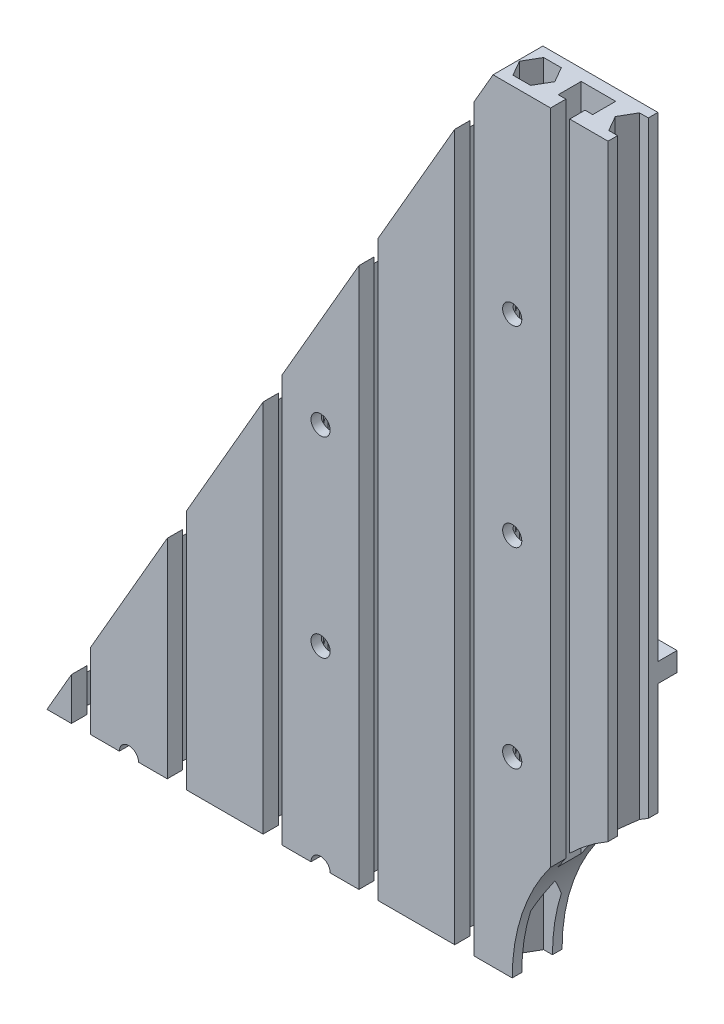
ISO-10303-21;
HEADER;
FILE_DESCRIPTION(('STEP AP214'),'2;1');
FILE_NAME('part.step','',(''),(''),'','','');
FILE_SCHEMA(('AUTOMOTIVE_DESIGN { 1 0 10303 214 1 1 1 1 }'));
ENDSEC;
DATA;
#1=APPLICATION_CONTEXT('core data for automotive mechanical design processes');
#2=APPLICATION_PROTOCOL_DEFINITION('international standard','automotive_design',2000,#1);
#3=PRODUCT_CONTEXT('',#1,'mechanical');
#4=PRODUCT('Part','Part','',(#3));
#5=PRODUCT_RELATED_PRODUCT_CATEGORY('part','',(#4));
#6=PRODUCT_DEFINITION_FORMATION('','',#4);
#7=PRODUCT_DEFINITION_CONTEXT('part definition',#1,'design');
#8=PRODUCT_DEFINITION('design','',#6,#7);
#9=PRODUCT_DEFINITION_SHAPE('','',#8);
#10=(LENGTH_UNIT() NAMED_UNIT(*) SI_UNIT(.MILLI.,.METRE.));
#11=(NAMED_UNIT(*) PLANE_ANGLE_UNIT() SI_UNIT($,.RADIAN.));
#12=(NAMED_UNIT(*) SI_UNIT($,.STERADIAN.) SOLID_ANGLE_UNIT());
#13=UNCERTAINTY_MEASURE_WITH_UNIT(LENGTH_MEASURE(1.E-05),#10,'distance_accuracy_value','');
#14=(GEOMETRIC_REPRESENTATION_CONTEXT(3) GLOBAL_UNCERTAINTY_ASSIGNED_CONTEXT((#13)) GLOBAL_UNIT_ASSIGNED_CONTEXT((#10,
#11,#12)) REPRESENTATION_CONTEXT('',''));
#15=CARTESIAN_POINT('',(0.,0.,0.));
#16=DIRECTION('',(0.,0.,1.));
#17=DIRECTION('',(1.,0.,0.));
#18=AXIS2_PLACEMENT_3D('',#15,#16,#17);
#19=CARTESIAN_POINT('',(-92.,-148.421931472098,3.));
#20=DIRECTION('',(-1.,0.,0.));
#21=DIRECTION('',(0.,0.,1.));
#22=AXIS2_PLACEMENT_3D('',#19,#20,#21);
#23=PLANE('',#22);
#24=DIRECTION('',(0.,1.,0.));
#25=VECTOR('',#24,1.);
#26=CARTESIAN_POINT('',(-92.,-148.421931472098,9.));
#27=LINE('',#26,#25);
#28=CARTESIAN_POINT('',(-92.,0.,9.));
#29=VERTEX_POINT('',#28);
#30=CARTESIAN_POINT('',(-92.,137.493188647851,9.));
#31=VERTEX_POINT('',#30);
#32=EDGE_CURVE('E1203',#29,#31,#27,.T.);
#33=ORIENTED_EDGE('',*,*,#32,.F.);
#34=DIRECTION('',(0.,0.,-1.));
#35=VECTOR('',#34,1.);
#36=CARTESIAN_POINT('',(-92.,0.,3.));
#37=LINE('',#36,#35);
#38=CARTESIAN_POINT('',(-92.,0.,3.));
#39=VERTEX_POINT('',#38);
#40=EDGE_CURVE('E1188',#29,#39,#37,.T.);
#41=ORIENTED_EDGE('',*,*,#40,.T.);
#42=DIRECTION('',(0.,1.,0.));
#43=VECTOR('',#42,1.);
#44=CARTESIAN_POINT('',(-92.,-148.421931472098,3.));
#45=LINE('',#44,#43);
#46=CARTESIAN_POINT('',(-92.,137.493188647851,3.));
#47=VERTEX_POINT('',#46);
#48=EDGE_CURVE('E1192',#39,#47,#45,.T.);
#49=ORIENTED_EDGE('',*,*,#48,.T.);
#50=DIRECTION('',(0.,0.,1.));
#51=VECTOR('',#50,1.);
#52=CARTESIAN_POINT('',(-92.,137.493188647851,3.));
#53=LINE('',#52,#51);
#54=EDGE_CURVE('E1181',#47,#31,#53,.T.);
#55=ORIENTED_EDGE('',*,*,#54,.T.);
#56=EDGE_LOOP('',(#33,#41,#49,#55));
#57=FACE_BOUND('',#56,.T.);
#58=ADVANCED_FACE('F51',(#57),#23,.F.);
#59=CARTESIAN_POINT('',(-83.,-148.421931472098,3.));
#60=DIRECTION('',(1.,0.,0.));
#61=DIRECTION('',(0.,0.,-1.));
#62=AXIS2_PLACEMENT_3D('',#59,#60,#61);
#63=PLANE('',#62);
#64=DIRECTION('',(0.,1.,0.));
#65=VECTOR('',#64,1.);
#66=CARTESIAN_POINT('',(-83.,-148.421931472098,3.));
#67=LINE('',#66,#65);
#68=CARTESIAN_POINT('',(-83.,0.,3.));
#69=VERTEX_POINT('',#68);
#70=CARTESIAN_POINT('',(-83.,153.08164591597,3.));
#71=VERTEX_POINT('',#70);
#72=EDGE_CURVE('E1186',#69,#71,#67,.T.);
#73=ORIENTED_EDGE('',*,*,#72,.F.);
#74=DIRECTION('',(0.,0.,1.));
#75=VECTOR('',#74,1.);
#76=CARTESIAN_POINT('',(-83.,0.,3.));
#77=LINE('',#76,#75);
#78=CARTESIAN_POINT('',(-83.,0.,9.));
#79=VERTEX_POINT('',#78);
#80=EDGE_CURVE('E1176',#69,#79,#77,.T.);
#81=ORIENTED_EDGE('',*,*,#80,.T.);
#82=DIRECTION('',(0.,1.,0.));
#83=VECTOR('',#82,1.);
#84=CARTESIAN_POINT('',(-83.,-148.421931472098,9.));
#85=LINE('',#84,#83);
#86=CARTESIAN_POINT('',(-83.,153.08164591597,9.));
#87=VERTEX_POINT('',#86);
#88=EDGE_CURVE('E1180',#79,#87,#85,.T.);
#89=ORIENTED_EDGE('',*,*,#88,.T.);
#90=DIRECTION('',(0.,0.,-1.));
#91=VECTOR('',#90,1.);
#92=CARTESIAN_POINT('',(-83.,153.08164591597,3.));
#93=LINE('',#92,#91);
#94=EDGE_CURVE('E1169',#87,#71,#93,.T.);
#95=ORIENTED_EDGE('',*,*,#94,.T.);
#96=EDGE_LOOP('',(#73,#81,#89,#95));
#97=FACE_BOUND('',#96,.T.);
#98=ADVANCED_FACE('F2484',(#97),#63,.F.);
#99=CARTESIAN_POINT('',(-85.,-148.421931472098,9.));
#100=DIRECTION('',(1.,0.,0.));
#101=DIRECTION('',(0.,0.,-1.));
#102=AXIS2_PLACEMENT_3D('',#99,#100,#101);
#103=PLANE('',#102);
#104=DIRECTION('',(0.,1.,0.));
#105=VECTOR('',#104,1.);
#106=CARTESIAN_POINT('',(-85.,-148.421931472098,9.));
#107=LINE('',#106,#105);
#108=CARTESIAN_POINT('',(-85.,0.,9.));
#109=VERTEX_POINT('',#108);
#110=CARTESIAN_POINT('',(-85.,149.617544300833,9.));
#111=VERTEX_POINT('',#110);
#112=EDGE_CURVE('E1174',#109,#111,#107,.T.);
#113=ORIENTED_EDGE('',*,*,#112,.F.);
#114=DIRECTION('',(0.,0.,1.));
#115=VECTOR('',#114,1.);
#116=CARTESIAN_POINT('',(-85.,0.,9.));
#117=LINE('',#116,#115);
#118=CARTESIAN_POINT('',(-85.,0.,13.));
#119=VERTEX_POINT('',#118);
#120=EDGE_CURVE('E1164',#109,#119,#117,.T.);
#121=ORIENTED_EDGE('',*,*,#120,.T.);
#122=DIRECTION('',(0.,1.,0.));
#123=VECTOR('',#122,1.);
#124=CARTESIAN_POINT('',(-85.,-148.421931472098,13.));
#125=LINE('',#124,#123);
#126=CARTESIAN_POINT('',(-85.,149.617544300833,13.));
#127=VERTEX_POINT('',#126);
#128=EDGE_CURVE('E1168',#119,#127,#125,.T.);
#129=ORIENTED_EDGE('',*,*,#128,.T.);
#130=DIRECTION('',(0.,0.,-1.));
#131=VECTOR('',#130,1.);
#132=CARTESIAN_POINT('',(-85.,149.617544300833,8.99999999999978));
#133=LINE('',#132,#131);
#134=EDGE_CURVE('E1198',#127,#111,#133,.T.);
#135=ORIENTED_EDGE('',*,*,#134,.T.);
#136=EDGE_LOOP('',(#113,#121,#129,#135));
#137=FACE_BOUND('',#136,.T.);
#138=ADVANCED_FACE('F2477',(#137),#103,.F.);
#139=CARTESIAN_POINT('',(-90.,-148.421931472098,9.));
#140=DIRECTION('',(-1.,0.,0.));
#141=DIRECTION('',(0.,0.,1.));
#142=AXIS2_PLACEMENT_3D('',#139,#140,#141);
#143=PLANE('',#142);
#144=DIRECTION('',(0.,1.,0.));
#145=VECTOR('',#144,1.);
#146=CARTESIAN_POINT('',(-90.,-148.421931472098,13.));
#147=LINE('',#146,#145);
#148=CARTESIAN_POINT('',(-90.,0.,13.));
#149=VERTEX_POINT('',#148);
#150=CARTESIAN_POINT('',(-90.,140.957290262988,13.));
#151=VERTEX_POINT('',#150);
#152=EDGE_CURVE('E2225',#149,#151,#147,.T.);
#153=ORIENTED_EDGE('',*,*,#152,.F.);
#154=DIRECTION('',(0.,0.,-1.));
#155=VECTOR('',#154,1.);
#156=CARTESIAN_POINT('',(-90.,0.,9.));
#157=LINE('',#156,#155);
#158=CARTESIAN_POINT('',(-90.,0.,9.));
#159=VERTEX_POINT('',#158);
#160=EDGE_CURVE('E1193',#149,#159,#157,.T.);
#161=ORIENTED_EDGE('',*,*,#160,.T.);
#162=DIRECTION('',(0.,1.,0.));
#163=VECTOR('',#162,1.);
#164=CARTESIAN_POINT('',(-90.,-148.421931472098,9.));
#165=LINE('',#164,#163);
#166=CARTESIAN_POINT('',(-90.,140.957290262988,9.));
#167=VERTEX_POINT('',#166);
#168=EDGE_CURVE('E1197',#159,#167,#165,.T.);
#169=ORIENTED_EDGE('',*,*,#168,.T.);
#170=DIRECTION('',(0.,0.,1.));
#171=VECTOR('',#170,1.);
#172=CARTESIAN_POINT('',(-90.,140.957290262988,9.));
#173=LINE('',#172,#171);
#174=EDGE_CURVE('E1527',#167,#151,#173,.T.);
#175=ORIENTED_EDGE('',*,*,#174,.T.);
#176=EDGE_LOOP('',(#153,#161,#169,#175));
#177=FACE_BOUND('',#176,.T.);
#178=ADVANCED_FACE('F2499',(#177),#143,.F.);
#179=CARTESIAN_POINT('',(0.,0.,0.));
#180=DIRECTION('',(0.,0.,-1.));
#181=DIRECTION('',(-1.,0.,0.));
#182=AXIS2_PLACEMENT_3D('',#179,#180,#181);
#183=PLANE('',#182);
#184=DIRECTION('',(0.,1.,0.));
#185=VECTOR('',#184,1.);
#186=CARTESIAN_POINT('',(-25.,0.,0.));
#187=LINE('',#186,#185);
#188=CARTESIAN_POINT('',(-25.,43.301270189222,0.));
#189=VERTEX_POINT('',#188);
#190=CARTESIAN_POINT('',(-25.,72.5,0.));
#191=VERTEX_POINT('',#190);
#192=EDGE_CURVE('E1498',#189,#191,#187,.T.);
#193=ORIENTED_EDGE('',*,*,#192,.F.);
#194=CARTESIAN_POINT('',(0.,0.,0.));
#195=DIRECTION('',(0.,0.,-1.));
#196=DIRECTION('',(-1.,0.,0.));
#197=AXIS2_PLACEMENT_3D('',#194,#195,#196);
#198=CIRCLE('',#197,50.);
#199=CARTESIAN_POINT('',(-50.,0.,0.));
#200=VERTEX_POINT('',#199);
#201=EDGE_CURVE('E953',#200,#189,#198,.T.);
#202=ORIENTED_EDGE('',*,*,#201,.F.);
#203=DIRECTION('',(1.,0.,0.));
#204=VECTOR('',#203,1.);
#205=CARTESIAN_POINT('',(0.,0.,0.));
#206=LINE('',#205,#204);
#207=CARTESIAN_POINT('',(-95.5,0.,0.));
#208=VERTEX_POINT('',#207);
#209=EDGE_CURVE('E1402',#208,#200,#206,.T.);
#210=ORIENTED_EDGE('',*,*,#209,.F.);
#211=CARTESIAN_POINT('',(-100.,0.,0.));
#212=DIRECTION('',(0.,0.,-1.));
#213=DIRECTION('',(-1.,0.,0.));
#214=AXIS2_PLACEMENT_3D('',#211,#212,#213);
#215=CIRCLE('',#214,4.5);
#216=CARTESIAN_POINT('',(-104.5,0.,0.));
#217=VERTEX_POINT('',#216);
#218=EDGE_CURVE('E1337',#217,#208,#215,.T.);
#219=ORIENTED_EDGE('',*,*,#218,.F.);
#220=CARTESIAN_POINT('',(-145.5,0.,0.));
#221=VERTEX_POINT('',#220);
#222=EDGE_CURVE('E1396',#221,#217,#206,.T.);
#223=ORIENTED_EDGE('',*,*,#222,.F.);
#224=CARTESIAN_POINT('',(-150.,0.,0.));
#225=DIRECTION('',(0.,0.,-1.));
#226=DIRECTION('',(-1.,0.,0.));
#227=AXIS2_PLACEMENT_3D('',#224,#225,#226);
#228=CIRCLE('',#227,4.5);
#229=CARTESIAN_POINT('',(-154.5,0.,0.));
#230=VERTEX_POINT('',#229);
#231=EDGE_CURVE('E1395',#230,#221,#228,.T.);
#232=ORIENTED_EDGE('',*,*,#231,.F.);
#233=CARTESIAN_POINT('',(-171.381729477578,0.,0.));
#234=VERTEX_POINT('',#233);
#235=EDGE_CURVE('E1401',#234,#230,#206,.T.);
#236=ORIENTED_EDGE('',*,*,#235,.F.);
#237=DIRECTION('',(-0.500000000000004,-0.866025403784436,0.));
#238=VECTOR('',#237,1.);
#239=CARTESIAN_POINT('',(-202.072594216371,-53.1581370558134,0.));
#240=LINE('',#239,#238);
#241=CARTESIAN_POINT('',(-54.9999999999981,201.579068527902,0.));
#242=VERTEX_POINT('',#241);
#243=EDGE_CURVE('E1844',#242,#234,#240,.T.);
#244=ORIENTED_EDGE('',*,*,#243,.F.);
#245=DIRECTION('',(-1.,0.,0.));
#246=VECTOR('',#245,1.);
#247=CARTESIAN_POINT('',(-54.9999999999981,201.579068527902,0.));
#248=LINE('',#247,#246);
#249=CARTESIAN_POINT('',(-25.,201.579068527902,0.));
#250=VERTEX_POINT('',#249);
#251=EDGE_CURVE('E924',#250,#242,#248,.T.);
#252=ORIENTED_EDGE('',*,*,#251,.F.);
#253=CARTESIAN_POINT('',(-25.,77.5,0.));
#254=VERTEX_POINT('',#253);
#255=EDGE_CURVE('E62',#254,#250,#187,.T.);
#256=ORIENTED_EDGE('',*,*,#255,.F.);
#257=DIRECTION('',(-1.,0.,0.));
#258=VECTOR('',#257,1.);
#259=CARTESIAN_POINT('',(125.,77.5,0.));
#260=LINE('',#259,#258);
#261=CARTESIAN_POINT('',(-125.,77.5,0.));
#262=VERTEX_POINT('',#261);
#263=EDGE_CURVE('E1520',#254,#262,#260,.T.);
#264=ORIENTED_EDGE('',*,*,#263,.T.);
#265=DIRECTION('',(0.,-1.,0.));
#266=VECTOR('',#265,1.);
#267=CARTESIAN_POINT('',(-125.,77.5,0.));
#268=LINE('',#267,#266);
#269=CARTESIAN_POINT('',(-125.,72.5,0.));
#270=VERTEX_POINT('',#269);
#271=EDGE_CURVE('E1511',#262,#270,#268,.T.);
#272=ORIENTED_EDGE('',*,*,#271,.T.);
#273=DIRECTION('',(-1.,0.,0.));
#274=VECTOR('',#273,1.);
#275=CARTESIAN_POINT('',(125.,72.5,0.));
#276=LINE('',#275,#274);
#277=EDGE_CURVE('E1494',#191,#270,#276,.T.);
#278=ORIENTED_EDGE('',*,*,#277,.F.);
#279=EDGE_LOOP('',(#193,#202,#210,#219,#223,#232,#236,#244,#252,#256,#264,#272,#278));
#280=FACE_BOUND('',#279,.T.);
#281=CARTESIAN_POINT('',(-50.,150.,0.));
#282=DIRECTION('',(0.,0.,-1.));
#283=DIRECTION('',(-1.,0.,0.));
#284=AXIS2_PLACEMENT_3D('',#281,#282,#283);
#285=CIRCLE('',#284,4.5);
#286=CARTESIAN_POINT('',(-54.5,150.,0.));
#287=VERTEX_POINT('',#286);
#288=EDGE_CURVE('E1495',#287,#287,#285,.T.);
#289=ORIENTED_EDGE('',*,*,#288,.F.);
#290=EDGE_LOOP('',(#289));
#291=FACE_BOUND('',#290,.T.);
#292=CARTESIAN_POINT('',(-100.,100.,0.));
#293=DIRECTION('',(0.,0.,-1.));
#294=DIRECTION('',(-1.,0.,0.));
#295=AXIS2_PLACEMENT_3D('',#292,#293,#294);
#296=CIRCLE('',#295,4.5);
#297=CARTESIAN_POINT('',(-104.5,100.,0.));
#298=VERTEX_POINT('',#297);
#299=EDGE_CURVE('E1839',#298,#298,#296,.T.);
#300=ORIENTED_EDGE('',*,*,#299,.F.);
#301=EDGE_LOOP('',(#300));
#302=FACE_BOUND('',#301,.T.);
#303=CARTESIAN_POINT('',(-50.,100.,0.));
#304=DIRECTION('',(0.,0.,-1.));
#305=DIRECTION('',(-1.,0.,0.));
#306=AXIS2_PLACEMENT_3D('',#303,#304,#305);
#307=CIRCLE('',#306,4.5);
#308=CARTESIAN_POINT('',(-54.5,100.,0.));
#309=VERTEX_POINT('',#308);
#310=EDGE_CURVE('E1697',#309,#309,#307,.T.);
#311=ORIENTED_EDGE('',*,*,#310,.F.);
#312=EDGE_LOOP('',(#311));
#313=FACE_BOUND('',#312,.T.);
#314=CARTESIAN_POINT('',(-100.,50.,0.));
#315=DIRECTION('',(0.,0.,-1.));
#316=DIRECTION('',(-1.,0.,0.));
#317=AXIS2_PLACEMENT_3D('',#314,#315,#316);
#318=CIRCLE('',#317,4.5);
#319=CARTESIAN_POINT('',(-104.5,50.,0.));
#320=VERTEX_POINT('',#319);
#321=EDGE_CURVE('E1835',#320,#320,#318,.T.);
#322=ORIENTED_EDGE('',*,*,#321,.F.);
#323=EDGE_LOOP('',(#322));
#324=FACE_BOUND('',#323,.T.);
#325=CARTESIAN_POINT('',(-50.,50.,0.));
#326=DIRECTION('',(0.,0.,-1.));
#327=DIRECTION('',(-1.,0.,0.));
#328=AXIS2_PLACEMENT_3D('',#325,#326,#327);
#329=CIRCLE('',#328,4.5);
#330=CARTESIAN_POINT('',(-54.5,50.,0.));
#331=VERTEX_POINT('',#330);
#332=EDGE_CURVE('E1693',#331,#331,#329,.T.);
#333=ORIENTED_EDGE('',*,*,#332,.F.);
#334=EDGE_LOOP('',(#333));
#335=FACE_BOUND('',#334,.T.);
#336=ADVANCED_FACE('F2418',(#280,#291,#302,#313,#324,#335),#183,.T.);
#337=CARTESIAN_POINT('',(0.,0.,13.));
#338=DIRECTION('',(0.,0.,-1.));
#339=DIRECTION('',(-1.,0.,0.));
#340=AXIS2_PLACEMENT_3D('',#337,#338,#339);
#341=PLANE('',#340);
#342=CARTESIAN_POINT('',(0.,0.,13.));
#343=DIRECTION('',(0.,0.,1.));
#344=DIRECTION('',(1.,0.,0.));
#345=AXIS2_PLACEMENT_3D('',#342,#343,#344);
#346=CIRCLE('',#345,50.);
#347=CARTESIAN_POINT('',(-25.,43.301270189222,13.));
#348=VERTEX_POINT('',#347);
#349=CARTESIAN_POINT('',(-35.,35.7071421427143,13.));
#350=VERTEX_POINT('',#349);
#351=EDGE_CURVE('E957',#348,#350,#346,.T.);
#352=ORIENTED_EDGE('',*,*,#351,.F.);
#353=DIRECTION('',(0.,1.,0.));
#354=VECTOR('',#353,1.);
#355=CARTESIAN_POINT('',(-25.,201.579068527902,13.));
#356=LINE('',#355,#354);
#357=CARTESIAN_POINT('',(-25.,201.579068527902,13.));
#358=VERTEX_POINT('',#357);
#359=EDGE_CURVE('E89',#348,#358,#356,.T.);
#360=ORIENTED_EDGE('',*,*,#359,.T.);
#361=DIRECTION('',(-1.,0.,0.));
#362=VECTOR('',#361,1.);
#363=CARTESIAN_POINT('',(-54.9999999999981,201.579068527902,13.));
#364=LINE('',#363,#362);
#365=CARTESIAN_POINT('',(-35.,201.579068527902,13.));
#366=VERTEX_POINT('',#365);
#367=EDGE_CURVE('E1510',#358,#366,#364,.T.);
#368=ORIENTED_EDGE('',*,*,#367,.T.);
#369=DIRECTION('',(0.,1.,0.));
#370=VECTOR('',#369,1.);
#371=CARTESIAN_POINT('',(-35.,-148.421931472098,13.));
#372=LINE('',#371,#370);
#373=EDGE_CURVE('E963',#350,#366,#372,.T.);
#374=ORIENTED_EDGE('',*,*,#373,.F.);
#375=EDGE_LOOP('',(#352,#360,#368,#374));
#376=FACE_BOUND('',#375,.T.);
#377=ADVANCED_FACE('F2968',(#376),#341,.F.);
#378=CARTESIAN_POINT('',(-50.,150.,13.));
#379=DIRECTION('',(0.,0.,-1.));
#380=DIRECTION('',(-1.,0.,0.));
#381=AXIS2_PLACEMENT_3D('',#378,#379,#380);
#382=CIRCLE('',#381,2.5);
#383=CARTESIAN_POINT('',(-52.5,150.,13.));
#384=VERTEX_POINT('',#383);
#385=EDGE_CURVE('E1516',#384,#384,#382,.T.);
#386=ORIENTED_EDGE('',*,*,#385,.T.);
#387=EDGE_LOOP('',(#386));
#388=FACE_BOUND('',#387,.T.);
#389=CARTESIAN_POINT('',(-50.,100.,13.));
#390=DIRECTION('',(0.,0.,-1.));
#391=DIRECTION('',(-1.,0.,0.));
#392=AXIS2_PLACEMENT_3D('',#389,#390,#391);
#393=CIRCLE('',#392,2.5);
#394=CARTESIAN_POINT('',(-52.5,100.,13.));
#395=VERTEX_POINT('',#394);
#396=EDGE_CURVE('E2356',#395,#395,#393,.T.);
#397=ORIENTED_EDGE('',*,*,#396,.T.);
#398=EDGE_LOOP('',(#397));
#399=FACE_BOUND('',#398,.T.);
#400=CARTESIAN_POINT('',(-50.,50.,13.));
#401=DIRECTION('',(0.,0.,-1.));
#402=DIRECTION('',(-1.,0.,0.));
#403=AXIS2_PLACEMENT_3D('',#400,#401,#402);
#404=CIRCLE('',#403,2.5);
#405=CARTESIAN_POINT('',(-52.5,50.,13.));
#406=VERTEX_POINT('',#405);
#407=EDGE_CURVE('E2301',#406,#406,#404,.T.);
#408=ORIENTED_EDGE('',*,*,#407,.T.);
#409=EDGE_LOOP('',(#408));
#410=FACE_BOUND('',#409,.T.);
#411=DIRECTION('',(0.,1.,0.));
#412=VECTOR('',#411,1.);
#413=CARTESIAN_POINT('',(-60.,-148.421931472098,13.));
#414=LINE('',#413,#412);
#415=CARTESIAN_POINT('',(-60.,0.,13.));
#416=VERTEX_POINT('',#415);
#417=CARTESIAN_POINT('',(-60.,192.918814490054,13.));
#418=VERTEX_POINT('',#417);
#419=EDGE_CURVE('E1209',#416,#418,#414,.T.);
#420=ORIENTED_EDGE('',*,*,#419,.F.);
#421=DIRECTION('',(-1.,0.,0.));
#422=VECTOR('',#421,1.);
#423=CARTESIAN_POINT('',(-50.,0.,13.));
#424=LINE('',#423,#422);
#425=CARTESIAN_POINT('',(-50.,0.,13.));
#426=VERTEX_POINT('',#425);
#427=EDGE_CURVE('E1474',#426,#416,#424,.T.);
#428=ORIENTED_EDGE('',*,*,#427,.F.);
#429=CARTESIAN_POINT('',(-40.,30.,13.));
#430=VERTEX_POINT('',#429);
#431=EDGE_CURVE('E1489',#430,#426,#346,.T.);
#432=ORIENTED_EDGE('',*,*,#431,.F.);
#433=DIRECTION('',(0.,1.,0.));
#434=VECTOR('',#433,1.);
#435=CARTESIAN_POINT('',(-40.,-148.421931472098,13.));
#436=LINE('',#435,#434);
#437=CARTESIAN_POINT('',(-40.,201.579068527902,13.));
#438=VERTEX_POINT('',#437);
#439=EDGE_CURVE('E2298',#430,#438,#436,.T.);
#440=ORIENTED_EDGE('',*,*,#439,.T.);
#441=CARTESIAN_POINT('',(-54.9999999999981,201.579068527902,13.));
#442=VERTEX_POINT('',#441);
#443=EDGE_CURVE('E1518',#438,#442,#364,.T.);
#444=ORIENTED_EDGE('',*,*,#443,.T.);
#445=DIRECTION('',(-0.500000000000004,-0.866025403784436,0.));
#446=VECTOR('',#445,1.);
#447=CARTESIAN_POINT('',(-202.072594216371,-53.1581370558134,13.));
#448=LINE('',#447,#446);
#449=EDGE_CURVE('E2096',#442,#418,#448,.T.);
#450=ORIENTED_EDGE('',*,*,#449,.T.);
#451=EDGE_LOOP('',(#420,#428,#432,#440,#444,#450));
#452=FACE_BOUND('',#451,.T.);
#453=ADVANCED_FACE('F2987',(#388,#399,#410,#452),#341,.F.);
#454=ORIENTED_EDGE('',*,*,#128,.F.);
#455=CARTESIAN_POINT('',(-65.,0.,13.));
#456=VERTEX_POINT('',#455);
#457=EDGE_CURVE('E1485',#456,#119,#424,.T.);
#458=ORIENTED_EDGE('',*,*,#457,.F.);
#459=DIRECTION('',(0.,1.,0.));
#460=VECTOR('',#459,1.);
#461=CARTESIAN_POINT('',(-65.,-148.421931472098,13.));
#462=LINE('',#461,#460);
#463=CARTESIAN_POINT('',(-65.,184.25856045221,13.));
#464=VERTEX_POINT('',#463);
#465=EDGE_CURVE('E2100',#456,#464,#462,.T.);
#466=ORIENTED_EDGE('',*,*,#465,.T.);
#467=EDGE_CURVE('E2101',#464,#127,#448,.T.);
#468=ORIENTED_EDGE('',*,*,#467,.T.);
#469=EDGE_LOOP('',(#454,#458,#466,#468));
#470=FACE_BOUND('',#469,.T.);
#471=ADVANCED_FACE('F2467',(#470),#341,.F.);
#472=CARTESIAN_POINT('',(-100.,100.,13.));
#473=DIRECTION('',(0.,0.,-1.));
#474=DIRECTION('',(-1.,0.,0.));
#475=AXIS2_PLACEMENT_3D('',#472,#473,#474);
#476=CIRCLE('',#475,2.5);
#477=CARTESIAN_POINT('',(-102.5,100.,13.));
#478=VERTEX_POINT('',#477);
#479=EDGE_CURVE('E2366',#478,#478,#476,.T.);
#480=ORIENTED_EDGE('',*,*,#479,.T.);
#481=EDGE_LOOP('',(#480));
#482=FACE_BOUND('',#481,.T.);
#483=CARTESIAN_POINT('',(-100.,50.,13.));
#484=DIRECTION('',(0.,0.,-1.));
#485=DIRECTION('',(-1.,0.,0.));
#486=AXIS2_PLACEMENT_3D('',#483,#484,#485);
#487=CIRCLE('',#486,2.5);
#488=CARTESIAN_POINT('',(-102.5,50.,13.));
#489=VERTEX_POINT('',#488);
#490=EDGE_CURVE('E2337',#489,#489,#487,.T.);
#491=ORIENTED_EDGE('',*,*,#490,.T.);
#492=EDGE_LOOP('',(#491));
#493=FACE_BOUND('',#492,.T.);
#494=DIRECTION('',(0.,1.,0.));
#495=VECTOR('',#494,1.);
#496=CARTESIAN_POINT('',(-110.,-148.421931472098,13.));
#497=LINE('',#496,#495);
#498=CARTESIAN_POINT('',(-110.,0.,13.));
#499=VERTEX_POINT('',#498);
#500=CARTESIAN_POINT('',(-110.,106.316274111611,13.));
#501=VERTEX_POINT('',#500);
#502=EDGE_CURVE('E1126',#499,#501,#497,.T.);
#503=ORIENTED_EDGE('',*,*,#502,.F.);
#504=CARTESIAN_POINT('',(-102.5,0.,13.));
#505=VERTEX_POINT('',#504);
#506=EDGE_CURVE('E1399',#505,#499,#424,.T.);
#507=ORIENTED_EDGE('',*,*,#506,.F.);
#508=CARTESIAN_POINT('',(-100.,0.,13.));
#509=DIRECTION('',(0.,0.,-1.));
#510=DIRECTION('',(-1.,0.,0.));
#511=AXIS2_PLACEMENT_3D('',#508,#509,#510);
#512=CIRCLE('',#511,2.5);
#513=CARTESIAN_POINT('',(-97.5,0.,13.));
#514=VERTEX_POINT('',#513);
#515=EDGE_CURVE('E2228',#505,#514,#512,.T.);
#516=ORIENTED_EDGE('',*,*,#515,.T.);
#517=EDGE_CURVE('E2428',#149,#514,#424,.T.);
#518=ORIENTED_EDGE('',*,*,#517,.F.);
#519=ORIENTED_EDGE('',*,*,#152,.T.);
#520=EDGE_CURVE('E2189',#151,#501,#448,.T.);
#521=ORIENTED_EDGE('',*,*,#520,.T.);
#522=EDGE_LOOP('',(#503,#507,#516,#518,#519,#521));
#523=FACE_BOUND('',#522,.T.);
#524=ADVANCED_FACE('F2501',(#482,#493,#523),#341,.F.);
#525=DIRECTION('',(0.,1.,0.));
#526=VECTOR('',#525,1.);
#527=CARTESIAN_POINT('',(-135.,-148.421931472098,13.));
#528=LINE('',#527,#526);
#529=CARTESIAN_POINT('',(-135.,0.,13.));
#530=VERTEX_POINT('',#529);
#531=CARTESIAN_POINT('',(-135.,63.0150039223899,13.));
#532=VERTEX_POINT('',#531);
#533=EDGE_CURVE('E1084',#530,#532,#528,.T.);
#534=ORIENTED_EDGE('',*,*,#533,.F.);
#535=CARTESIAN_POINT('',(-115.,0.,13.));
#536=VERTEX_POINT('',#535);
#537=EDGE_CURVE('E958',#536,#530,#424,.T.);
#538=ORIENTED_EDGE('',*,*,#537,.F.);
#539=DIRECTION('',(0.,1.,0.));
#540=VECTOR('',#539,1.);
#541=CARTESIAN_POINT('',(-115.,-148.421931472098,13.));
#542=LINE('',#541,#540);
#543=CARTESIAN_POINT('',(-115.,97.6560200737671,13.));
#544=VERTEX_POINT('',#543);
#545=EDGE_CURVE('E2185',#536,#544,#542,.T.);
#546=ORIENTED_EDGE('',*,*,#545,.T.);
#547=EDGE_CURVE('E2188',#544,#532,#448,.T.);
#548=ORIENTED_EDGE('',*,*,#547,.T.);
#549=EDGE_LOOP('',(#534,#538,#546,#548));
#550=FACE_BOUND('',#549,.T.);
#551=ADVANCED_FACE('F3197',(#550),#341,.F.);
#552=DIRECTION('',(0.,1.,0.));
#553=VECTOR('',#552,1.);
#554=CARTESIAN_POINT('',(-160.,-148.421931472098,13.));
#555=LINE('',#554,#553);
#556=CARTESIAN_POINT('',(-160.,0.,13.));
#557=VERTEX_POINT('',#556);
#558=CARTESIAN_POINT('',(-160.,19.7137337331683,13.));
#559=VERTEX_POINT('',#558);
#560=EDGE_CURVE('E1042',#557,#559,#555,.T.);
#561=ORIENTED_EDGE('',*,*,#560,.F.);
#562=CARTESIAN_POINT('',(-152.5,0.,13.));
#563=VERTEX_POINT('',#562);
#564=EDGE_CURVE('E2431',#563,#557,#424,.T.);
#565=ORIENTED_EDGE('',*,*,#564,.F.);
#566=CARTESIAN_POINT('',(-150.,0.,13.));
#567=DIRECTION('',(0.,0.,-1.));
#568=DIRECTION('',(-1.,0.,0.));
#569=AXIS2_PLACEMENT_3D('',#566,#567,#568);
#570=CIRCLE('',#569,2.5);
#571=CARTESIAN_POINT('',(-147.5,0.,13.));
#572=VERTEX_POINT('',#571);
#573=EDGE_CURVE('E2149',#563,#572,#570,.T.);
#574=ORIENTED_EDGE('',*,*,#573,.T.);
#575=CARTESIAN_POINT('',(-140.,0.,13.));
#576=VERTEX_POINT('',#575);
#577=EDGE_CURVE('E1400',#576,#572,#424,.T.);
#578=ORIENTED_EDGE('',*,*,#577,.F.);
#579=DIRECTION('',(0.,1.,0.));
#580=VECTOR('',#579,1.);
#581=CARTESIAN_POINT('',(-140.,-148.421931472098,13.));
#582=LINE('',#581,#580);
#583=CARTESIAN_POINT('',(-140.,54.3547498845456,13.));
#584=VERTEX_POINT('',#583);
#585=EDGE_CURVE('E2146',#576,#584,#582,.T.);
#586=ORIENTED_EDGE('',*,*,#585,.T.);
#587=EDGE_CURVE('E1905',#584,#559,#448,.T.);
#588=ORIENTED_EDGE('',*,*,#587,.T.);
#589=EDGE_LOOP('',(#561,#565,#574,#578,#586,#588));
#590=FACE_BOUND('',#589,.T.);
#591=ADVANCED_FACE('F2601',(#590),#341,.F.);
#592=CARTESIAN_POINT('',(-202.072594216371,-53.1581370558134,13.));
#593=DIRECTION('',(0.866025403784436,-0.500000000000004,0.));
#594=DIRECTION('',(0.500000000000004,0.866025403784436,0.));
#595=AXIS2_PLACEMENT_3D('',#592,#593,#594);
#596=PLANE('',#595);
#597=DIRECTION('',(-0.377964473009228,-0.654653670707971,-0.654653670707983));
#598=VECTOR('',#597,1.);
#599=CARTESIAN_POINT('',(-147.984064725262,40.5259441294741,-111.912108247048));
#600=LINE('',#599,#598);
#601=CARTESIAN_POINT('',(-77.3094010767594,162.93805237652,10.5));
#602=VERTEX_POINT('',#601);
#603=CARTESIAN_POINT('',(-79.6188021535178,158.93805237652,6.5));
#604=VERTEX_POINT('',#603);
#605=EDGE_CURVE('E1901',#602,#604,#600,.T.);
#606=ORIENTED_EDGE('',*,*,#605,.T.);
#607=DIRECTION('',(0.377964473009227,0.65465367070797,-0.654653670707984));
#608=VECTOR('',#607,1.);
#609=CARTESIAN_POINT('',(-151.200730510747,34.9545155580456,130.483536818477));
#610=LINE('',#609,#608);
#611=CARTESIAN_POINT('',(-77.3094010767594,162.93805237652,2.5));
#612=VERTEX_POINT('',#611);
#613=EDGE_CURVE('E1897',#604,#612,#610,.T.);
#614=ORIENTED_EDGE('',*,*,#613,.T.);
#615=DIRECTION('',(0.500000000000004,0.866025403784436,0.));
#616=VECTOR('',#615,1.);
#617=CARTESIAN_POINT('',(-202.072594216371,-53.1581370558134,2.5));
#618=LINE('',#617,#616);
#619=CARTESIAN_POINT('',(-72.6905989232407,170.938052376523,2.5));
#620=VERTEX_POINT('',#619);
#621=EDGE_CURVE('E1892',#612,#620,#618,.T.);
#622=ORIENTED_EDGE('',*,*,#621,.T.);
#623=DIRECTION('',(0.377964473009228,0.654653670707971,0.654653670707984));
#624=VECTOR('',#623,1.);
#625=CARTESIAN_POINT('',(-144.025091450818,47.383086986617,-121.054965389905));
#626=LINE('',#625,#624);
#627=CARTESIAN_POINT('',(-70.3811978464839,174.93805237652,6.49999999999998));
#628=VERTEX_POINT('',#627);
#629=EDGE_CURVE('E1896',#620,#628,#626,.T.);
#630=ORIENTED_EDGE('',*,*,#629,.T.);
#631=DIRECTION('',(-0.377964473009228,-0.654653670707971,0.654653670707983));
#632=VECTOR('',#631,1.);
#633=CARTESIAN_POINT('',(-147.241757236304,41.8116584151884,139.626393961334));
#634=LINE('',#633,#632);
#635=CARTESIAN_POINT('',(-72.6905989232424,170.93805237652,10.5));
#636=VERTEX_POINT('',#635);
#637=EDGE_CURVE('E1909',#628,#636,#634,.T.);
#638=ORIENTED_EDGE('',*,*,#637,.T.);
#639=DIRECTION('',(-0.500000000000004,-0.866025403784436,0.));
#640=VECTOR('',#639,1.);
#641=CARTESIAN_POINT('',(-202.072594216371,-53.1581370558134,10.5));
#642=LINE('',#641,#640);
#643=EDGE_CURVE('E1746',#636,#602,#642,.T.);
#644=ORIENTED_EDGE('',*,*,#643,.T.);
#645=EDGE_LOOP('',(#606,#614,#622,#630,#638,#644));
#646=FACE_BOUND('',#645,.T.);
#647=DIRECTION('',(-0.377964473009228,-0.654653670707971,-0.654653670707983));
#648=VECTOR('',#647,1.);
#649=CARTESIAN_POINT('',(-158.698350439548,21.9682569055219,-87.168525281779));
#650=LINE('',#649,#648);
#651=CARTESIAN_POINT('',(-102.309401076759,119.636782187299,10.5));
#652=VERTEX_POINT('',#651);
#653=CARTESIAN_POINT('',(-104.618802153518,115.636782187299,6.50000000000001));
#654=VERTEX_POINT('',#653);
#655=EDGE_CURVE('E1728',#652,#654,#650,.T.);
#656=ORIENTED_EDGE('',*,*,#655,.T.);
#657=DIRECTION('',(0.377964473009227,0.65465367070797,-0.654653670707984));
#658=VECTOR('',#657,1.);
#659=CARTESIAN_POINT('',(-161.915016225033,16.3968283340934,105.739953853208));
#660=LINE('',#659,#658);
#661=CARTESIAN_POINT('',(-102.309401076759,119.636782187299,2.5));
#662=VERTEX_POINT('',#661);
#663=EDGE_CURVE('E1723',#654,#662,#660,.T.);
#664=ORIENTED_EDGE('',*,*,#663,.T.);
#665=DIRECTION('',(0.500000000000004,0.866025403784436,0.));
#666=VECTOR('',#665,1.);
#667=CARTESIAN_POINT('',(-202.072594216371,-53.1581370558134,2.5));
#668=LINE('',#667,#666);
#669=CARTESIAN_POINT('',(-97.6905989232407,127.636782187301,2.5));
#670=VERTEX_POINT('',#669);
#671=EDGE_CURVE('E1727',#662,#670,#668,.T.);
#672=ORIENTED_EDGE('',*,*,#671,.T.);
#673=DIRECTION('',(0.377964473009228,0.654653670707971,0.654653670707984));
#674=VECTOR('',#673,1.);
#675=CARTESIAN_POINT('',(-154.739377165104,28.8253997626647,-96.3113824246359));
#676=LINE('',#675,#674);
#677=CARTESIAN_POINT('',(-95.3811978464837,131.636782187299,6.5));
#678=VERTEX_POINT('',#677);
#679=EDGE_CURVE('E1781',#670,#678,#676,.T.);
#680=ORIENTED_EDGE('',*,*,#679,.T.);
#681=DIRECTION('',(-0.377964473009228,-0.654653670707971,0.654653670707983));
#682=VECTOR('',#681,1.);
#683=CARTESIAN_POINT('',(-157.956042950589,23.2539711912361,114.882810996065));
#684=LINE('',#683,#682);
#685=CARTESIAN_POINT('',(-97.6905989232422,127.636782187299,10.5));
#686=VERTEX_POINT('',#685);
#687=EDGE_CURVE('E1704',#678,#686,#684,.T.);
#688=ORIENTED_EDGE('',*,*,#687,.T.);
#689=DIRECTION('',(-0.500000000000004,-0.866025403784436,0.));
#690=VECTOR('',#689,1.);
#691=CARTESIAN_POINT('',(-202.072594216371,-53.1581370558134,10.5));
#692=LINE('',#691,#690);
#693=EDGE_CURVE('E1546',#686,#652,#692,.T.);
#694=ORIENTED_EDGE('',*,*,#693,.T.);
#695=EDGE_LOOP('',(#656,#664,#672,#680,#688,#694));
#696=FACE_BOUND('',#695,.T.);
#697=DIRECTION('',(-0.377964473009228,-0.654653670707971,-0.654653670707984));
#698=VECTOR('',#697,1.);
#699=CARTESIAN_POINT('',(-169.412636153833,3.41056968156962,-62.4249423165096));
#700=LINE('',#699,#698);
#701=CARTESIAN_POINT('',(-127.309401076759,76.3355119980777,10.5));
#702=VERTEX_POINT('',#701);
#703=CARTESIAN_POINT('',(-129.618802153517,72.335511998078,6.50000000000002));
#704=VERTEX_POINT('',#703);
#705=EDGE_CURVE('E1542',#702,#704,#700,.T.);
#706=ORIENTED_EDGE('',*,*,#705,.T.);
#707=DIRECTION('',(0.377964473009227,0.65465367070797,-0.654653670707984));
#708=VECTOR('',#707,1.);
#709=CARTESIAN_POINT('',(-172.629301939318,-2.16085888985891,80.9963708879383));
#710=LINE('',#709,#708);
#711=CARTESIAN_POINT('',(-127.309401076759,76.3355119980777,2.5));
#712=VERTEX_POINT('',#711);
#713=EDGE_CURVE('E1537',#704,#712,#710,.T.);
#714=ORIENTED_EDGE('',*,*,#713,.T.);
#715=DIRECTION('',(0.500000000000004,0.866025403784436,0.));
#716=VECTOR('',#715,1.);
#717=CARTESIAN_POINT('',(-202.072594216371,-53.1581370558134,2.5));
#718=LINE('',#717,#716);
#719=CARTESIAN_POINT('',(-122.690598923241,84.3355119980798,2.5));
#720=VERTEX_POINT('',#719);
#721=EDGE_CURVE('E1541',#712,#720,#718,.T.);
#722=ORIENTED_EDGE('',*,*,#721,.T.);
#723=DIRECTION('',(0.377964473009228,0.654653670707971,0.654653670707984));
#724=VECTOR('',#723,1.);
#725=CARTESIAN_POINT('',(-165.45366287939,10.2677125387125,-71.5677994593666));
#726=LINE('',#725,#724);
#727=CARTESIAN_POINT('',(-120.381197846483,88.3355119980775,6.5));
#728=VERTEX_POINT('',#727);
#729=EDGE_CURVE('E1556',#720,#728,#726,.T.);
#730=ORIENTED_EDGE('',*,*,#729,.T.);
#731=DIRECTION('',(-0.377964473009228,-0.654653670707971,0.654653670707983));
#732=VECTOR('',#731,1.);
#733=CARTESIAN_POINT('',(-168.670328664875,4.6962839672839,90.1392280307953));
#734=LINE('',#733,#732);
#735=CARTESIAN_POINT('',(-122.690598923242,84.3355119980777,10.5));
#736=VERTEX_POINT('',#735);
#737=EDGE_CURVE('E1552',#728,#736,#734,.T.);
#738=ORIENTED_EDGE('',*,*,#737,.T.);
#739=DIRECTION('',(-0.500000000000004,-0.866025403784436,0.));
#740=VECTOR('',#739,1.);
#741=CARTESIAN_POINT('',(-202.072594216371,-53.1581370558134,10.5));
#742=LINE('',#741,#740);
#743=EDGE_CURVE('E1547',#736,#702,#742,.T.);
#744=ORIENTED_EDGE('',*,*,#743,.T.);
#745=EDGE_LOOP('',(#706,#714,#722,#730,#738,#744));
#746=FACE_BOUND('',#745,.T.);
#747=DIRECTION('',(-0.377964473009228,-0.654653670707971,-0.654653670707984));
#748=VECTOR('',#747,1.);
#749=CARTESIAN_POINT('',(-180.126921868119,-15.1471175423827,-37.6813593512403));
#750=LINE('',#749,#748);
#751=CARTESIAN_POINT('',(-152.309401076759,33.0342418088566,10.5));
#752=VERTEX_POINT('',#751);
#753=CARTESIAN_POINT('',(-154.618802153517,29.0342418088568,6.50000000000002));
#754=VERTEX_POINT('',#753);
#755=EDGE_CURVE('E1551',#752,#754,#750,.T.);
#756=ORIENTED_EDGE('',*,*,#755,.T.);
#757=DIRECTION('',(0.377964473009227,0.65465367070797,-0.654653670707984));
#758=VECTOR('',#757,1.);
#759=CARTESIAN_POINT('',(-183.343587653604,-20.7185461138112,56.252787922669));
#760=LINE('',#759,#758);
#761=CARTESIAN_POINT('',(-152.309401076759,33.0342418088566,2.5));
#762=VERTEX_POINT('',#761);
#763=EDGE_CURVE('E1850',#754,#762,#760,.T.);
#764=ORIENTED_EDGE('',*,*,#763,.T.);
#765=DIRECTION('',(0.500000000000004,0.866025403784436,0.));
#766=VECTOR('',#765,1.);
#767=CARTESIAN_POINT('',(-202.072594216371,-53.1581370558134,2.5));
#768=LINE('',#767,#766);
#769=CARTESIAN_POINT('',(-147.690598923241,41.0342418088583,2.5));
#770=VERTEX_POINT('',#769);
#771=EDGE_CURVE('E1854',#762,#770,#768,.T.);
#772=ORIENTED_EDGE('',*,*,#771,.T.);
#773=DIRECTION('',(0.377964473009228,0.654653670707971,0.654653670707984));
#774=VECTOR('',#773,1.);
#775=CARTESIAN_POINT('',(-176.167948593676,-8.28997468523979,-46.8242164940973));
#776=LINE('',#775,#774);
#777=CARTESIAN_POINT('',(-145.381197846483,45.0342418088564,6.5));
#778=VERTEX_POINT('',#777);
#779=EDGE_CURVE('E1872',#770,#778,#776,.T.);
#780=ORIENTED_EDGE('',*,*,#779,.T.);
#781=DIRECTION('',(-0.377964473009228,-0.654653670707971,0.654653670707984));
#782=VECTOR('',#781,1.);
#783=CARTESIAN_POINT('',(-179.384614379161,-13.8614032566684,65.395645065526));
#784=LINE('',#783,#782);
#785=CARTESIAN_POINT('',(-147.690598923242,41.0342418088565,10.5));
#786=VERTEX_POINT('',#785);
#787=EDGE_CURVE('E1845',#778,#786,#784,.T.);
#788=ORIENTED_EDGE('',*,*,#787,.T.);
#789=DIRECTION('',(-0.500000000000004,-0.866025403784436,0.));
#790=VECTOR('',#789,1.);
#791=CARTESIAN_POINT('',(-202.072594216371,-53.1581370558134,10.5));
#792=LINE('',#791,#790);
#793=EDGE_CURVE('E1840',#786,#752,#792,.T.);
#794=ORIENTED_EDGE('',*,*,#793,.T.);
#795=EDGE_LOOP('',(#756,#764,#772,#780,#788,#794));
#796=FACE_BOUND('',#795,.T.);
#797=ORIENTED_EDGE('',*,*,#243,.T.);
#798=DIRECTION('',(0.,0.,1.));
#799=VECTOR('',#798,1.);
#800=CARTESIAN_POINT('',(-171.381729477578,0.,-5.00000000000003));
#801=LINE('',#800,#799);
#802=CARTESIAN_POINT('',(-171.381729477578,0.,4.76702838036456));
#803=VERTEX_POINT('',#802);
#804=EDGE_CURVE('E1482',#234,#803,#801,.T.);
#805=ORIENTED_EDGE('',*,*,#804,.T.);
#806=DIRECTION('',(0.377964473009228,0.654653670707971,0.654653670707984));
#807=VECTOR('',#806,1.);
#808=CARTESIAN_POINT('',(-186.882234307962,-26.847661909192,-22.080633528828));
#809=LINE('',#808,#807);
#810=CARTESIAN_POINT('',(-170.381197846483,1.73297161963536,6.49999999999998));
#811=VERTEX_POINT('',#810);
#812=EDGE_CURVE('E1534',#803,#811,#809,.T.);
#813=ORIENTED_EDGE('',*,*,#812,.T.);
#814=DIRECTION('',(-0.377964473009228,-0.654653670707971,0.654653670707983));
#815=VECTOR('',#814,1.);
#816=CARTESIAN_POINT('',(-190.098900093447,-32.4190904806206,40.6520621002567));
#817=LINE('',#816,#815);
#818=CARTESIAN_POINT('',(-171.381729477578,0.,8.23297161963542));
#819=VERTEX_POINT('',#818);
#820=EDGE_CURVE('E1481',#811,#819,#817,.T.);
#821=ORIENTED_EDGE('',*,*,#820,.T.);
#822=CARTESIAN_POINT('',(-171.381729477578,0.,13.));
#823=VERTEX_POINT('',#822);
#824=EDGE_CURVE('E1476',#819,#823,#801,.T.);
#825=ORIENTED_EDGE('',*,*,#824,.T.);
#826=CARTESIAN_POINT('',(-165.,11.0534796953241,13.));
#827=VERTEX_POINT('',#826);
#828=EDGE_CURVE('E2033',#827,#823,#448,.T.);
#829=ORIENTED_EDGE('',*,*,#828,.F.);
#830=DIRECTION('',(0.,0.,1.));
#831=VECTOR('',#830,1.);
#832=CARTESIAN_POINT('',(-165.,11.0534796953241,9.));
#833=LINE('',#832,#831);
#834=CARTESIAN_POINT('',(-165.,11.0534796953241,9.));
#835=VERTEX_POINT('',#834);
#836=EDGE_CURVE('E1079',#835,#827,#833,.T.);
#837=ORIENTED_EDGE('',*,*,#836,.F.);
#838=DIRECTION('',(0.500000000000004,0.866025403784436,0.));
#839=VECTOR('',#838,1.);
#840=CARTESIAN_POINT('',(-234.554878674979,-109.419104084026,9.));
#841=LINE('',#840,#839);
#842=CARTESIAN_POINT('',(-167.,7.58937808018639,9.));
#843=VERTEX_POINT('',#842);
#844=EDGE_CURVE('E1109',#843,#835,#841,.T.);
#845=ORIENTED_EDGE('',*,*,#844,.F.);
#846=DIRECTION('',(0.,0.,1.));
#847=VECTOR('',#846,1.);
#848=CARTESIAN_POINT('',(-167.,7.58937808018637,3.));
#849=LINE('',#848,#847);
#850=CARTESIAN_POINT('',(-167.,7.58937808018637,3.));
#851=VERTEX_POINT('',#850);
#852=EDGE_CURVE('E1061',#851,#843,#849,.T.);
#853=ORIENTED_EDGE('',*,*,#852,.F.);
#854=DIRECTION('',(-0.500000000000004,-0.866025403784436,0.));
#855=VECTOR('',#854,1.);
#856=CARTESIAN_POINT('',(-232.304878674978,-105.521989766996,3.));
#857=LINE('',#856,#855);
#858=CARTESIAN_POINT('',(-158.,23.1778353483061,3.));
#859=VERTEX_POINT('',#858);
#860=EDGE_CURVE('E1055',#859,#851,#857,.T.);
#861=ORIENTED_EDGE('',*,*,#860,.F.);
#862=DIRECTION('',(0.,0.,-1.));
#863=VECTOR('',#862,1.);
#864=CARTESIAN_POINT('',(-158.,23.1778353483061,3.));
#865=LINE('',#864,#863);
#866=CARTESIAN_POINT('',(-158.,23.1778353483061,9.));
#867=VERTEX_POINT('',#866);
#868=EDGE_CURVE('E1049',#867,#859,#865,.T.);
#869=ORIENTED_EDGE('',*,*,#868,.F.);
#870=DIRECTION('',(0.500000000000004,0.866025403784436,0.));
#871=VECTOR('',#870,1.);
#872=CARTESIAN_POINT('',(-232.304878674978,-105.521989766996,9.));
#873=LINE('',#872,#871);
#874=CARTESIAN_POINT('',(-160.,19.7137337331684,9.));
#875=VERTEX_POINT('',#874);
#876=EDGE_CURVE('E1043',#875,#867,#873,.T.);
#877=ORIENTED_EDGE('',*,*,#876,.F.);
#878=DIRECTION('',(0.,0.,-1.));
#879=VECTOR('',#878,1.);
#880=CARTESIAN_POINT('',(-160.,19.7137337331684,8.99999999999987));
#881=LINE('',#880,#879);
#882=EDGE_CURVE('E1073',#559,#875,#881,.T.);
#883=ORIENTED_EDGE('',*,*,#882,.F.);
#884=ORIENTED_EDGE('',*,*,#587,.F.);
#885=DIRECTION('',(0.,0.,1.));
#886=VECTOR('',#885,1.);
#887=CARTESIAN_POINT('',(-140.,54.3547498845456,9.));
#888=LINE('',#887,#886);
#889=CARTESIAN_POINT('',(-140.,54.3547498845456,9.));
#890=VERTEX_POINT('',#889);
#891=EDGE_CURVE('E1121',#890,#584,#888,.T.);
#892=ORIENTED_EDGE('',*,*,#891,.F.);
#893=DIRECTION('',(0.500000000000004,0.866025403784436,0.));
#894=VECTOR('',#893,1.);
#895=CARTESIAN_POINT('',(-228.304878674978,-98.5937865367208,9.));
#896=LINE('',#895,#894);
#897=CARTESIAN_POINT('',(-142.,50.8906482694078,9.));
#898=VERTEX_POINT('',#897);
#899=EDGE_CURVE('E1151',#898,#890,#896,.T.);
#900=ORIENTED_EDGE('',*,*,#899,.F.);
#901=DIRECTION('',(0.,0.,1.));
#902=VECTOR('',#901,1.);
#903=CARTESIAN_POINT('',(-142.,50.8906482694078,3.));
#904=LINE('',#903,#902);
#905=CARTESIAN_POINT('',(-142.,50.8906482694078,3.));
#906=VERTEX_POINT('',#905);
#907=EDGE_CURVE('E1103',#906,#898,#904,.T.);
#908=ORIENTED_EDGE('',*,*,#907,.F.);
#909=DIRECTION('',(-0.500000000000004,-0.866025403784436,0.));
#910=VECTOR('',#909,1.);
#911=CARTESIAN_POINT('',(-226.054878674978,-94.6966722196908,3.));
#912=LINE('',#911,#910);
#913=CARTESIAN_POINT('',(-133.,66.4791055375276,3.));
#914=VERTEX_POINT('',#913);
#915=EDGE_CURVE('E1097',#914,#906,#912,.T.);
#916=ORIENTED_EDGE('',*,*,#915,.F.);
#917=DIRECTION('',(0.,0.,-1.));
#918=VECTOR('',#917,1.);
#919=CARTESIAN_POINT('',(-133.,66.4791055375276,3.));
#920=LINE('',#919,#918);
#921=CARTESIAN_POINT('',(-133.,66.4791055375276,9.));
#922=VERTEX_POINT('',#921);
#923=EDGE_CURVE('E1091',#922,#914,#920,.T.);
#924=ORIENTED_EDGE('',*,*,#923,.F.);
#925=DIRECTION('',(0.500000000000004,0.866025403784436,0.));
#926=VECTOR('',#925,1.);
#927=CARTESIAN_POINT('',(-226.054878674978,-94.6966722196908,9.));
#928=LINE('',#927,#926);
#929=CARTESIAN_POINT('',(-135.,63.0150039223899,9.));
#930=VERTEX_POINT('',#929);
#931=EDGE_CURVE('E1085',#930,#922,#928,.T.);
#932=ORIENTED_EDGE('',*,*,#931,.F.);
#933=DIRECTION('',(0.,0.,-1.));
#934=VECTOR('',#933,1.);
#935=CARTESIAN_POINT('',(-135.,63.0150039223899,8.99999999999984));
#936=LINE('',#935,#934);
#937=EDGE_CURVE('E1115',#532,#930,#936,.T.);
#938=ORIENTED_EDGE('',*,*,#937,.F.);
#939=ORIENTED_EDGE('',*,*,#547,.F.);
#940=DIRECTION('',(0.,0.,1.));
#941=VECTOR('',#940,1.);
#942=CARTESIAN_POINT('',(-115.,97.656020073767,9.));
#943=LINE('',#942,#941);
#944=CARTESIAN_POINT('',(-115.,97.656020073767,9.));
#945=VERTEX_POINT('',#944);
#946=EDGE_CURVE('E1163',#945,#544,#943,.T.);
#947=ORIENTED_EDGE('',*,*,#946,.F.);
#948=DIRECTION('',(0.500000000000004,0.866025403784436,0.));
#949=VECTOR('',#948,1.);
#950=CARTESIAN_POINT('',(-222.054878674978,-87.7684689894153,9.));
#951=LINE('',#950,#949);
#952=CARTESIAN_POINT('',(-117.,94.1919184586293,9.));
#953=VERTEX_POINT('',#952);
#954=EDGE_CURVE('E1187',#953,#945,#951,.T.);
#955=ORIENTED_EDGE('',*,*,#954,.F.);
#956=DIRECTION('',(0.,0.,1.));
#957=VECTOR('',#956,1.);
#958=CARTESIAN_POINT('',(-117.,94.1919184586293,3.));
#959=LINE('',#958,#957);
#960=CARTESIAN_POINT('',(-117.,94.1919184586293,3.));
#961=VERTEX_POINT('',#960);
#962=EDGE_CURVE('E1145',#961,#953,#959,.T.);
#963=ORIENTED_EDGE('',*,*,#962,.F.);
#964=DIRECTION('',(-0.500000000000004,-0.866025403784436,0.));
#965=VECTOR('',#964,1.);
#966=CARTESIAN_POINT('',(-219.804878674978,-83.8713546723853,3.));
#967=LINE('',#966,#965);
#968=CARTESIAN_POINT('',(-108.,109.780375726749,3.));
#969=VERTEX_POINT('',#968);
#970=EDGE_CURVE('E1139',#969,#961,#967,.T.);
#971=ORIENTED_EDGE('',*,*,#970,.F.);
#972=DIRECTION('',(0.,0.,-1.));
#973=VECTOR('',#972,1.);
#974=CARTESIAN_POINT('',(-108.,109.780375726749,3.));
#975=LINE('',#974,#973);
#976=CARTESIAN_POINT('',(-108.,109.780375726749,9.));
#977=VERTEX_POINT('',#976);
#978=EDGE_CURVE('E1133',#977,#969,#975,.T.);
#979=ORIENTED_EDGE('',*,*,#978,.F.);
#980=DIRECTION('',(0.500000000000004,0.866025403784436,0.));
#981=VECTOR('',#980,1.);
#982=CARTESIAN_POINT('',(-219.804878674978,-83.8713546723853,9.));
#983=LINE('',#982,#981);
#984=CARTESIAN_POINT('',(-110.,106.316274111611,9.));
#985=VERTEX_POINT('',#984);
#986=EDGE_CURVE('E1127',#985,#977,#983,.T.);
#987=ORIENTED_EDGE('',*,*,#986,.F.);
#988=DIRECTION('',(0.,0.,-1.));
#989=VECTOR('',#988,1.);
#990=CARTESIAN_POINT('',(-110.,106.316274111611,8.99999999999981));
#991=LINE('',#990,#989);
#992=EDGE_CURVE('E1157',#501,#985,#991,.T.);
#993=ORIENTED_EDGE('',*,*,#992,.F.);
#994=ORIENTED_EDGE('',*,*,#520,.F.);
#995=ORIENTED_EDGE('',*,*,#174,.F.);
#996=DIRECTION('',(0.500000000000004,0.866025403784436,0.));
#997=VECTOR('',#996,1.);
#998=CARTESIAN_POINT('',(-215.804878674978,-76.9431514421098,9.));
#999=LINE('',#998,#997);
#1000=EDGE_CURVE('E1234',#31,#167,#999,.T.);
#1001=ORIENTED_EDGE('',*,*,#1000,.F.);
#1002=ORIENTED_EDGE('',*,*,#54,.F.);
#1003=DIRECTION('',(-0.500000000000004,-0.866025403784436,0.));
#1004=VECTOR('',#1003,1.);
#1005=CARTESIAN_POINT('',(-213.554878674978,-73.0460371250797,3.));
#1006=LINE('',#1005,#1004);
#1007=EDGE_CURVE('E1175',#71,#47,#1006,.T.);
#1008=ORIENTED_EDGE('',*,*,#1007,.F.);
#1009=ORIENTED_EDGE('',*,*,#94,.F.);
#1010=DIRECTION('',(0.500000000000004,0.866025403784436,0.));
#1011=VECTOR('',#1010,1.);
#1012=CARTESIAN_POINT('',(-213.554878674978,-73.0460371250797,9.));
#1013=LINE('',#1012,#1011);
#1014=EDGE_CURVE('E1204',#111,#87,#1013,.T.);
#1015=ORIENTED_EDGE('',*,*,#1014,.F.);
#1016=ORIENTED_EDGE('',*,*,#134,.F.);
#1017=ORIENTED_EDGE('',*,*,#467,.F.);
#1018=DIRECTION('',(0.,0.,1.));
#1019=VECTOR('',#1018,1.);
#1020=CARTESIAN_POINT('',(-65.,184.25856045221,9.));
#1021=LINE('',#1020,#1019);
#1022=CARTESIAN_POINT('',(-65.,184.25856045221,9.));
#1023=VERTEX_POINT('',#1022);
#1024=EDGE_CURVE('E1246',#1023,#464,#1021,.T.);
#1025=ORIENTED_EDGE('',*,*,#1024,.F.);
#1026=DIRECTION('',(0.500000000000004,0.866025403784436,0.));
#1027=VECTOR('',#1026,1.);
#1028=CARTESIAN_POINT('',(-209.554878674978,-66.1178338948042,9.));
#1029=LINE('',#1028,#1027);
#1030=CARTESIAN_POINT('',(-67.,180.794458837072,9.));
#1031=VERTEX_POINT('',#1030);
#1032=EDGE_CURVE('E988',#1031,#1023,#1029,.T.);
#1033=ORIENTED_EDGE('',*,*,#1032,.F.);
#1034=DIRECTION('',(0.,0.,1.));
#1035=VECTOR('',#1034,1.);
#1036=CARTESIAN_POINT('',(-67.,180.794458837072,3.));
#1037=LINE('',#1036,#1035);
#1038=CARTESIAN_POINT('',(-67.,180.794458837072,3.));
#1039=VERTEX_POINT('',#1038);
#1040=EDGE_CURVE('E1228',#1039,#1031,#1037,.T.);
#1041=ORIENTED_EDGE('',*,*,#1040,.F.);
#1042=DIRECTION('',(-0.500000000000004,-0.866025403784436,0.));
#1043=VECTOR('',#1042,1.);
#1044=CARTESIAN_POINT('',(-207.304878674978,-62.2207195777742,3.));
#1045=LINE('',#1044,#1043);
#1046=CARTESIAN_POINT('',(-58.,196.382916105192,3.));
#1047=VERTEX_POINT('',#1046);
#1048=EDGE_CURVE('E1222',#1047,#1039,#1045,.T.);
#1049=ORIENTED_EDGE('',*,*,#1048,.F.);
#1050=DIRECTION('',(0.,0.,-1.));
#1051=VECTOR('',#1050,1.);
#1052=CARTESIAN_POINT('',(-58.,196.382916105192,3.));
#1053=LINE('',#1052,#1051);
#1054=CARTESIAN_POINT('',(-58.,196.382916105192,9.));
#1055=VERTEX_POINT('',#1054);
#1056=EDGE_CURVE('E1216',#1055,#1047,#1053,.T.);
#1057=ORIENTED_EDGE('',*,*,#1056,.F.);
#1058=DIRECTION('',(0.500000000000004,0.866025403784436,0.));
#1059=VECTOR('',#1058,1.);
#1060=CARTESIAN_POINT('',(-207.304878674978,-62.2207195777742,9.));
#1061=LINE('',#1060,#1059);
#1062=CARTESIAN_POINT('',(-60.,192.918814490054,9.));
#1063=VERTEX_POINT('',#1062);
#1064=EDGE_CURVE('E1210',#1063,#1055,#1061,.T.);
#1065=ORIENTED_EDGE('',*,*,#1064,.F.);
#1066=DIRECTION('',(0.,0.,-1.));
#1067=VECTOR('',#1066,1.);
#1068=CARTESIAN_POINT('',(-60.,192.918814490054,8.99999999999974));
#1069=LINE('',#1068,#1067);
#1070=EDGE_CURVE('E1240',#418,#1063,#1069,.T.);
#1071=ORIENTED_EDGE('',*,*,#1070,.F.);
#1072=ORIENTED_EDGE('',*,*,#449,.F.);
#1073=DIRECTION('',(0.,0.,-1.));
#1074=VECTOR('',#1073,1.);
#1075=CARTESIAN_POINT('',(-54.9999999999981,201.579068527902,13.));
#1076=LINE('',#1075,#1074);
#1077=EDGE_CURVE('E1480',#442,#242,#1076,.T.);
#1078=ORIENTED_EDGE('',*,*,#1077,.T.);
#1079=EDGE_LOOP('',(#797,#805,#813,#821,#825,#829,#837,#845,#853,#861,#869,#877,#883,#884,#892,
#900,#908,#916,#924,#932,#938,#939,#947,#955,#963,#971,#979,#987,#993,#994,#995,#1001,#1002,
#1008,#1009,#1015,#1016,#1017,#1025,#1033,#1041,#1049,#1057,#1065,#1071,#1072,#1078));
#1080=FACE_BOUND('',#1079,.T.);
#1081=ADVANCED_FACE('F2443',(#646,#696,#746,#796,#1080),#596,.F.);
#1082=CARTESIAN_POINT('',(-54.9999999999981,201.579068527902,13.));
#1083=DIRECTION('',(0.,-1.,0.));
#1084=DIRECTION('',(0.,0.,-1.));
#1085=AXIS2_PLACEMENT_3D('',#1082,#1083,#1084);
#1086=PLANE('',#1085);
#1087=ORIENTED_EDGE('',*,*,#367,.F.);
#1088=DIRECTION('',(0.,0.,-1.));
#1089=VECTOR('',#1088,1.);
#1090=CARTESIAN_POINT('',(-25.,201.579068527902,13.));
#1091=LINE('',#1090,#1089);
#1092=CARTESIAN_POINT('',(-25.,201.579068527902,10.5));
#1093=VERTEX_POINT('',#1092);
#1094=EDGE_CURVE('E927',#358,#1093,#1091,.T.);
#1095=ORIENTED_EDGE('',*,*,#1094,.T.);
#1096=DIRECTION('',(-1.,0.,0.));
#1097=VECTOR('',#1096,1.);
#1098=CARTESIAN_POINT('',(-22.6905989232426,201.579068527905,10.5));
#1099=LINE('',#1098,#1097);
#1100=CARTESIAN_POINT('',(-27.3094010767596,201.579068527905,10.5));
#1101=VERTEX_POINT('',#1100);
#1102=EDGE_CURVE('E950',#1093,#1101,#1099,.T.);
#1103=ORIENTED_EDGE('',*,*,#1102,.T.);
#1104=DIRECTION('',(-0.5,0.,-0.866025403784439));
#1105=VECTOR('',#1104,1.);
#1106=CARTESIAN_POINT('',(-27.3094010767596,201.579068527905,10.5));
#1107=LINE('',#1106,#1105);
#1108=CARTESIAN_POINT('',(-29.6188021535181,201.579068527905,6.5));
#1109=VERTEX_POINT('',#1108);
#1110=EDGE_CURVE('E947',#1101,#1109,#1107,.T.);
#1111=ORIENTED_EDGE('',*,*,#1110,.T.);
#1112=DIRECTION('',(0.5,0.,-0.866025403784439));
#1113=VECTOR('',#1112,1.);
#1114=CARTESIAN_POINT('',(-29.6188021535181,201.579068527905,6.5));
#1115=LINE('',#1114,#1113);
#1116=CARTESIAN_POINT('',(-27.3094010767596,201.579068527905,2.5));
#1117=VERTEX_POINT('',#1116);
#1118=EDGE_CURVE('E943',#1109,#1117,#1115,.T.);
#1119=ORIENTED_EDGE('',*,*,#1118,.T.);
#1120=DIRECTION('',(1.,0.,0.));
#1121=VECTOR('',#1120,1.);
#1122=CARTESIAN_POINT('',(-27.3094010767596,201.579068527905,2.5));
#1123=LINE('',#1122,#1121);
#1124=CARTESIAN_POINT('',(-25.,201.579068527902,2.5));
#1125=VERTEX_POINT('',#1124);
#1126=EDGE_CURVE('E925',#1117,#1125,#1123,.T.);
#1127=ORIENTED_EDGE('',*,*,#1126,.T.);
#1128=EDGE_CURVE('E915',#1125,#250,#1091,.T.);
#1129=ORIENTED_EDGE('',*,*,#1128,.T.);
#1130=ORIENTED_EDGE('',*,*,#251,.T.);
#1131=ORIENTED_EDGE('',*,*,#1077,.F.);
#1132=ORIENTED_EDGE('',*,*,#443,.F.);
#1133=DIRECTION('',(0.,0.,1.));
#1134=VECTOR('',#1133,1.);
#1135=CARTESIAN_POINT('',(-40.,201.579068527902,9.));
#1136=LINE('',#1135,#1134);
#1137=CARTESIAN_POINT('',(-40.,201.579068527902,9.));
#1138=VERTEX_POINT('',#1137);
#1139=EDGE_CURVE('E1000',#1138,#438,#1136,.T.);
#1140=ORIENTED_EDGE('',*,*,#1139,.F.);
#1141=DIRECTION('',(1.,0.,0.));
#1142=VECTOR('',#1141,1.);
#1143=CARTESIAN_POINT('',(-42.,201.579068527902,9.));
#1144=LINE('',#1143,#1142);
#1145=CARTESIAN_POINT('',(-42.,201.579068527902,9.));
#1146=VERTEX_POINT('',#1145);
#1147=EDGE_CURVE('E1785',#1146,#1138,#1144,.T.);
#1148=ORIENTED_EDGE('',*,*,#1147,.F.);
#1149=DIRECTION('',(0.,0.,1.));
#1150=VECTOR('',#1149,1.);
#1151=CARTESIAN_POINT('',(-42.,201.579068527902,3.));
#1152=LINE('',#1151,#1150);
#1153=CARTESIAN_POINT('',(-42.,201.579068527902,3.));
#1154=VERTEX_POINT('',#1153);
#1155=EDGE_CURVE('E982',#1154,#1146,#1152,.T.);
#1156=ORIENTED_EDGE('',*,*,#1155,.F.);
#1157=DIRECTION('',(-1.,0.,0.));
#1158=VECTOR('',#1157,1.);
#1159=CARTESIAN_POINT('',(-33.,201.579068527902,3.));
#1160=LINE('',#1159,#1158);
#1161=CARTESIAN_POINT('',(-33.,201.579068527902,3.));
#1162=VERTEX_POINT('',#1161);
#1163=EDGE_CURVE('E976',#1162,#1154,#1160,.T.);
#1164=ORIENTED_EDGE('',*,*,#1163,.F.);
#1165=DIRECTION('',(0.,0.,-1.));
#1166=VECTOR('',#1165,1.);
#1167=CARTESIAN_POINT('',(-33.,201.579068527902,3.));
#1168=LINE('',#1167,#1166);
#1169=CARTESIAN_POINT('',(-33.,201.579068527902,9.));
#1170=VERTEX_POINT('',#1169);
#1171=EDGE_CURVE('E970',#1170,#1162,#1168,.T.);
#1172=ORIENTED_EDGE('',*,*,#1171,.F.);
#1173=DIRECTION('',(1.,0.,0.));
#1174=VECTOR('',#1173,1.);
#1175=CARTESIAN_POINT('',(-33.,201.579068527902,9.));
#1176=LINE('',#1175,#1174);
#1177=CARTESIAN_POINT('',(-35.,201.579068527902,9.));
#1178=VERTEX_POINT('',#1177);
#1179=EDGE_CURVE('E964',#1178,#1170,#1176,.T.);
#1180=ORIENTED_EDGE('',*,*,#1179,.F.);
#1181=DIRECTION('',(0.,0.,-1.));
#1182=VECTOR('',#1181,1.);
#1183=CARTESIAN_POINT('',(-35.,201.579068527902,9.));
#1184=LINE('',#1183,#1182);
#1185=EDGE_CURVE('E994',#366,#1178,#1184,.T.);
#1186=ORIENTED_EDGE('',*,*,#1185,.F.);
#1187=EDGE_LOOP('',(#1087,#1095,#1103,#1111,#1119,#1127,#1129,#1130,#1131,#1132,#1140,#1148,
#1156,#1164,#1172,#1180,#1186));
#1188=FACE_BOUND('',#1187,.T.);
#1189=DIRECTION('',(-0.5,0.,-0.866025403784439));
#1190=VECTOR('',#1189,1.);
#1191=CARTESIAN_POINT('',(-52.3094010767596,201.579068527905,10.5));
#1192=LINE('',#1191,#1190);
#1193=CARTESIAN_POINT('',(-52.3094010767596,201.579068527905,10.5));
#1194=VERTEX_POINT('',#1193);
#1195=CARTESIAN_POINT('',(-54.6188021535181,201.579068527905,6.5));
#1196=VERTEX_POINT('',#1195);
#1197=EDGE_CURVE('E2024',#1194,#1196,#1192,.T.);
#1198=ORIENTED_EDGE('',*,*,#1197,.T.);
#1199=DIRECTION('',(0.5,0.,-0.866025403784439));
#1200=VECTOR('',#1199,1.);
#1201=CARTESIAN_POINT('',(-54.6188021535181,201.579068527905,6.5));
#1202=LINE('',#1201,#1200);
#1203=CARTESIAN_POINT('',(-52.3094010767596,201.579068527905,2.5));
#1204=VERTEX_POINT('',#1203);
#1205=EDGE_CURVE('E2028',#1196,#1204,#1202,.T.);
#1206=ORIENTED_EDGE('',*,*,#1205,.T.);
#1207=DIRECTION('',(1.,0.,0.));
#1208=VECTOR('',#1207,1.);
#1209=CARTESIAN_POINT('',(-52.3094010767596,201.579068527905,2.5));
#1210=LINE('',#1209,#1208);
#1211=CARTESIAN_POINT('',(-47.6905989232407,201.579068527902,2.5));
#1212=VERTEX_POINT('',#1211);
#1213=EDGE_CURVE('E2042',#1204,#1212,#1210,.T.);
#1214=ORIENTED_EDGE('',*,*,#1213,.T.);
#1215=DIRECTION('',(0.5,0.,0.866025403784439));
#1216=VECTOR('',#1215,1.);
#1217=CARTESIAN_POINT('',(-47.6905989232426,201.579068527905,2.5));
#1218=LINE('',#1217,#1216);
#1219=CARTESIAN_POINT('',(-45.3811978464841,201.579068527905,6.5));
#1220=VERTEX_POINT('',#1219);
#1221=EDGE_CURVE('E2038',#1212,#1220,#1218,.T.);
#1222=ORIENTED_EDGE('',*,*,#1221,.T.);
#1223=DIRECTION('',(-0.5,0.,0.866025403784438));
#1224=VECTOR('',#1223,1.);
#1225=CARTESIAN_POINT('',(-45.3811978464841,201.579068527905,6.5));
#1226=LINE('',#1225,#1224);
#1227=CARTESIAN_POINT('',(-47.6905989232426,201.579068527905,10.5));
#1228=VERTEX_POINT('',#1227);
#1229=EDGE_CURVE('E2034',#1220,#1228,#1226,.T.);
#1230=ORIENTED_EDGE('',*,*,#1229,.T.);
#1231=DIRECTION('',(-1.,0.,0.));
#1232=VECTOR('',#1231,1.);
#1233=CARTESIAN_POINT('',(-47.6905989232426,201.579068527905,10.5));
#1234=LINE('',#1233,#1232);
#1235=EDGE_CURVE('E2029',#1228,#1194,#1234,.T.);
#1236=ORIENTED_EDGE('',*,*,#1235,.T.);
#1237=EDGE_LOOP('',(#1198,#1206,#1214,#1222,#1230,#1236));
#1238=FACE_BOUND('',#1237,.T.);
#1239=ADVANCED_FACE('F939',(#1188,#1238),#1086,.F.);
#1240=ORIENTED_EDGE('',*,*,#828,.T.);
#1241=CARTESIAN_POINT('',(-165.,0.,13.));
#1242=VERTEX_POINT('',#1241);
#1243=EDGE_CURVE('E1486',#1242,#823,#424,.T.);
#1244=ORIENTED_EDGE('',*,*,#1243,.F.);
#1245=DIRECTION('',(0.,1.,0.));
#1246=VECTOR('',#1245,1.);
#1247=CARTESIAN_POINT('',(-165.,-148.421931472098,13.));
#1248=LINE('',#1247,#1246);
#1249=EDGE_CURVE('E1067',#1242,#827,#1248,.T.);
#1250=ORIENTED_EDGE('',*,*,#1249,.T.);
#1251=EDGE_LOOP('',(#1240,#1244,#1250));
#1252=FACE_BOUND('',#1251,.T.);
#1253=ADVANCED_FACE('F53',(#1252),#341,.F.);
#1254=CARTESIAN_POINT('',(-167.,-148.421931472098,3.));
#1255=DIRECTION('',(-1.,0.,0.));
#1256=DIRECTION('',(0.,0.,1.));
#1257=AXIS2_PLACEMENT_3D('',#1254,#1255,#1256);
#1258=PLANE('',#1257);
#1259=DIRECTION('',(0.,1.,0.));
#1260=VECTOR('',#1259,1.);
#1261=CARTESIAN_POINT('',(-167.,-148.421931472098,9.));
#1262=LINE('',#1261,#1260);
#1263=CARTESIAN_POINT('',(-167.,0.,9.));
#1264=VERTEX_POINT('',#1263);
#1265=EDGE_CURVE('E1078',#1264,#843,#1262,.T.);
#1266=ORIENTED_EDGE('',*,*,#1265,.F.);
#1267=DIRECTION('',(0.,0.,-1.));
#1268=VECTOR('',#1267,1.);
#1269=CARTESIAN_POINT('',(-167.,0.,3.));
#1270=LINE('',#1269,#1268);
#1271=CARTESIAN_POINT('',(-167.,0.,3.));
#1272=VERTEX_POINT('',#1271);
#1273=EDGE_CURVE('E1062',#1264,#1272,#1270,.T.);
#1274=ORIENTED_EDGE('',*,*,#1273,.T.);
#1275=DIRECTION('',(0.,1.,0.));
#1276=VECTOR('',#1275,1.);
#1277=CARTESIAN_POINT('',(-167.,-148.421931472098,3.));
#1278=LINE('',#1277,#1276);
#1279=EDGE_CURVE('E1066',#1272,#851,#1278,.T.);
#1280=ORIENTED_EDGE('',*,*,#1279,.T.);
#1281=ORIENTED_EDGE('',*,*,#852,.T.);
#1282=EDGE_LOOP('',(#1266,#1274,#1280,#1281));
#1283=FACE_BOUND('',#1282,.T.);
#1284=ADVANCED_FACE('F2623',(#1283),#1258,.F.);
#1285=CARTESIAN_POINT('',(-158.,-148.421931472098,3.));
#1286=DIRECTION('',(0.,0.,-1.));
#1287=DIRECTION('',(-1.,0.,0.));
#1288=AXIS2_PLACEMENT_3D('',#1285,#1286,#1287);
#1289=PLANE('',#1288);
#1290=ORIENTED_EDGE('',*,*,#1279,.F.);
#1291=DIRECTION('',(1.,0.,0.));
#1292=VECTOR('',#1291,1.);
#1293=CARTESIAN_POINT('',(-158.,0.,3.));
#1294=LINE('',#1293,#1292);
#1295=CARTESIAN_POINT('',(-158.,0.,3.));
#1296=VERTEX_POINT('',#1295);
#1297=EDGE_CURVE('E1056',#1272,#1296,#1294,.T.);
#1298=ORIENTED_EDGE('',*,*,#1297,.T.);
#1299=DIRECTION('',(0.,1.,0.));
#1300=VECTOR('',#1299,1.);
#1301=CARTESIAN_POINT('',(-158.,-148.421931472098,3.));
#1302=LINE('',#1301,#1300);
#1303=EDGE_CURVE('E1060',#1296,#859,#1302,.T.);
#1304=ORIENTED_EDGE('',*,*,#1303,.T.);
#1305=ORIENTED_EDGE('',*,*,#860,.T.);
#1306=EDGE_LOOP('',(#1290,#1298,#1304,#1305));
#1307=FACE_BOUND('',#1306,.T.);
#1308=ADVANCED_FACE('F2619',(#1307),#1289,.F.);
#1309=CARTESIAN_POINT('',(-158.,-148.421931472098,3.));
#1310=DIRECTION('',(1.,0.,0.));
#1311=DIRECTION('',(0.,0.,-1.));
#1312=AXIS2_PLACEMENT_3D('',#1309,#1310,#1311);
#1313=PLANE('',#1312);
#1314=ORIENTED_EDGE('',*,*,#1303,.F.);
#1315=DIRECTION('',(0.,0.,1.));
#1316=VECTOR('',#1315,1.);
#1317=CARTESIAN_POINT('',(-158.,0.,3.));
#1318=LINE('',#1317,#1316);
#1319=CARTESIAN_POINT('',(-158.,0.,9.));
#1320=VERTEX_POINT('',#1319);
#1321=EDGE_CURVE('E1050',#1296,#1320,#1318,.T.);
#1322=ORIENTED_EDGE('',*,*,#1321,.T.);
#1323=DIRECTION('',(0.,1.,0.));
#1324=VECTOR('',#1323,1.);
#1325=CARTESIAN_POINT('',(-158.,-148.421931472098,9.));
#1326=LINE('',#1325,#1324);
#1327=EDGE_CURVE('E1054',#1320,#867,#1326,.T.);
#1328=ORIENTED_EDGE('',*,*,#1327,.T.);
#1329=ORIENTED_EDGE('',*,*,#868,.T.);
#1330=EDGE_LOOP('',(#1314,#1322,#1328,#1329));
#1331=FACE_BOUND('',#1330,.T.);
#1332=ADVANCED_FACE('F2616',(#1331),#1313,.F.);
#1333=CARTESIAN_POINT('',(-158.,-148.421931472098,9.));
#1334=DIRECTION('',(0.,0.,1.));
#1335=DIRECTION('',(1.,0.,0.));
#1336=AXIS2_PLACEMENT_3D('',#1333,#1334,#1335);
#1337=PLANE('',#1336);
#1338=ORIENTED_EDGE('',*,*,#1327,.F.);
#1339=DIRECTION('',(-1.,0.,0.));
#1340=VECTOR('',#1339,1.);
#1341=CARTESIAN_POINT('',(-158.,0.,9.));
#1342=LINE('',#1341,#1340);
#1343=CARTESIAN_POINT('',(-160.,0.,9.));
#1344=VERTEX_POINT('',#1343);
#1345=EDGE_CURVE('E1044',#1320,#1344,#1342,.T.);
#1346=ORIENTED_EDGE('',*,*,#1345,.T.);
#1347=DIRECTION('',(0.,1.,0.));
#1348=VECTOR('',#1347,1.);
#1349=CARTESIAN_POINT('',(-160.,-148.421931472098,9.));
#1350=LINE('',#1349,#1348);
#1351=EDGE_CURVE('E1048',#1344,#875,#1350,.T.);
#1352=ORIENTED_EDGE('',*,*,#1351,.T.);
#1353=ORIENTED_EDGE('',*,*,#876,.T.);
#1354=EDGE_LOOP('',(#1338,#1346,#1352,#1353));
#1355=FACE_BOUND('',#1354,.T.);
#1356=ADVANCED_FACE('F2613',(#1355),#1337,.F.);
#1357=CARTESIAN_POINT('',(-160.,-148.421931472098,9.));
#1358=DIRECTION('',(1.,0.,0.));
#1359=DIRECTION('',(0.,0.,-1.));
#1360=AXIS2_PLACEMENT_3D('',#1357,#1358,#1359);
#1361=PLANE('',#1360);
#1362=ORIENTED_EDGE('',*,*,#1351,.F.);
#1363=DIRECTION('',(0.,0.,1.));
#1364=VECTOR('',#1363,1.);
#1365=CARTESIAN_POINT('',(-160.,0.,9.));
#1366=LINE('',#1365,#1364);
#1367=EDGE_CURVE('E1038',#1344,#557,#1366,.T.);
#1368=ORIENTED_EDGE('',*,*,#1367,.T.);
#1369=ORIENTED_EDGE('',*,*,#560,.T.);
#1370=ORIENTED_EDGE('',*,*,#882,.T.);
#1371=EDGE_LOOP('',(#1362,#1368,#1369,#1370));
#1372=FACE_BOUND('',#1371,.T.);
#1373=ADVANCED_FACE('F2606',(#1372),#1361,.F.);
#1374=CARTESIAN_POINT('',(-165.,-148.421931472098,9.));
#1375=DIRECTION('',(-1.,0.,0.));
#1376=DIRECTION('',(0.,0.,1.));
#1377=AXIS2_PLACEMENT_3D('',#1374,#1375,#1376);
#1378=PLANE('',#1377);
#1379=ORIENTED_EDGE('',*,*,#1249,.F.);
#1380=DIRECTION('',(0.,0.,-1.));
#1381=VECTOR('',#1380,1.);
#1382=CARTESIAN_POINT('',(-165.,0.,9.));
#1383=LINE('',#1382,#1381);
#1384=CARTESIAN_POINT('',(-165.,0.,9.));
#1385=VERTEX_POINT('',#1384);
#1386=EDGE_CURVE('E1068',#1242,#1385,#1383,.T.);
#1387=ORIENTED_EDGE('',*,*,#1386,.T.);
#1388=DIRECTION('',(0.,1.,0.));
#1389=VECTOR('',#1388,1.);
#1390=CARTESIAN_POINT('',(-165.,-148.421931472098,9.));
#1391=LINE('',#1390,#1389);
#1392=EDGE_CURVE('E1072',#1385,#835,#1391,.T.);
#1393=ORIENTED_EDGE('',*,*,#1392,.T.);
#1394=ORIENTED_EDGE('',*,*,#836,.T.);
#1395=EDGE_LOOP('',(#1379,#1387,#1393,#1394));
#1396=FACE_BOUND('',#1395,.T.);
#1397=ADVANCED_FACE('F2629',(#1396),#1378,.F.);
#1398=CARTESIAN_POINT('',(-167.,-148.421931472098,9.));
#1399=DIRECTION('',(0.,0.,1.));
#1400=DIRECTION('',(1.,0.,0.));
#1401=AXIS2_PLACEMENT_3D('',#1398,#1399,#1400);
#1402=PLANE('',#1401);
#1403=ORIENTED_EDGE('',*,*,#1392,.F.);
#1404=DIRECTION('',(-1.,0.,0.));
#1405=VECTOR('',#1404,1.);
#1406=CARTESIAN_POINT('',(-167.,0.,9.));
#1407=LINE('',#1406,#1405);
#1408=EDGE_CURVE('E1074',#1385,#1264,#1407,.T.);
#1409=ORIENTED_EDGE('',*,*,#1408,.T.);
#1410=ORIENTED_EDGE('',*,*,#1265,.T.);
#1411=ORIENTED_EDGE('',*,*,#844,.T.);
#1412=EDGE_LOOP('',(#1403,#1409,#1410,#1411));
#1413=FACE_BOUND('',#1412,.T.);
#1414=ADVANCED_FACE('F2627',(#1413),#1402,.F.);
#1415=CARTESIAN_POINT('',(-142.,-148.421931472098,3.));
#1416=DIRECTION('',(-1.,0.,0.));
#1417=DIRECTION('',(0.,0.,1.));
#1418=AXIS2_PLACEMENT_3D('',#1415,#1416,#1417);
#1419=PLANE('',#1418);
#1420=DIRECTION('',(0.,1.,0.));
#1421=VECTOR('',#1420,1.);
#1422=CARTESIAN_POINT('',(-142.,-148.421931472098,9.));
#1423=LINE('',#1422,#1421);
#1424=CARTESIAN_POINT('',(-142.,0.,9.));
#1425=VERTEX_POINT('',#1424);
#1426=EDGE_CURVE('E1120',#1425,#898,#1423,.T.);
#1427=ORIENTED_EDGE('',*,*,#1426,.F.);
#1428=DIRECTION('',(0.,0.,-1.));
#1429=VECTOR('',#1428,1.);
#1430=CARTESIAN_POINT('',(-142.,0.,3.));
#1431=LINE('',#1430,#1429);
#1432=CARTESIAN_POINT('',(-142.,0.,3.));
#1433=VERTEX_POINT('',#1432);
#1434=EDGE_CURVE('E1104',#1425,#1433,#1431,.T.);
#1435=ORIENTED_EDGE('',*,*,#1434,.T.);
#1436=DIRECTION('',(0.,1.,0.));
#1437=VECTOR('',#1436,1.);
#1438=CARTESIAN_POINT('',(-142.,-148.421931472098,3.));
#1439=LINE('',#1438,#1437);
#1440=EDGE_CURVE('E1108',#1433,#906,#1439,.T.);
#1441=ORIENTED_EDGE('',*,*,#1440,.T.);
#1442=ORIENTED_EDGE('',*,*,#907,.T.);
#1443=EDGE_LOOP('',(#1427,#1435,#1441,#1442));
#1444=FACE_BOUND('',#1443,.T.);
#1445=ADVANCED_FACE('F2636',(#1444),#1419,.F.);
#1446=CARTESIAN_POINT('',(-133.,-148.421931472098,3.));
#1447=DIRECTION('',(0.,0.,-1.));
#1448=DIRECTION('',(-1.,0.,0.));
#1449=AXIS2_PLACEMENT_3D('',#1446,#1447,#1448);
#1450=PLANE('',#1449);
#1451=ORIENTED_EDGE('',*,*,#1440,.F.);
#1452=DIRECTION('',(1.,0.,0.));
#1453=VECTOR('',#1452,1.);
#1454=CARTESIAN_POINT('',(-133.,0.,3.));
#1455=LINE('',#1454,#1453);
#1456=CARTESIAN_POINT('',(-133.,0.,3.));
#1457=VERTEX_POINT('',#1456);
#1458=EDGE_CURVE('E1098',#1433,#1457,#1455,.T.);
#1459=ORIENTED_EDGE('',*,*,#1458,.T.);
#1460=DIRECTION('',(0.,1.,0.));
#1461=VECTOR('',#1460,1.);
#1462=CARTESIAN_POINT('',(-133.,-148.421931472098,3.));
#1463=LINE('',#1462,#1461);
#1464=EDGE_CURVE('E1102',#1457,#914,#1463,.T.);
#1465=ORIENTED_EDGE('',*,*,#1464,.T.);
#1466=ORIENTED_EDGE('',*,*,#915,.T.);
#1467=EDGE_LOOP('',(#1451,#1459,#1465,#1466));
#1468=FACE_BOUND('',#1467,.T.);
#1469=ADVANCED_FACE('F3009',(#1468),#1450,.F.);
#1470=CARTESIAN_POINT('',(-133.,-148.421931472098,3.));
#1471=DIRECTION('',(1.,0.,0.));
#1472=DIRECTION('',(0.,0.,-1.));
#1473=AXIS2_PLACEMENT_3D('',#1470,#1471,#1472);
#1474=PLANE('',#1473);
#1475=ORIENTED_EDGE('',*,*,#1464,.F.);
#1476=DIRECTION('',(0.,0.,1.));
#1477=VECTOR('',#1476,1.);
#1478=CARTESIAN_POINT('',(-133.,0.,3.));
#1479=LINE('',#1478,#1477);
#1480=CARTESIAN_POINT('',(-133.,0.,9.));
#1481=VERTEX_POINT('',#1480);
#1482=EDGE_CURVE('E1092',#1457,#1481,#1479,.T.);
#1483=ORIENTED_EDGE('',*,*,#1482,.T.);
#1484=DIRECTION('',(0.,1.,0.));
#1485=VECTOR('',#1484,1.);
#1486=CARTESIAN_POINT('',(-133.,-148.421931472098,9.));
#1487=LINE('',#1486,#1485);
#1488=EDGE_CURVE('E1096',#1481,#922,#1487,.T.);
#1489=ORIENTED_EDGE('',*,*,#1488,.T.);
#1490=ORIENTED_EDGE('',*,*,#923,.T.);
#1491=EDGE_LOOP('',(#1475,#1483,#1489,#1490));
#1492=FACE_BOUND('',#1491,.T.);
#1493=ADVANCED_FACE('F3015',(#1492),#1474,.F.);
#1494=CARTESIAN_POINT('',(-133.,-148.421931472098,9.));
#1495=DIRECTION('',(0.,0.,1.));
#1496=DIRECTION('',(1.,0.,0.));
#1497=AXIS2_PLACEMENT_3D('',#1494,#1495,#1496);
#1498=PLANE('',#1497);
#1499=ORIENTED_EDGE('',*,*,#1488,.F.);
#1500=DIRECTION('',(-1.,0.,0.));
#1501=VECTOR('',#1500,1.);
#1502=CARTESIAN_POINT('',(-133.,0.,9.));
#1503=LINE('',#1502,#1501);
#1504=CARTESIAN_POINT('',(-135.,0.,9.));
#1505=VERTEX_POINT('',#1504);
#1506=EDGE_CURVE('E1086',#1481,#1505,#1503,.T.);
#1507=ORIENTED_EDGE('',*,*,#1506,.T.);
#1508=DIRECTION('',(0.,1.,0.));
#1509=VECTOR('',#1508,1.);
#1510=CARTESIAN_POINT('',(-135.,-148.421931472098,9.));
#1511=LINE('',#1510,#1509);
#1512=EDGE_CURVE('E1090',#1505,#930,#1511,.T.);
#1513=ORIENTED_EDGE('',*,*,#1512,.T.);
#1514=ORIENTED_EDGE('',*,*,#931,.T.);
#1515=EDGE_LOOP('',(#1499,#1507,#1513,#1514));
#1516=FACE_BOUND('',#1515,.T.);
#1517=ADVANCED_FACE('F3018',(#1516),#1498,.F.);
#1518=CARTESIAN_POINT('',(-135.,-148.421931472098,9.));
#1519=DIRECTION('',(1.,0.,0.));
#1520=DIRECTION('',(0.,0.,-1.));
#1521=AXIS2_PLACEMENT_3D('',#1518,#1519,#1520);
#1522=PLANE('',#1521);
#1523=ORIENTED_EDGE('',*,*,#1512,.F.);
#1524=DIRECTION('',(0.,0.,1.));
#1525=VECTOR('',#1524,1.);
#1526=CARTESIAN_POINT('',(-135.,0.,9.));
#1527=LINE('',#1526,#1525);
#1528=EDGE_CURVE('E1080',#1505,#530,#1527,.T.);
#1529=ORIENTED_EDGE('',*,*,#1528,.T.);
#1530=ORIENTED_EDGE('',*,*,#533,.T.);
#1531=ORIENTED_EDGE('',*,*,#937,.T.);
#1532=EDGE_LOOP('',(#1523,#1529,#1530,#1531));
#1533=FACE_BOUND('',#1532,.T.);
#1534=ADVANCED_FACE('F3021',(#1533),#1522,.F.);
#1535=CARTESIAN_POINT('',(-140.,-148.421931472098,9.));
#1536=DIRECTION('',(-1.,0.,0.));
#1537=DIRECTION('',(0.,0.,1.));
#1538=AXIS2_PLACEMENT_3D('',#1535,#1536,#1537);
#1539=PLANE('',#1538);
#1540=ORIENTED_EDGE('',*,*,#585,.F.);
#1541=DIRECTION('',(0.,0.,-1.));
#1542=VECTOR('',#1541,1.);
#1543=CARTESIAN_POINT('',(-140.,0.,9.));
#1544=LINE('',#1543,#1542);
#1545=CARTESIAN_POINT('',(-140.,0.,9.));
#1546=VERTEX_POINT('',#1545);
#1547=EDGE_CURVE('E1110',#576,#1546,#1544,.T.);
#1548=ORIENTED_EDGE('',*,*,#1547,.T.);
#1549=DIRECTION('',(0.,1.,0.));
#1550=VECTOR('',#1549,1.);
#1551=CARTESIAN_POINT('',(-140.,-148.421931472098,9.));
#1552=LINE('',#1551,#1550);
#1553=EDGE_CURVE('E1114',#1546,#890,#1552,.T.);
#1554=ORIENTED_EDGE('',*,*,#1553,.T.);
#1555=ORIENTED_EDGE('',*,*,#891,.T.);
#1556=EDGE_LOOP('',(#1540,#1548,#1554,#1555));
#1557=FACE_BOUND('',#1556,.T.);
#1558=ADVANCED_FACE('F2998',(#1557),#1539,.F.);
#1559=CARTESIAN_POINT('',(-142.,-148.421931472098,9.));
#1560=DIRECTION('',(0.,0.,1.));
#1561=DIRECTION('',(1.,0.,0.));
#1562=AXIS2_PLACEMENT_3D('',#1559,#1560,#1561);
#1563=PLANE('',#1562);
#1564=ORIENTED_EDGE('',*,*,#1553,.F.);
#1565=DIRECTION('',(-1.,0.,0.));
#1566=VECTOR('',#1565,1.);
#1567=CARTESIAN_POINT('',(-142.,0.,9.));
#1568=LINE('',#1567,#1566);
#1569=EDGE_CURVE('E1116',#1546,#1425,#1568,.T.);
#1570=ORIENTED_EDGE('',*,*,#1569,.T.);
#1571=ORIENTED_EDGE('',*,*,#1426,.T.);
#1572=ORIENTED_EDGE('',*,*,#899,.T.);
#1573=EDGE_LOOP('',(#1564,#1570,#1571,#1572));
#1574=FACE_BOUND('',#1573,.T.);
#1575=ADVANCED_FACE('F3004',(#1574),#1563,.F.);
#1576=CARTESIAN_POINT('',(-117.,-148.421931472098,3.));
#1577=DIRECTION('',(-1.,0.,0.));
#1578=DIRECTION('',(0.,0.,1.));
#1579=AXIS2_PLACEMENT_3D('',#1576,#1577,#1578);
#1580=PLANE('',#1579);
#1581=DIRECTION('',(0.,1.,0.));
#1582=VECTOR('',#1581,1.);
#1583=CARTESIAN_POINT('',(-117.,-148.421931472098,9.));
#1584=LINE('',#1583,#1582);
#1585=CARTESIAN_POINT('',(-117.,0.,9.));
#1586=VERTEX_POINT('',#1585);
#1587=EDGE_CURVE('E1162',#1586,#953,#1584,.T.);
#1588=ORIENTED_EDGE('',*,*,#1587,.F.);
#1589=DIRECTION('',(0.,0.,-1.));
#1590=VECTOR('',#1589,1.);
#1591=CARTESIAN_POINT('',(-117.,0.,3.));
#1592=LINE('',#1591,#1590);
#1593=CARTESIAN_POINT('',(-117.,0.,3.));
#1594=VERTEX_POINT('',#1593);
#1595=EDGE_CURVE('E1146',#1586,#1594,#1592,.T.);
#1596=ORIENTED_EDGE('',*,*,#1595,.T.);
#1597=DIRECTION('',(0.,1.,0.));
#1598=VECTOR('',#1597,1.);
#1599=CARTESIAN_POINT('',(-117.,-148.421931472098,3.));
#1600=LINE('',#1599,#1598);
#1601=EDGE_CURVE('E1150',#1594,#961,#1600,.T.);
#1602=ORIENTED_EDGE('',*,*,#1601,.T.);
#1603=ORIENTED_EDGE('',*,*,#962,.T.);
#1604=EDGE_LOOP('',(#1588,#1596,#1602,#1603));
#1605=FACE_BOUND('',#1604,.T.);
#1606=ADVANCED_FACE('F3032',(#1605),#1580,.F.);
#1607=CARTESIAN_POINT('',(-108.,-148.421931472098,3.));
#1608=DIRECTION('',(0.,0.,-1.));
#1609=DIRECTION('',(-1.,0.,0.));
#1610=AXIS2_PLACEMENT_3D('',#1607,#1608,#1609);
#1611=PLANE('',#1610);
#1612=ORIENTED_EDGE('',*,*,#1601,.F.);
#1613=DIRECTION('',(1.,0.,0.));
#1614=VECTOR('',#1613,1.);
#1615=CARTESIAN_POINT('',(-108.,0.,3.));
#1616=LINE('',#1615,#1614);
#1617=CARTESIAN_POINT('',(-108.,0.,3.));
#1618=VERTEX_POINT('',#1617);
#1619=EDGE_CURVE('E1140',#1594,#1618,#1616,.T.);
#1620=ORIENTED_EDGE('',*,*,#1619,.T.);
#1621=DIRECTION('',(0.,1.,0.));
#1622=VECTOR('',#1621,1.);
#1623=CARTESIAN_POINT('',(-108.,-148.421931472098,3.));
#1624=LINE('',#1623,#1622);
#1625=EDGE_CURVE('E1144',#1618,#969,#1624,.T.);
#1626=ORIENTED_EDGE('',*,*,#1625,.T.);
#1627=ORIENTED_EDGE('',*,*,#970,.T.);
#1628=EDGE_LOOP('',(#1612,#1620,#1626,#1627));
#1629=FACE_BOUND('',#1628,.T.);
#1630=ADVANCED_FACE('F2647',(#1629),#1611,.F.);
#1631=CARTESIAN_POINT('',(-108.,-148.421931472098,3.));
#1632=DIRECTION('',(1.,0.,0.));
#1633=DIRECTION('',(0.,0.,-1.));
#1634=AXIS2_PLACEMENT_3D('',#1631,#1632,#1633);
#1635=PLANE('',#1634);
#1636=ORIENTED_EDGE('',*,*,#1625,.F.);
#1637=DIRECTION('',(0.,0.,1.));
#1638=VECTOR('',#1637,1.);
#1639=CARTESIAN_POINT('',(-108.,0.,3.));
#1640=LINE('',#1639,#1638);
#1641=CARTESIAN_POINT('',(-108.,0.,9.));
#1642=VERTEX_POINT('',#1641);
#1643=EDGE_CURVE('E1134',#1618,#1642,#1640,.T.);
#1644=ORIENTED_EDGE('',*,*,#1643,.T.);
#1645=DIRECTION('',(0.,1.,0.));
#1646=VECTOR('',#1645,1.);
#1647=CARTESIAN_POINT('',(-108.,-148.421931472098,9.));
#1648=LINE('',#1647,#1646);
#1649=EDGE_CURVE('E1138',#1642,#977,#1648,.T.);
#1650=ORIENTED_EDGE('',*,*,#1649,.T.);
#1651=ORIENTED_EDGE('',*,*,#978,.T.);
#1652=EDGE_LOOP('',(#1636,#1644,#1650,#1651));
#1653=FACE_BOUND('',#1652,.T.);
#1654=ADVANCED_FACE('F3040',(#1653),#1635,.F.);
#1655=CARTESIAN_POINT('',(-108.,-148.421931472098,9.));
#1656=DIRECTION('',(0.,0.,1.));
#1657=DIRECTION('',(1.,0.,0.));
#1658=AXIS2_PLACEMENT_3D('',#1655,#1656,#1657);
#1659=PLANE('',#1658);
#1660=ORIENTED_EDGE('',*,*,#1649,.F.);
#1661=DIRECTION('',(-1.,0.,0.));
#1662=VECTOR('',#1661,1.);
#1663=CARTESIAN_POINT('',(-108.,0.,9.));
#1664=LINE('',#1663,#1662);
#1665=CARTESIAN_POINT('',(-110.,0.,9.));
#1666=VERTEX_POINT('',#1665);
#1667=EDGE_CURVE('E1128',#1642,#1666,#1664,.T.);
#1668=ORIENTED_EDGE('',*,*,#1667,.T.);
#1669=DIRECTION('',(0.,1.,0.));
#1670=VECTOR('',#1669,1.);
#1671=CARTESIAN_POINT('',(-110.,-148.421931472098,9.));
#1672=LINE('',#1671,#1670);
#1673=EDGE_CURVE('E1132',#1666,#985,#1672,.T.);
#1674=ORIENTED_EDGE('',*,*,#1673,.T.);
#1675=ORIENTED_EDGE('',*,*,#986,.T.);
#1676=EDGE_LOOP('',(#1660,#1668,#1674,#1675));
#1677=FACE_BOUND('',#1676,.T.);
#1678=ADVANCED_FACE('F3043',(#1677),#1659,.F.);
#1679=CARTESIAN_POINT('',(-110.,-148.421931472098,9.));
#1680=DIRECTION('',(1.,0.,0.));
#1681=DIRECTION('',(0.,0.,-1.));
#1682=AXIS2_PLACEMENT_3D('',#1679,#1680,#1681);
#1683=PLANE('',#1682);
#1684=ORIENTED_EDGE('',*,*,#1673,.F.);
#1685=DIRECTION('',(0.,0.,1.));
#1686=VECTOR('',#1685,1.);
#1687=CARTESIAN_POINT('',(-110.,0.,9.));
#1688=LINE('',#1687,#1686);
#1689=EDGE_CURVE('E1122',#1666,#499,#1688,.T.);
#1690=ORIENTED_EDGE('',*,*,#1689,.T.);
#1691=ORIENTED_EDGE('',*,*,#502,.T.);
#1692=ORIENTED_EDGE('',*,*,#992,.T.);
#1693=EDGE_LOOP('',(#1684,#1690,#1691,#1692));
#1694=FACE_BOUND('',#1693,.T.);
#1695=ADVANCED_FACE('F3047',(#1694),#1683,.F.);
#1696=CARTESIAN_POINT('',(-115.,-148.421931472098,9.));
#1697=DIRECTION('',(-1.,0.,0.));
#1698=DIRECTION('',(0.,0.,1.));
#1699=AXIS2_PLACEMENT_3D('',#1696,#1697,#1698);
#1700=PLANE('',#1699);
#1701=ORIENTED_EDGE('',*,*,#545,.F.);
#1702=DIRECTION('',(0.,0.,-1.));
#1703=VECTOR('',#1702,1.);
#1704=CARTESIAN_POINT('',(-115.,0.,9.));
#1705=LINE('',#1704,#1703);
#1706=CARTESIAN_POINT('',(-115.,0.,9.));
#1707=VERTEX_POINT('',#1706);
#1708=EDGE_CURVE('E1152',#536,#1707,#1705,.T.);
#1709=ORIENTED_EDGE('',*,*,#1708,.T.);
#1710=DIRECTION('',(0.,1.,0.));
#1711=VECTOR('',#1710,1.);
#1712=CARTESIAN_POINT('',(-115.,-148.421931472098,9.));
#1713=LINE('',#1712,#1711);
#1714=EDGE_CURVE('E1156',#1707,#945,#1713,.T.);
#1715=ORIENTED_EDGE('',*,*,#1714,.T.);
#1716=ORIENTED_EDGE('',*,*,#946,.T.);
#1717=EDGE_LOOP('',(#1701,#1709,#1715,#1716));
#1718=FACE_BOUND('',#1717,.T.);
#1719=ADVANCED_FACE('F3027',(#1718),#1700,.F.);
#1720=CARTESIAN_POINT('',(-117.,-148.421931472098,9.));
#1721=DIRECTION('',(0.,0.,1.));
#1722=DIRECTION('',(1.,0.,0.));
#1723=AXIS2_PLACEMENT_3D('',#1720,#1721,#1722);
#1724=PLANE('',#1723);
#1725=ORIENTED_EDGE('',*,*,#1714,.F.);
#1726=DIRECTION('',(-1.,0.,0.));
#1727=VECTOR('',#1726,1.);
#1728=CARTESIAN_POINT('',(-117.,0.,9.));
#1729=LINE('',#1728,#1727);
#1730=EDGE_CURVE('E1158',#1707,#1586,#1729,.T.);
#1731=ORIENTED_EDGE('',*,*,#1730,.T.);
#1732=ORIENTED_EDGE('',*,*,#1587,.T.);
#1733=ORIENTED_EDGE('',*,*,#954,.T.);
#1734=EDGE_LOOP('',(#1725,#1731,#1732,#1733));
#1735=FACE_BOUND('',#1734,.T.);
#1736=ADVANCED_FACE('F2660',(#1735),#1724,.F.);
#1737=CARTESIAN_POINT('',(-83.,-148.421931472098,3.));
#1738=DIRECTION('',(0.,0.,-1.));
#1739=DIRECTION('',(-1.,0.,0.));
#1740=AXIS2_PLACEMENT_3D('',#1737,#1738,#1739);
#1741=PLANE('',#1740);
#1742=ORIENTED_EDGE('',*,*,#48,.F.);
#1743=DIRECTION('',(1.,0.,0.));
#1744=VECTOR('',#1743,1.);
#1745=CARTESIAN_POINT('',(-83.,0.,3.));
#1746=LINE('',#1745,#1744);
#1747=EDGE_CURVE('E1182',#39,#69,#1746,.T.);
#1748=ORIENTED_EDGE('',*,*,#1747,.T.);
#1749=ORIENTED_EDGE('',*,*,#72,.T.);
#1750=ORIENTED_EDGE('',*,*,#1007,.T.);
#1751=EDGE_LOOP('',(#1742,#1748,#1749,#1750));
#1752=FACE_BOUND('',#1751,.T.);
#1753=ADVANCED_FACE('F2488',(#1752),#1741,.F.);
#1754=CARTESIAN_POINT('',(-83.,-148.421931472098,9.));
#1755=DIRECTION('',(0.,0.,1.));
#1756=DIRECTION('',(1.,0.,0.));
#1757=AXIS2_PLACEMENT_3D('',#1754,#1755,#1756);
#1758=PLANE('',#1757);
#1759=ORIENTED_EDGE('',*,*,#88,.F.);
#1760=DIRECTION('',(-1.,0.,0.));
#1761=VECTOR('',#1760,1.);
#1762=CARTESIAN_POINT('',(-83.,0.,9.));
#1763=LINE('',#1762,#1761);
#1764=EDGE_CURVE('E1170',#79,#109,#1763,.T.);
#1765=ORIENTED_EDGE('',*,*,#1764,.T.);
#1766=ORIENTED_EDGE('',*,*,#112,.T.);
#1767=ORIENTED_EDGE('',*,*,#1014,.T.);
#1768=EDGE_LOOP('',(#1759,#1765,#1766,#1767));
#1769=FACE_BOUND('',#1768,.T.);
#1770=ADVANCED_FACE('F2481',(#1769),#1758,.F.);
#1771=CARTESIAN_POINT('',(-92.,-148.421931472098,9.));
#1772=DIRECTION('',(0.,0.,1.));
#1773=DIRECTION('',(1.,0.,0.));
#1774=AXIS2_PLACEMENT_3D('',#1771,#1772,#1773);
#1775=PLANE('',#1774);
#1776=ORIENTED_EDGE('',*,*,#168,.F.);
#1777=DIRECTION('',(-1.,0.,0.));
#1778=VECTOR('',#1777,1.);
#1779=CARTESIAN_POINT('',(-92.,0.,9.));
#1780=LINE('',#1779,#1778);
#1781=EDGE_CURVE('E1199',#159,#29,#1780,.T.);
#1782=ORIENTED_EDGE('',*,*,#1781,.T.);
#1783=ORIENTED_EDGE('',*,*,#32,.T.);
#1784=ORIENTED_EDGE('',*,*,#1000,.T.);
#1785=EDGE_LOOP('',(#1776,#1782,#1783,#1784));
#1786=FACE_BOUND('',#1785,.T.);
#1787=ADVANCED_FACE('F2495',(#1786),#1775,.F.);
#1788=CARTESIAN_POINT('',(-67.,-148.421931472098,3.));
#1789=DIRECTION('',(-1.,0.,0.));
#1790=DIRECTION('',(0.,0.,1.));
#1791=AXIS2_PLACEMENT_3D('',#1788,#1789,#1790);
#1792=PLANE('',#1791);
#1793=DIRECTION('',(0.,1.,0.));
#1794=VECTOR('',#1793,1.);
#1795=CARTESIAN_POINT('',(-67.,-148.421931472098,9.));
#1796=LINE('',#1795,#1794);
#1797=CARTESIAN_POINT('',(-67.,0.,9.));
#1798=VERTEX_POINT('',#1797);
#1799=EDGE_CURVE('E1245',#1798,#1031,#1796,.T.);
#1800=ORIENTED_EDGE('',*,*,#1799,.F.);
#1801=DIRECTION('',(0.,0.,-1.));
#1802=VECTOR('',#1801,1.);
#1803=CARTESIAN_POINT('',(-67.,0.,3.));
#1804=LINE('',#1803,#1802);
#1805=CARTESIAN_POINT('',(-67.,0.,3.));
#1806=VERTEX_POINT('',#1805);
#1807=EDGE_CURVE('E1229',#1798,#1806,#1804,.T.);
#1808=ORIENTED_EDGE('',*,*,#1807,.T.);
#1809=DIRECTION('',(0.,1.,0.));
#1810=VECTOR('',#1809,1.);
#1811=CARTESIAN_POINT('',(-67.,-148.421931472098,3.));
#1812=LINE('',#1811,#1810);
#1813=EDGE_CURVE('E1233',#1806,#1039,#1812,.T.);
#1814=ORIENTED_EDGE('',*,*,#1813,.T.);
#1815=ORIENTED_EDGE('',*,*,#1040,.T.);
#1816=EDGE_LOOP('',(#1800,#1808,#1814,#1815));
#1817=FACE_BOUND('',#1816,.T.);
#1818=ADVANCED_FACE('F2651',(#1817),#1792,.F.);
#1819=CARTESIAN_POINT('',(-58.,-148.421931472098,3.));
#1820=DIRECTION('',(0.,0.,-1.));
#1821=DIRECTION('',(-1.,0.,0.));
#1822=AXIS2_PLACEMENT_3D('',#1819,#1820,#1821);
#1823=PLANE('',#1822);
#1824=ORIENTED_EDGE('',*,*,#1813,.F.);
#1825=DIRECTION('',(1.,0.,0.));
#1826=VECTOR('',#1825,1.);
#1827=CARTESIAN_POINT('',(-58.,0.,3.));
#1828=LINE('',#1827,#1826);
#1829=CARTESIAN_POINT('',(-58.,0.,3.));
#1830=VERTEX_POINT('',#1829);
#1831=EDGE_CURVE('E1223',#1806,#1830,#1828,.T.);
#1832=ORIENTED_EDGE('',*,*,#1831,.T.);
#1833=DIRECTION('',(0.,1.,0.));
#1834=VECTOR('',#1833,1.);
#1835=CARTESIAN_POINT('',(-58.,-148.421931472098,3.));
#1836=LINE('',#1835,#1834);
#1837=EDGE_CURVE('E1227',#1830,#1047,#1836,.T.);
#1838=ORIENTED_EDGE('',*,*,#1837,.T.);
#1839=ORIENTED_EDGE('',*,*,#1048,.T.);
#1840=EDGE_LOOP('',(#1824,#1832,#1838,#1839));
#1841=FACE_BOUND('',#1840,.T.);
#1842=ADVANCED_FACE('F2663',(#1841),#1823,.F.);
#1843=CARTESIAN_POINT('',(-58.,-148.421931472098,3.));
#1844=DIRECTION('',(1.,0.,0.));
#1845=DIRECTION('',(0.,0.,-1.));
#1846=AXIS2_PLACEMENT_3D('',#1843,#1844,#1845);
#1847=PLANE('',#1846);
#1848=ORIENTED_EDGE('',*,*,#1837,.F.);
#1849=DIRECTION('',(0.,0.,1.));
#1850=VECTOR('',#1849,1.);
#1851=CARTESIAN_POINT('',(-58.,0.,3.));
#1852=LINE('',#1851,#1850);
#1853=CARTESIAN_POINT('',(-58.,0.,9.));
#1854=VERTEX_POINT('',#1853);
#1855=EDGE_CURVE('E1217',#1830,#1854,#1852,.T.);
#1856=ORIENTED_EDGE('',*,*,#1855,.T.);
#1857=DIRECTION('',(0.,1.,0.));
#1858=VECTOR('',#1857,1.);
#1859=CARTESIAN_POINT('',(-58.,-148.421931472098,9.));
#1860=LINE('',#1859,#1858);
#1861=EDGE_CURVE('E1221',#1854,#1055,#1860,.T.);
#1862=ORIENTED_EDGE('',*,*,#1861,.T.);
#1863=ORIENTED_EDGE('',*,*,#1056,.T.);
#1864=EDGE_LOOP('',(#1848,#1856,#1862,#1863));
#1865=FACE_BOUND('',#1864,.T.);
#1866=ADVANCED_FACE('F2681',(#1865),#1847,.F.);
#1867=CARTESIAN_POINT('',(-58.,-148.421931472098,9.));
#1868=DIRECTION('',(0.,0.,1.));
#1869=DIRECTION('',(1.,0.,0.));
#1870=AXIS2_PLACEMENT_3D('',#1867,#1868,#1869);
#1871=PLANE('',#1870);
#1872=ORIENTED_EDGE('',*,*,#1861,.F.);
#1873=DIRECTION('',(-1.,0.,0.));
#1874=VECTOR('',#1873,1.);
#1875=CARTESIAN_POINT('',(-58.,0.,9.));
#1876=LINE('',#1875,#1874);
#1877=CARTESIAN_POINT('',(-60.,0.,9.));
#1878=VERTEX_POINT('',#1877);
#1879=EDGE_CURVE('E1211',#1854,#1878,#1876,.T.);
#1880=ORIENTED_EDGE('',*,*,#1879,.T.);
#1881=DIRECTION('',(0.,1.,0.));
#1882=VECTOR('',#1881,1.);
#1883=CARTESIAN_POINT('',(-60.,-148.421931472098,9.));
#1884=LINE('',#1883,#1882);
#1885=EDGE_CURVE('E1215',#1878,#1063,#1884,.T.);
#1886=ORIENTED_EDGE('',*,*,#1885,.T.);
#1887=ORIENTED_EDGE('',*,*,#1064,.T.);
#1888=EDGE_LOOP('',(#1872,#1880,#1886,#1887));
#1889=FACE_BOUND('',#1888,.T.);
#1890=ADVANCED_FACE('F2677',(#1889),#1871,.F.);
#1891=CARTESIAN_POINT('',(-60.,-148.421931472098,9.));
#1892=DIRECTION('',(1.,0.,0.));
#1893=DIRECTION('',(0.,0.,-1.));
#1894=AXIS2_PLACEMENT_3D('',#1891,#1892,#1893);
#1895=PLANE('',#1894);
#1896=ORIENTED_EDGE('',*,*,#1885,.F.);
#1897=DIRECTION('',(0.,0.,1.));
#1898=VECTOR('',#1897,1.);
#1899=CARTESIAN_POINT('',(-60.,0.,9.));
#1900=LINE('',#1899,#1898);
#1901=EDGE_CURVE('E1205',#1878,#416,#1900,.T.);
#1902=ORIENTED_EDGE('',*,*,#1901,.T.);
#1903=ORIENTED_EDGE('',*,*,#419,.T.);
#1904=ORIENTED_EDGE('',*,*,#1070,.T.);
#1905=EDGE_LOOP('',(#1896,#1902,#1903,#1904));
#1906=FACE_BOUND('',#1905,.T.);
#1907=ADVANCED_FACE('F2673',(#1906),#1895,.F.);
#1908=CARTESIAN_POINT('',(-65.,-148.421931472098,9.));
#1909=DIRECTION('',(-1.,0.,0.));
#1910=DIRECTION('',(0.,0.,1.));
#1911=AXIS2_PLACEMENT_3D('',#1908,#1909,#1910);
#1912=PLANE('',#1911);
#1913=ORIENTED_EDGE('',*,*,#465,.F.);
#1914=DIRECTION('',(0.,0.,-1.));
#1915=VECTOR('',#1914,1.);
#1916=CARTESIAN_POINT('',(-65.,0.,9.));
#1917=LINE('',#1916,#1915);
#1918=CARTESIAN_POINT('',(-65.,0.,9.));
#1919=VERTEX_POINT('',#1918);
#1920=EDGE_CURVE('E1235',#456,#1919,#1917,.T.);
#1921=ORIENTED_EDGE('',*,*,#1920,.T.);
#1922=DIRECTION('',(0.,1.,0.));
#1923=VECTOR('',#1922,1.);
#1924=CARTESIAN_POINT('',(-65.,-148.421931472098,9.));
#1925=LINE('',#1924,#1923);
#1926=EDGE_CURVE('E1239',#1919,#1023,#1925,.T.);
#1927=ORIENTED_EDGE('',*,*,#1926,.T.);
#1928=ORIENTED_EDGE('',*,*,#1024,.T.);
#1929=EDGE_LOOP('',(#1913,#1921,#1927,#1928));
#1930=FACE_BOUND('',#1929,.T.);
#1931=ADVANCED_FACE('F2669',(#1930),#1912,.F.);
#1932=CARTESIAN_POINT('',(-67.,-148.421931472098,9.));
#1933=DIRECTION('',(0.,0.,1.));
#1934=DIRECTION('',(1.,0.,0.));
#1935=AXIS2_PLACEMENT_3D('',#1932,#1933,#1934);
#1936=PLANE('',#1935);
#1937=ORIENTED_EDGE('',*,*,#1926,.F.);
#1938=DIRECTION('',(-1.,0.,0.));
#1939=VECTOR('',#1938,1.);
#1940=CARTESIAN_POINT('',(-67.,0.,9.));
#1941=LINE('',#1940,#1939);
#1942=EDGE_CURVE('E1241',#1919,#1798,#1941,.T.);
#1943=ORIENTED_EDGE('',*,*,#1942,.T.);
#1944=ORIENTED_EDGE('',*,*,#1799,.T.);
#1945=ORIENTED_EDGE('',*,*,#1032,.T.);
#1946=EDGE_LOOP('',(#1937,#1943,#1944,#1945));
#1947=FACE_BOUND('',#1946,.T.);
#1948=ADVANCED_FACE('F2665',(#1947),#1936,.F.);
#1949=CARTESIAN_POINT('',(-42.,-148.421931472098,3.));
#1950=DIRECTION('',(-1.,0.,0.));
#1951=DIRECTION('',(0.,0.,1.));
#1952=AXIS2_PLACEMENT_3D('',#1949,#1950,#1951);
#1953=PLANE('',#1952);
#1954=DIRECTION('',(0.,1.,0.));
#1955=VECTOR('',#1954,1.);
#1956=CARTESIAN_POINT('',(-42.,-148.421931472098,9.));
#1957=LINE('',#1956,#1955);
#1958=CARTESIAN_POINT('',(-42.,27.1293199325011,9.));
#1959=VERTEX_POINT('',#1958);
#1960=EDGE_CURVE('E999',#1959,#1146,#1957,.T.);
#1961=ORIENTED_EDGE('',*,*,#1960,.F.);
#1962=DIRECTION('',(0.,0.,1.));
#1963=VECTOR('',#1962,1.);
#1964=CARTESIAN_POINT('',(-42.,27.1293199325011,-5.00000000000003));
#1965=LINE('',#1964,#1963);
#1966=CARTESIAN_POINT('',(-42.,27.1293199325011,3.));
#1967=VERTEX_POINT('',#1966);
#1968=EDGE_CURVE('E983',#1959,#1967,#1965,.F.);
#1969=ORIENTED_EDGE('',*,*,#1968,.T.);
#1970=DIRECTION('',(0.,1.,0.));
#1971=VECTOR('',#1970,1.);
#1972=CARTESIAN_POINT('',(-42.,-148.421931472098,3.));
#1973=LINE('',#1972,#1971);
#1974=EDGE_CURVE('E987',#1967,#1154,#1973,.T.);
#1975=ORIENTED_EDGE('',*,*,#1974,.T.);
#1976=ORIENTED_EDGE('',*,*,#1155,.T.);
#1977=EDGE_LOOP('',(#1961,#1969,#1975,#1976));
#1978=FACE_BOUND('',#1977,.T.);
#1979=ADVANCED_FACE('F2668',(#1978),#1953,.F.);
#1980=CARTESIAN_POINT('',(-33.,-148.421931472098,3.));
#1981=DIRECTION('',(0.,0.,-1.));
#1982=DIRECTION('',(-1.,0.,0.));
#1983=AXIS2_PLACEMENT_3D('',#1980,#1981,#1982);
#1984=PLANE('',#1983);
#1985=ORIENTED_EDGE('',*,*,#1974,.F.);
#1986=CARTESIAN_POINT('',(0.,0.,3.));
#1987=DIRECTION('',(0.,0.,-1.));
#1988=DIRECTION('',(-1.,0.,0.));
#1989=AXIS2_PLACEMENT_3D('',#1986,#1987,#1988);
#1990=CIRCLE('',#1989,50.);
#1991=CARTESIAN_POINT('',(-33.,37.5632799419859,3.));
#1992=VERTEX_POINT('',#1991);
#1993=EDGE_CURVE('E977',#1967,#1992,#1990,.T.);
#1994=ORIENTED_EDGE('',*,*,#1993,.T.);
#1995=DIRECTION('',(0.,1.,0.));
#1996=VECTOR('',#1995,1.);
#1997=CARTESIAN_POINT('',(-33.,-148.421931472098,3.));
#1998=LINE('',#1997,#1996);
#1999=EDGE_CURVE('E981',#1992,#1162,#1998,.T.);
#2000=ORIENTED_EDGE('',*,*,#1999,.T.);
#2001=ORIENTED_EDGE('',*,*,#1163,.T.);
#2002=EDGE_LOOP('',(#1985,#1994,#2000,#2001));
#2003=FACE_BOUND('',#2002,.T.);
#2004=ADVANCED_FACE('F2691',(#2003),#1984,.F.);
#2005=CARTESIAN_POINT('',(-33.,-148.421931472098,3.));
#2006=DIRECTION('',(1.,0.,0.));
#2007=DIRECTION('',(0.,0.,-1.));
#2008=AXIS2_PLACEMENT_3D('',#2005,#2006,#2007);
#2009=PLANE('',#2008);
#2010=ORIENTED_EDGE('',*,*,#1999,.F.);
#2011=DIRECTION('',(0.,0.,1.));
#2012=VECTOR('',#2011,1.);
#2013=CARTESIAN_POINT('',(-33.,37.5632799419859,-5.00000000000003));
#2014=LINE('',#2013,#2012);
#2015=CARTESIAN_POINT('',(-33.,37.5632799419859,9.));
#2016=VERTEX_POINT('',#2015);
#2017=EDGE_CURVE('E971',#1992,#2016,#2014,.T.);
#2018=ORIENTED_EDGE('',*,*,#2017,.T.);
#2019=DIRECTION('',(0.,1.,0.));
#2020=VECTOR('',#2019,1.);
#2021=CARTESIAN_POINT('',(-33.,-148.421931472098,9.));
#2022=LINE('',#2021,#2020);
#2023=EDGE_CURVE('E975',#2016,#1170,#2022,.T.);
#2024=ORIENTED_EDGE('',*,*,#2023,.T.);
#2025=ORIENTED_EDGE('',*,*,#1171,.T.);
#2026=EDGE_LOOP('',(#2010,#2018,#2024,#2025));
#2027=FACE_BOUND('',#2026,.T.);
#2028=ADVANCED_FACE('F2708',(#2027),#2009,.F.);
#2029=CARTESIAN_POINT('',(-33.,-148.421931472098,9.));
#2030=DIRECTION('',(0.,0.,1.));
#2031=DIRECTION('',(1.,0.,0.));
#2032=AXIS2_PLACEMENT_3D('',#2029,#2030,#2031);
#2033=PLANE('',#2032);
#2034=ORIENTED_EDGE('',*,*,#2023,.F.);
#2035=CARTESIAN_POINT('',(0.,0.,9.));
#2036=DIRECTION('',(0.,0.,1.));
#2037=DIRECTION('',(1.,0.,0.));
#2038=AXIS2_PLACEMENT_3D('',#2035,#2036,#2037);
#2039=CIRCLE('',#2038,50.);
#2040=CARTESIAN_POINT('',(-35.,35.7071421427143,9.));
#2041=VERTEX_POINT('',#2040);
#2042=EDGE_CURVE('E965',#2016,#2041,#2039,.T.);
#2043=ORIENTED_EDGE('',*,*,#2042,.T.);
#2044=DIRECTION('',(0.,1.,0.));
#2045=VECTOR('',#2044,1.);
#2046=CARTESIAN_POINT('',(-35.,-148.421931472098,9.));
#2047=LINE('',#2046,#2045);
#2048=EDGE_CURVE('E969',#2041,#1178,#2047,.T.);
#2049=ORIENTED_EDGE('',*,*,#2048,.T.);
#2050=ORIENTED_EDGE('',*,*,#1179,.T.);
#2051=EDGE_LOOP('',(#2034,#2043,#2049,#2050));
#2052=FACE_BOUND('',#2051,.T.);
#2053=ADVANCED_FACE('F2704',(#2052),#2033,.F.);
#2054=CARTESIAN_POINT('',(-35.,-148.421931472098,9.));
#2055=DIRECTION('',(1.,0.,0.));
#2056=DIRECTION('',(0.,0.,-1.));
#2057=AXIS2_PLACEMENT_3D('',#2054,#2055,#2056);
#2058=PLANE('',#2057);
#2059=ORIENTED_EDGE('',*,*,#2048,.F.);
#2060=DIRECTION('',(0.,0.,1.));
#2061=VECTOR('',#2060,1.);
#2062=CARTESIAN_POINT('',(-35.,35.7071421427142,-5.00000000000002));
#2063=LINE('',#2062,#2061);
#2064=EDGE_CURVE('E959',#2041,#350,#2063,.T.);
#2065=ORIENTED_EDGE('',*,*,#2064,.T.);
#2066=ORIENTED_EDGE('',*,*,#373,.T.);
#2067=ORIENTED_EDGE('',*,*,#1185,.T.);
#2068=EDGE_LOOP('',(#2059,#2065,#2066,#2067));
#2069=FACE_BOUND('',#2068,.T.);
#2070=ADVANCED_FACE('F2700',(#2069),#2058,.F.);
#2071=CARTESIAN_POINT('',(-40.,-148.421931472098,9.));
#2072=DIRECTION('',(-1.,0.,0.));
#2073=DIRECTION('',(0.,0.,1.));
#2074=AXIS2_PLACEMENT_3D('',#2071,#2072,#2073);
#2075=PLANE('',#2074);
#2076=ORIENTED_EDGE('',*,*,#439,.F.);
#2077=DIRECTION('',(0.,0.,1.));
#2078=VECTOR('',#2077,1.);
#2079=CARTESIAN_POINT('',(-40.,30.,-5.00000000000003));
#2080=LINE('',#2079,#2078);
#2081=CARTESIAN_POINT('',(-40.,30.,9.));
#2082=VERTEX_POINT('',#2081);
#2083=EDGE_CURVE('E989',#430,#2082,#2080,.F.);
#2084=ORIENTED_EDGE('',*,*,#2083,.T.);
#2085=DIRECTION('',(0.,1.,0.));
#2086=VECTOR('',#2085,1.);
#2087=CARTESIAN_POINT('',(-40.,-148.421931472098,9.));
#2088=LINE('',#2087,#2086);
#2089=EDGE_CURVE('E993',#2082,#1138,#2088,.T.);
#2090=ORIENTED_EDGE('',*,*,#2089,.T.);
#2091=ORIENTED_EDGE('',*,*,#1139,.T.);
#2092=EDGE_LOOP('',(#2076,#2084,#2090,#2091));
#2093=FACE_BOUND('',#2092,.T.);
#2094=ADVANCED_FACE('F2696',(#2093),#2075,.F.);
#2095=CARTESIAN_POINT('',(-42.,-148.421931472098,9.));
#2096=DIRECTION('',(0.,0.,1.));
#2097=DIRECTION('',(1.,0.,0.));
#2098=AXIS2_PLACEMENT_3D('',#2095,#2096,#2097);
#2099=PLANE('',#2098);
#2100=ORIENTED_EDGE('',*,*,#2089,.F.);
#2101=CARTESIAN_POINT('',(0.,0.,9.));
#2102=DIRECTION('',(0.,0.,1.));
#2103=DIRECTION('',(1.,0.,0.));
#2104=AXIS2_PLACEMENT_3D('',#2101,#2102,#2103);
#2105=CIRCLE('',#2104,50.);
#2106=EDGE_CURVE('E995',#2082,#1959,#2105,.T.);
#2107=ORIENTED_EDGE('',*,*,#2106,.T.);
#2108=ORIENTED_EDGE('',*,*,#1960,.T.);
#2109=ORIENTED_EDGE('',*,*,#1147,.T.);
#2110=EDGE_LOOP('',(#2100,#2107,#2108,#2109));
#2111=FACE_BOUND('',#2110,.T.);
#2112=ADVANCED_FACE('F2693',(#2111),#2099,.F.);
#2113=CARTESIAN_POINT('',(-100.,0.,0.));
#2114=DIRECTION('',(0.,0.,-1.));
#2115=DIRECTION('',(-1.,0.,0.));
#2116=AXIS2_PLACEMENT_3D('',#2113,#2114,#2115);
#2117=CYLINDRICAL_SURFACE('',#2116,2.5);
#2118=CARTESIAN_POINT('',(-100.,0.,14.5));
#2119=DIRECTION('',(0.866025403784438,0.,0.5));
#2120=DIRECTION('',(0.5,0.,-0.866025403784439));
#2121=AXIS2_PLACEMENT_3D('',#2118,#2119,#2120);
#2122=ELLIPSE('',#2121,5.,2.5);
#2123=CARTESIAN_POINT('',(-97.6905989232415,0.957427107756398,10.5));
#2124=VERTEX_POINT('',#2123);
#2125=CARTESIAN_POINT('',(-97.5,0.,10.1698729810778));
#2126=VERTEX_POINT('',#2125);
#2127=EDGE_CURVE('E1349',#2124,#2126,#2122,.F.);
#2128=ORIENTED_EDGE('',*,*,#2127,.T.);
#2129=DIRECTION('',(0.,0.,-1.));
#2130=VECTOR('',#2129,1.);
#2131=CARTESIAN_POINT('',(-97.5,0.,0.));
#2132=LINE('',#2131,#2130);
#2133=EDGE_CURVE('E1344',#2126,#514,#2132,.F.);
#2134=ORIENTED_EDGE('',*,*,#2133,.T.);
#2135=ORIENTED_EDGE('',*,*,#515,.F.);
#2136=DIRECTION('',(0.,0.,-1.));
#2137=VECTOR('',#2136,1.);
#2138=CARTESIAN_POINT('',(-102.5,0.,0.));
#2139=LINE('',#2138,#2137);
#2140=CARTESIAN_POINT('',(-102.5,0.,10.1698729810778));
#2141=VERTEX_POINT('',#2140);
#2142=EDGE_CURVE('E1348',#505,#2141,#2139,.T.);
#2143=ORIENTED_EDGE('',*,*,#2142,.T.);
#2144=CARTESIAN_POINT('',(-100.,0.,14.5));
#2145=DIRECTION('',(-0.866025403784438,0.,0.5));
#2146=DIRECTION('',(-0.5,0.,-0.866025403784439));
#2147=AXIS2_PLACEMENT_3D('',#2144,#2145,#2146);
#2148=ELLIPSE('',#2147,5.,2.5);
#2149=CARTESIAN_POINT('',(-102.309401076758,0.957427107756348,10.5));
#2150=VERTEX_POINT('',#2149);
#2151=EDGE_CURVE('E1406',#2141,#2150,#2148,.F.);
#2152=ORIENTED_EDGE('',*,*,#2151,.T.);
#2153=CARTESIAN_POINT('',(-100.,0.,10.5));
#2154=DIRECTION('',(0.,0.,1.));
#2155=DIRECTION('',(1.,0.,0.));
#2156=AXIS2_PLACEMENT_3D('',#2153,#2154,#2155);
#2157=CIRCLE('',#2156,2.5);
#2158=EDGE_CURVE('E1705',#2150,#2124,#2157,.F.);
#2159=ORIENTED_EDGE('',*,*,#2158,.T.);
#2160=EDGE_LOOP('',(#2128,#2134,#2135,#2143,#2152,#2159));
#2161=FACE_BOUND('',#2160,.T.);
#2162=ADVANCED_FACE('F2505',(#2161),#2117,.F.);
#2163=CARTESIAN_POINT('',(-100.,0.,0.));
#2164=DIRECTION('',(0.,0.,-1.));
#2165=DIRECTION('',(-1.,0.,0.));
#2166=AXIS2_PLACEMENT_3D('',#2163,#2164,#2165);
#2167=CYLINDRICAL_SURFACE('',#2166,4.5);
#2168=ORIENTED_EDGE('',*,*,#218,.T.);
#2169=DIRECTION('',(0.,0.,-1.));
#2170=VECTOR('',#2169,1.);
#2171=CARTESIAN_POINT('',(-95.5,0.,0.));
#2172=LINE('',#2171,#2170);
#2173=CARTESIAN_POINT('',(-95.5,0.,6.29422863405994));
#2174=VERTEX_POINT('',#2173);
#2175=EDGE_CURVE('E1332',#208,#2174,#2172,.F.);
#2176=ORIENTED_EDGE('',*,*,#2175,.T.);
#2177=CARTESIAN_POINT('',(-100.,0.,-1.5));
#2178=DIRECTION('',(0.866025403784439,0.,-0.5));
#2179=DIRECTION('',(-0.5,0.,-0.866025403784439));
#2180=AXIS2_PLACEMENT_3D('',#2177,#2178,#2179);
#2181=ELLIPSE('',#2180,9.,4.5);
#2182=CARTESIAN_POINT('',(-97.6905989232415,3.86221007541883,2.5));
#2183=VERTEX_POINT('',#2182);
#2184=EDGE_CURVE('E1336',#2174,#2183,#2181,.F.);
#2185=ORIENTED_EDGE('',*,*,#2184,.T.);
#2186=CARTESIAN_POINT('',(-100.,0.,2.5));
#2187=DIRECTION('',(0.,0.,-1.));
#2188=DIRECTION('',(-1.,0.,0.));
#2189=AXIS2_PLACEMENT_3D('',#2186,#2187,#2188);
#2190=CIRCLE('',#2189,4.5);
#2191=CARTESIAN_POINT('',(-102.309401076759,3.86221007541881,2.5));
#2192=VERTEX_POINT('',#2191);
#2193=EDGE_CURVE('E1732',#2183,#2192,#2190,.F.);
#2194=ORIENTED_EDGE('',*,*,#2193,.T.);
#2195=CARTESIAN_POINT('',(-100.,0.,-1.49999999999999));
#2196=DIRECTION('',(-0.866025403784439,0.,-0.5));
#2197=DIRECTION('',(0.5,0.,-0.866025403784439));
#2198=AXIS2_PLACEMENT_3D('',#2195,#2196,#2197);
#2199=ELLIPSE('',#2198,9.,4.5);
#2200=CARTESIAN_POINT('',(-104.5,0.,6.29422863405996));
#2201=VERTEX_POINT('',#2200);
#2202=EDGE_CURVE('E1411',#2192,#2201,#2199,.F.);
#2203=ORIENTED_EDGE('',*,*,#2202,.T.);
#2204=DIRECTION('',(0.,0.,-1.));
#2205=VECTOR('',#2204,1.);
#2206=CARTESIAN_POINT('',(-104.5,0.,0.));
#2207=LINE('',#2206,#2205);
#2208=EDGE_CURVE('E1407',#2201,#217,#2207,.T.);
#2209=ORIENTED_EDGE('',*,*,#2208,.T.);
#2210=EDGE_LOOP('',(#2168,#2176,#2185,#2194,#2203,#2209));
#2211=FACE_BOUND('',#2210,.T.);
#2212=ADVANCED_FACE('F2718',(#2211),#2167,.F.);
#2213=CARTESIAN_POINT('',(-150.,0.,0.));
#2214=DIRECTION('',(0.,0.,-1.));
#2215=DIRECTION('',(-1.,0.,0.));
#2216=AXIS2_PLACEMENT_3D('',#2213,#2214,#2215);
#2217=CYLINDRICAL_SURFACE('',#2216,2.5);
#2218=CARTESIAN_POINT('',(-150.,0.,14.5));
#2219=DIRECTION('',(0.866025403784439,0.,0.5));
#2220=DIRECTION('',(0.5,0.,-0.866025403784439));
#2221=AXIS2_PLACEMENT_3D('',#2218,#2219,#2220);
#2222=ELLIPSE('',#2221,5.,2.5);
#2223=CARTESIAN_POINT('',(-147.690598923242,0.95742710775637,10.5));
#2224=VERTEX_POINT('',#2223);
#2225=CARTESIAN_POINT('',(-147.5,0.,10.1698729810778));
#2226=VERTEX_POINT('',#2225);
#2227=EDGE_CURVE('E1368',#2224,#2226,#2222,.F.);
#2228=ORIENTED_EDGE('',*,*,#2227,.T.);
#2229=DIRECTION('',(0.,0.,-1.));
#2230=VECTOR('',#2229,1.);
#2231=CARTESIAN_POINT('',(-147.5,0.,0.));
#2232=LINE('',#2231,#2230);
#2233=EDGE_CURVE('E1302',#2226,#572,#2232,.F.);
#2234=ORIENTED_EDGE('',*,*,#2233,.T.);
#2235=ORIENTED_EDGE('',*,*,#573,.F.);
#2236=DIRECTION('',(0.,0.,-1.));
#2237=VECTOR('',#2236,1.);
#2238=CARTESIAN_POINT('',(-152.5,0.,0.));
#2239=LINE('',#2238,#2237);
#2240=CARTESIAN_POINT('',(-152.5,0.,10.1698729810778));
#2241=VERTEX_POINT('',#2240);
#2242=EDGE_CURVE('E1297',#563,#2241,#2239,.T.);
#2243=ORIENTED_EDGE('',*,*,#2242,.T.);
#2244=CARTESIAN_POINT('',(-150.,0.,14.5));
#2245=DIRECTION('',(-0.866025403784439,0.,0.5));
#2246=DIRECTION('',(-0.5,0.,-0.866025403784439));
#2247=AXIS2_PLACEMENT_3D('',#2244,#2245,#2246);
#2248=ELLIPSE('',#2247,5.,2.5);
#2249=CARTESIAN_POINT('',(-152.309401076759,0.957427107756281,10.5));
#2250=VERTEX_POINT('',#2249);
#2251=EDGE_CURVE('E1301',#2241,#2250,#2248,.F.);
#2252=ORIENTED_EDGE('',*,*,#2251,.T.);
#2253=CARTESIAN_POINT('',(-150.,0.,10.5));
#2254=DIRECTION('',(0.,0.,1.));
#2255=DIRECTION('',(1.,0.,0.));
#2256=AXIS2_PLACEMENT_3D('',#2253,#2254,#2255);
#2257=CIRCLE('',#2256,2.5);
#2258=EDGE_CURVE('E1846',#2250,#2224,#2257,.F.);
#2259=ORIENTED_EDGE('',*,*,#2258,.T.);
#2260=EDGE_LOOP('',(#2228,#2234,#2235,#2243,#2252,#2259));
#2261=FACE_BOUND('',#2260,.T.);
#2262=ADVANCED_FACE('F2598',(#2261),#2217,.F.);
#2263=CARTESIAN_POINT('',(-150.,0.,0.));
#2264=DIRECTION('',(0.,0.,-1.));
#2265=DIRECTION('',(-1.,0.,0.));
#2266=AXIS2_PLACEMENT_3D('',#2263,#2264,#2265);
#2267=CYLINDRICAL_SURFACE('',#2266,4.5);
#2268=ORIENTED_EDGE('',*,*,#231,.T.);
#2269=DIRECTION('',(0.,0.,-1.));
#2270=VECTOR('',#2269,1.);
#2271=CARTESIAN_POINT('',(-145.5,0.,0.));
#2272=LINE('',#2271,#2270);
#2273=CARTESIAN_POINT('',(-145.5,0.,6.29422863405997));
#2274=VERTEX_POINT('',#2273);
#2275=EDGE_CURVE('E1390',#221,#2274,#2272,.F.);
#2276=ORIENTED_EDGE('',*,*,#2275,.T.);
#2277=CARTESIAN_POINT('',(-150.,0.,-1.49999999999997));
#2278=DIRECTION('',(0.866025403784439,0.,-0.5));
#2279=DIRECTION('',(-0.5,0.,-0.866025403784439));
#2280=AXIS2_PLACEMENT_3D('',#2277,#2278,#2279);
#2281=ELLIPSE('',#2280,9.,4.5);
#2282=CARTESIAN_POINT('',(-147.690598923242,3.86221007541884,2.5));
#2283=VERTEX_POINT('',#2282);
#2284=EDGE_CURVE('E1394',#2274,#2283,#2281,.F.);
#2285=ORIENTED_EDGE('',*,*,#2284,.T.);
#2286=CARTESIAN_POINT('',(-150.,0.,2.5));
#2287=DIRECTION('',(0.,0.,-1.));
#2288=DIRECTION('',(-1.,0.,0.));
#2289=AXIS2_PLACEMENT_3D('',#2286,#2287,#2288);
#2290=CIRCLE('',#2289,4.5);
#2291=CARTESIAN_POINT('',(-152.309401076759,3.8622100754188,2.5));
#2292=VERTEX_POINT('',#2291);
#2293=EDGE_CURVE('E1858',#2283,#2292,#2290,.F.);
#2294=ORIENTED_EDGE('',*,*,#2293,.T.);
#2295=CARTESIAN_POINT('',(-150.,0.,-1.50000000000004));
#2296=DIRECTION('',(-0.866025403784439,0.,-0.5));
#2297=DIRECTION('',(0.5,0.,-0.866025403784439));
#2298=AXIS2_PLACEMENT_3D('',#2295,#2296,#2297);
#2299=ELLIPSE('',#2298,9.,4.5);
#2300=CARTESIAN_POINT('',(-154.5,0.,6.29422863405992));
#2301=VERTEX_POINT('',#2300);
#2302=EDGE_CURVE('E1308',#2292,#2301,#2299,.F.);
#2303=ORIENTED_EDGE('',*,*,#2302,.T.);
#2304=DIRECTION('',(0.,0.,-1.));
#2305=VECTOR('',#2304,1.);
#2306=CARTESIAN_POINT('',(-154.5,0.,0.));
#2307=LINE('',#2306,#2305);
#2308=EDGE_CURVE('E1303',#2301,#230,#2307,.T.);
#2309=ORIENTED_EDGE('',*,*,#2308,.T.);
#2310=EDGE_LOOP('',(#2268,#2276,#2285,#2294,#2303,#2309));
#2311=FACE_BOUND('',#2310,.T.);
#2312=ADVANCED_FACE('F2728',(#2311),#2267,.F.);
#2313=CARTESIAN_POINT('',(-50.,50.,0.));
#2314=DIRECTION('',(0.,0.,-1.));
#2315=DIRECTION('',(-1.,0.,0.));
#2316=AXIS2_PLACEMENT_3D('',#2313,#2314,#2315);
#2317=CYLINDRICAL_SURFACE('',#2316,2.5);
#2318=CARTESIAN_POINT('',(-50.,50.,10.5));
#2319=DIRECTION('',(0.,0.,1.));
#2320=DIRECTION('',(1.,0.,0.));
#2321=AXIS2_PLACEMENT_3D('',#2318,#2319,#2320);
#2322=CIRCLE('',#2321,2.5);
#2323=CARTESIAN_POINT('',(-47.6905989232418,49.0425728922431,10.5));
#2324=VERTEX_POINT('',#2323);
#2325=CARTESIAN_POINT('',(-52.3094010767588,49.0425728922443,10.5));
#2326=VERTEX_POINT('',#2325);
#2327=EDGE_CURVE('E1307',#2324,#2326,#2322,.F.);
#2328=ORIENTED_EDGE('',*,*,#2327,.T.);
#2329=CARTESIAN_POINT('',(-50.,50.,14.5000000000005));
#2330=DIRECTION('',(-0.866025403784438,0.,0.5));
#2331=DIRECTION('',(-0.5,0.,-0.866025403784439));
#2332=AXIS2_PLACEMENT_3D('',#2329,#2330,#2331);
#2333=ELLIPSE('',#2332,5.,2.5);
#2334=CARTESIAN_POINT('',(-52.3094010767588,50.9574271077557,10.5));
#2335=VERTEX_POINT('',#2334);
#2336=EDGE_CURVE('E1568',#2326,#2335,#2333,.F.);
#2337=ORIENTED_EDGE('',*,*,#2336,.T.);
#2338=CARTESIAN_POINT('',(-47.6905989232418,50.957427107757,10.5));
#2339=VERTEX_POINT('',#2338);
#2340=EDGE_CURVE('E1563',#2335,#2339,#2322,.F.);
#2341=ORIENTED_EDGE('',*,*,#2340,.T.);
#2342=CARTESIAN_POINT('',(-50.,50.,14.4999999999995));
#2343=DIRECTION('',(0.866025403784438,0.,0.5));
#2344=DIRECTION('',(0.5,0.,-0.866025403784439));
#2345=AXIS2_PLACEMENT_3D('',#2342,#2343,#2344);
#2346=ELLIPSE('',#2345,5.,2.5);
#2347=EDGE_CURVE('E1567',#2339,#2324,#2346,.F.);
#2348=ORIENTED_EDGE('',*,*,#2347,.T.);
#2349=EDGE_LOOP('',(#2328,#2337,#2341,#2348));
#2350=FACE_BOUND('',#2349,.T.);
#2351=ORIENTED_EDGE('',*,*,#407,.F.);
#2352=EDGE_LOOP('',(#2351));
#2353=FACE_BOUND('',#2352,.T.);
#2354=ADVANCED_FACE('F2736',(#2350,#2353),#2317,.F.);
#2355=CARTESIAN_POINT('',(-50.,50.,0.));
#2356=DIRECTION('',(0.,0.,-1.));
#2357=DIRECTION('',(-1.,0.,0.));
#2358=AXIS2_PLACEMENT_3D('',#2355,#2356,#2357);
#2359=CYLINDRICAL_SURFACE('',#2358,4.5);
#2360=CARTESIAN_POINT('',(-50.,50.,-1.50000000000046));
#2361=DIRECTION('',(-0.866025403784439,0.,-0.5));
#2362=DIRECTION('',(0.5,0.,-0.866025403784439));
#2363=AXIS2_PLACEMENT_3D('',#2360,#2361,#2362);
#2364=ELLIPSE('',#2363,9.,4.5);
#2365=CARTESIAN_POINT('',(-52.3094010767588,53.8622100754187,2.5));
#2366=VERTEX_POINT('',#2365);
#2367=CARTESIAN_POINT('',(-52.3094010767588,46.1377899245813,2.5));
#2368=VERTEX_POINT('',#2367);
#2369=EDGE_CURVE('E1583',#2366,#2368,#2364,.F.);
#2370=ORIENTED_EDGE('',*,*,#2369,.T.);
#2371=CARTESIAN_POINT('',(-50.,50.,2.5));
#2372=DIRECTION('',(0.,0.,-1.));
#2373=DIRECTION('',(-1.,0.,0.));
#2374=AXIS2_PLACEMENT_3D('',#2371,#2372,#2373);
#2375=CIRCLE('',#2374,4.5);
#2376=CARTESIAN_POINT('',(-47.6905989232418,46.137789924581,2.5));
#2377=VERTEX_POINT('',#2376);
#2378=EDGE_CURVE('E1587',#2368,#2377,#2375,.F.);
#2379=ORIENTED_EDGE('',*,*,#2378,.T.);
#2380=CARTESIAN_POINT('',(-50.,50.,-1.49999999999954));
#2381=DIRECTION('',(0.866025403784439,0.,-0.5));
#2382=DIRECTION('',(-0.5,0.,-0.866025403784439));
#2383=AXIS2_PLACEMENT_3D('',#2380,#2381,#2382);
#2384=ELLIPSE('',#2383,9.,4.5);
#2385=CARTESIAN_POINT('',(-47.6905989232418,53.862210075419,2.5));
#2386=VERTEX_POINT('',#2385);
#2387=EDGE_CURVE('E1675',#2377,#2386,#2384,.F.);
#2388=ORIENTED_EDGE('',*,*,#2387,.T.);
#2389=EDGE_CURVE('E1679',#2386,#2366,#2375,.F.);
#2390=ORIENTED_EDGE('',*,*,#2389,.T.);
#2391=EDGE_LOOP('',(#2370,#2379,#2388,#2390));
#2392=FACE_BOUND('',#2391,.T.);
#2393=ORIENTED_EDGE('',*,*,#332,.T.);
#2394=EDGE_LOOP('',(#2393));
#2395=FACE_BOUND('',#2394,.T.);
#2396=ADVANCED_FACE('F2740',(#2392,#2395),#2359,.F.);
#2397=CARTESIAN_POINT('',(-100.,50.,0.));
#2398=DIRECTION('',(0.,0.,-1.));
#2399=DIRECTION('',(-1.,0.,0.));
#2400=AXIS2_PLACEMENT_3D('',#2397,#2398,#2399);
#2401=CYLINDRICAL_SURFACE('',#2400,2.5);
#2402=CARTESIAN_POINT('',(-100.,50.,10.5));
#2403=DIRECTION('',(0.,0.,1.));
#2404=DIRECTION('',(1.,0.,0.));
#2405=AXIS2_PLACEMENT_3D('',#2402,#2403,#2404);
#2406=CIRCLE('',#2405,2.5);
#2407=CARTESIAN_POINT('',(-97.6905989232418,49.042572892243,10.5));
#2408=VERTEX_POINT('',#2407);
#2409=CARTESIAN_POINT('',(-102.309401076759,49.0425728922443,10.5));
#2410=VERTEX_POINT('',#2409);
#2411=EDGE_CURVE('E1715',#2408,#2410,#2406,.F.);
#2412=ORIENTED_EDGE('',*,*,#2411,.T.);
#2413=CARTESIAN_POINT('',(-100.,50.,14.5000000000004));
#2414=DIRECTION('',(-0.866025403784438,0.,0.5));
#2415=DIRECTION('',(-0.5,0.,-0.866025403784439));
#2416=AXIS2_PLACEMENT_3D('',#2413,#2414,#2415);
#2417=ELLIPSE('',#2416,5.,2.5);
#2418=CARTESIAN_POINT('',(-102.309401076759,50.9574271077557,10.5));
#2419=VERTEX_POINT('',#2418);
#2420=EDGE_CURVE('E1714',#2410,#2419,#2417,.F.);
#2421=ORIENTED_EDGE('',*,*,#2420,.T.);
#2422=CARTESIAN_POINT('',(-97.6905989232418,50.957427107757,10.5));
#2423=VERTEX_POINT('',#2422);
#2424=EDGE_CURVE('E1709',#2419,#2423,#2406,.F.);
#2425=ORIENTED_EDGE('',*,*,#2424,.T.);
#2426=CARTESIAN_POINT('',(-100.,50.,14.4999999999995));
#2427=DIRECTION('',(0.866025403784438,0.,0.5));
#2428=DIRECTION('',(0.5,0.,-0.866025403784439));
#2429=AXIS2_PLACEMENT_3D('',#2426,#2427,#2428);
#2430=ELLIPSE('',#2429,5.,2.5);
#2431=EDGE_CURVE('E1713',#2423,#2408,#2430,.F.);
#2432=ORIENTED_EDGE('',*,*,#2431,.T.);
#2433=EDGE_LOOP('',(#2412,#2421,#2425,#2432));
#2434=FACE_BOUND('',#2433,.T.);
#2435=ORIENTED_EDGE('',*,*,#490,.F.);
#2436=EDGE_LOOP('',(#2435));
#2437=FACE_BOUND('',#2436,.T.);
#2438=ADVANCED_FACE('F2751',(#2434,#2437),#2401,.F.);
#2439=CARTESIAN_POINT('',(-100.,50.,0.));
#2440=DIRECTION('',(0.,0.,-1.));
#2441=DIRECTION('',(-1.,0.,0.));
#2442=AXIS2_PLACEMENT_3D('',#2439,#2440,#2441);
#2443=CYLINDRICAL_SURFACE('',#2442,4.5);
#2444=CARTESIAN_POINT('',(-100.,50.,-1.50000000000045));
#2445=DIRECTION('',(-0.866025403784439,0.,-0.5));
#2446=DIRECTION('',(0.5,0.,-0.866025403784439));
#2447=AXIS2_PLACEMENT_3D('',#2444,#2445,#2446);
#2448=ELLIPSE('',#2447,9.,4.5);
#2449=CARTESIAN_POINT('',(-102.309401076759,53.8622100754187,2.5));
#2450=VERTEX_POINT('',#2449);
#2451=CARTESIAN_POINT('',(-102.309401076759,46.1377899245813,2.5));
#2452=VERTEX_POINT('',#2451);
#2453=EDGE_CURVE('E1733',#2450,#2452,#2448,.F.);
#2454=ORIENTED_EDGE('',*,*,#2453,.T.);
#2455=CARTESIAN_POINT('',(-100.,50.,2.5));
#2456=DIRECTION('',(0.,0.,-1.));
#2457=DIRECTION('',(-1.,0.,0.));
#2458=AXIS2_PLACEMENT_3D('',#2455,#2456,#2457);
#2459=CIRCLE('',#2458,4.5);
#2460=CARTESIAN_POINT('',(-97.6905989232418,46.137789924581,2.5));
#2461=VERTEX_POINT('',#2460);
#2462=EDGE_CURVE('E1737',#2452,#2461,#2459,.F.);
#2463=ORIENTED_EDGE('',*,*,#2462,.T.);
#2464=CARTESIAN_POINT('',(-100.,50.,-1.49999999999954));
#2465=DIRECTION('',(0.866025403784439,0.,-0.5));
#2466=DIRECTION('',(-0.5,0.,-0.866025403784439));
#2467=AXIS2_PLACEMENT_3D('',#2464,#2465,#2466);
#2468=ELLIPSE('',#2467,9.,4.5);
#2469=CARTESIAN_POINT('',(-97.6905989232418,53.862210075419,2.5));
#2470=VERTEX_POINT('',#2469);
#2471=EDGE_CURVE('E1816',#2461,#2470,#2468,.F.);
#2472=ORIENTED_EDGE('',*,*,#2471,.T.);
#2473=EDGE_CURVE('E1820',#2470,#2450,#2459,.F.);
#2474=ORIENTED_EDGE('',*,*,#2473,.T.);
#2475=EDGE_LOOP('',(#2454,#2463,#2472,#2474));
#2476=FACE_BOUND('',#2475,.T.);
#2477=ORIENTED_EDGE('',*,*,#321,.T.);
#2478=EDGE_LOOP('',(#2477));
#2479=FACE_BOUND('',#2478,.T.);
#2480=ADVANCED_FACE('F2755',(#2476,#2479),#2443,.F.);
#2481=CARTESIAN_POINT('',(-50.,100.,0.));
#2482=DIRECTION('',(0.,0.,-1.));
#2483=DIRECTION('',(-1.,0.,0.));
#2484=AXIS2_PLACEMENT_3D('',#2481,#2482,#2483);
#2485=CYLINDRICAL_SURFACE('',#2484,2.5);
#2486=CARTESIAN_POINT('',(-50.,100.,10.5));
#2487=DIRECTION('',(0.,0.,1.));
#2488=DIRECTION('',(1.,0.,0.));
#2489=AXIS2_PLACEMENT_3D('',#2486,#2487,#2488);
#2490=CIRCLE('',#2489,2.5);
#2491=CARTESIAN_POINT('',(-47.690598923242,99.0425728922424,10.5));
#2492=VERTEX_POINT('',#2491);
#2493=CARTESIAN_POINT('',(-52.309401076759,99.0425728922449,10.5));
#2494=VERTEX_POINT('',#2493);
#2495=EDGE_CURVE('E1575',#2492,#2494,#2490,.F.);
#2496=ORIENTED_EDGE('',*,*,#2495,.T.);
#2497=CARTESIAN_POINT('',(-50.,100.,14.5000000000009));
#2498=DIRECTION('',(-0.866025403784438,0.,0.5));
#2499=DIRECTION('',(-0.5,0.,-0.866025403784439));
#2500=AXIS2_PLACEMENT_3D('',#2497,#2498,#2499);
#2501=ELLIPSE('',#2500,5.,2.5);
#2502=CARTESIAN_POINT('',(-52.3094010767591,100.957427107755,10.5));
#2503=VERTEX_POINT('',#2502);
#2504=EDGE_CURVE('E1574',#2494,#2503,#2501,.F.);
#2505=ORIENTED_EDGE('',*,*,#2504,.T.);
#2506=CARTESIAN_POINT('',(-47.690598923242,100.957427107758,10.5));
#2507=VERTEX_POINT('',#2506);
#2508=EDGE_CURVE('E1569',#2503,#2507,#2490,.F.);
#2509=ORIENTED_EDGE('',*,*,#2508,.T.);
#2510=CARTESIAN_POINT('',(-50.,100.,14.4999999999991));
#2511=DIRECTION('',(0.866025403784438,0.,0.5));
#2512=DIRECTION('',(0.5,0.,-0.866025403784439));
#2513=AXIS2_PLACEMENT_3D('',#2510,#2511,#2512);
#2514=ELLIPSE('',#2513,5.,2.5);
#2515=EDGE_CURVE('E1573',#2507,#2492,#2514,.F.);
#2516=ORIENTED_EDGE('',*,*,#2515,.T.);
#2517=EDGE_LOOP('',(#2496,#2505,#2509,#2516));
#2518=FACE_BOUND('',#2517,.T.);
#2519=ORIENTED_EDGE('',*,*,#396,.F.);
#2520=EDGE_LOOP('',(#2519));
#2521=FACE_BOUND('',#2520,.T.);
#2522=ADVANCED_FACE('F2766',(#2518,#2521),#2485,.F.);
#2523=CARTESIAN_POINT('',(-50.,100.,0.));
#2524=DIRECTION('',(0.,0.,-1.));
#2525=DIRECTION('',(-1.,0.,0.));
#2526=AXIS2_PLACEMENT_3D('',#2523,#2524,#2525);
#2527=CYLINDRICAL_SURFACE('',#2526,4.5);
#2528=CARTESIAN_POINT('',(-50.,100.,-1.50000000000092));
#2529=DIRECTION('',(-0.866025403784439,0.,-0.5));
#2530=DIRECTION('',(0.5,0.,-0.866025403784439));
#2531=AXIS2_PLACEMENT_3D('',#2528,#2529,#2530);
#2532=ELLIPSE('',#2531,9.,4.5);
#2533=CARTESIAN_POINT('',(-52.3094010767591,103.862210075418,2.5));
#2534=VERTEX_POINT('',#2533);
#2535=CARTESIAN_POINT('',(-52.309401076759,96.1377899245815,2.5));
#2536=VERTEX_POINT('',#2535);
#2537=EDGE_CURVE('E1588',#2534,#2536,#2532,.F.);
#2538=ORIENTED_EDGE('',*,*,#2537,.T.);
#2539=CARTESIAN_POINT('',(-50.,100.,2.5));
#2540=DIRECTION('',(0.,0.,-1.));
#2541=DIRECTION('',(-1.,0.,0.));
#2542=AXIS2_PLACEMENT_3D('',#2539,#2540,#2541);
#2543=CIRCLE('',#2542,4.5);
#2544=CARTESIAN_POINT('',(-47.690598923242,96.1377899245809,2.5));
#2545=VERTEX_POINT('',#2544);
#2546=EDGE_CURVE('E1592',#2536,#2545,#2543,.F.);
#2547=ORIENTED_EDGE('',*,*,#2546,.T.);
#2548=CARTESIAN_POINT('',(-50.,100.,-1.49999999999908));
#2549=DIRECTION('',(0.866025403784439,0.,-0.5));
#2550=DIRECTION('',(-0.5,0.,-0.866025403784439));
#2551=AXIS2_PLACEMENT_3D('',#2548,#2549,#2550);
#2552=ELLIPSE('',#2551,9.,4.5);
#2553=CARTESIAN_POINT('',(-47.690598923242,103.862210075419,2.5));
#2554=VERTEX_POINT('',#2553);
#2555=EDGE_CURVE('E1680',#2545,#2554,#2552,.F.);
#2556=ORIENTED_EDGE('',*,*,#2555,.T.);
#2557=EDGE_CURVE('E1684',#2554,#2534,#2543,.F.);
#2558=ORIENTED_EDGE('',*,*,#2557,.T.);
#2559=EDGE_LOOP('',(#2538,#2547,#2556,#2558));
#2560=FACE_BOUND('',#2559,.T.);
#2561=ORIENTED_EDGE('',*,*,#310,.T.);
#2562=EDGE_LOOP('',(#2561));
#2563=FACE_BOUND('',#2562,.T.);
#2564=ADVANCED_FACE('F2770',(#2560,#2563),#2527,.F.);
#2565=CARTESIAN_POINT('',(-100.,100.,0.));
#2566=DIRECTION('',(0.,0.,-1.));
#2567=DIRECTION('',(-1.,0.,0.));
#2568=AXIS2_PLACEMENT_3D('',#2565,#2566,#2567);
#2569=CYLINDRICAL_SURFACE('',#2568,2.5);
#2570=CARTESIAN_POINT('',(-100.,100.,10.5));
#2571=DIRECTION('',(0.,0.,1.));
#2572=DIRECTION('',(1.,0.,0.));
#2573=AXIS2_PLACEMENT_3D('',#2570,#2571,#2572);
#2574=CIRCLE('',#2573,2.5);
#2575=CARTESIAN_POINT('',(-97.690598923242,99.0425728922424,10.5));
#2576=VERTEX_POINT('',#2575);
#2577=CARTESIAN_POINT('',(-102.309401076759,99.0425728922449,10.5));
#2578=VERTEX_POINT('',#2577);
#2579=EDGE_CURVE('E1722',#2576,#2578,#2574,.F.);
#2580=ORIENTED_EDGE('',*,*,#2579,.T.);
#2581=CARTESIAN_POINT('',(-100.,100.,14.5000000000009));
#2582=DIRECTION('',(-0.866025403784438,0.,0.5));
#2583=DIRECTION('',(-0.5,0.,-0.866025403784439));
#2584=AXIS2_PLACEMENT_3D('',#2581,#2582,#2583);
#2585=ELLIPSE('',#2584,5.,2.5);
#2586=CARTESIAN_POINT('',(-102.309401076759,100.957427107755,10.5));
#2587=VERTEX_POINT('',#2586);
#2588=EDGE_CURVE('E1721',#2578,#2587,#2585,.F.);
#2589=ORIENTED_EDGE('',*,*,#2588,.T.);
#2590=CARTESIAN_POINT('',(-97.690598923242,100.957427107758,10.5));
#2591=VERTEX_POINT('',#2590);
#2592=EDGE_CURVE('E1716',#2587,#2591,#2574,.F.);
#2593=ORIENTED_EDGE('',*,*,#2592,.T.);
#2594=CARTESIAN_POINT('',(-100.,100.,14.4999999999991));
#2595=DIRECTION('',(0.866025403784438,0.,0.5));
#2596=DIRECTION('',(0.5,0.,-0.866025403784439));
#2597=AXIS2_PLACEMENT_3D('',#2594,#2595,#2596);
#2598=ELLIPSE('',#2597,5.,2.5);
#2599=EDGE_CURVE('E1720',#2591,#2576,#2598,.F.);
#2600=ORIENTED_EDGE('',*,*,#2599,.T.);
#2601=EDGE_LOOP('',(#2580,#2589,#2593,#2600));
#2602=FACE_BOUND('',#2601,.T.);
#2603=ORIENTED_EDGE('',*,*,#479,.F.);
#2604=EDGE_LOOP('',(#2603));
#2605=FACE_BOUND('',#2604,.T.);
#2606=ADVANCED_FACE('F2781',(#2602,#2605),#2569,.F.);
#2607=CARTESIAN_POINT('',(-100.,100.,0.));
#2608=DIRECTION('',(0.,0.,-1.));
#2609=DIRECTION('',(-1.,0.,0.));
#2610=AXIS2_PLACEMENT_3D('',#2607,#2608,#2609);
#2611=CYLINDRICAL_SURFACE('',#2610,4.5);
#2612=CARTESIAN_POINT('',(-100.,100.,-1.5000000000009));
#2613=DIRECTION('',(-0.866025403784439,0.,-0.5));
#2614=DIRECTION('',(0.5,0.,-0.866025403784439));
#2615=AXIS2_PLACEMENT_3D('',#2612,#2613,#2614);
#2616=ELLIPSE('',#2615,9.,4.5);
#2617=CARTESIAN_POINT('',(-102.309401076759,103.862210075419,2.5));
#2618=VERTEX_POINT('',#2617);
#2619=CARTESIAN_POINT('',(-102.309401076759,96.1377899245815,2.5));
#2620=VERTEX_POINT('',#2619);
#2621=EDGE_CURVE('E1738',#2618,#2620,#2616,.F.);
#2622=ORIENTED_EDGE('',*,*,#2621,.T.);
#2623=CARTESIAN_POINT('',(-100.,100.,2.5));
#2624=DIRECTION('',(0.,0.,-1.));
#2625=DIRECTION('',(-1.,0.,0.));
#2626=AXIS2_PLACEMENT_3D('',#2623,#2624,#2625);
#2627=CIRCLE('',#2626,4.5);
#2628=CARTESIAN_POINT('',(-97.690598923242,96.1377899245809,2.5));
#2629=VERTEX_POINT('',#2628);
#2630=EDGE_CURVE('E1742',#2620,#2629,#2627,.F.);
#2631=ORIENTED_EDGE('',*,*,#2630,.T.);
#2632=CARTESIAN_POINT('',(-100.,100.,-1.49999999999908));
#2633=DIRECTION('',(0.866025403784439,0.,-0.5));
#2634=DIRECTION('',(-0.5,0.,-0.866025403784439));
#2635=AXIS2_PLACEMENT_3D('',#2632,#2633,#2634);
#2636=ELLIPSE('',#2635,9.,4.5);
#2637=CARTESIAN_POINT('',(-97.690598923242,103.862210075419,2.5));
#2638=VERTEX_POINT('',#2637);
#2639=EDGE_CURVE('E1821',#2629,#2638,#2636,.F.);
#2640=ORIENTED_EDGE('',*,*,#2639,.T.);
#2641=EDGE_CURVE('E1825',#2638,#2618,#2627,.F.);
#2642=ORIENTED_EDGE('',*,*,#2641,.T.);
#2643=EDGE_LOOP('',(#2622,#2631,#2640,#2642));
#2644=FACE_BOUND('',#2643,.T.);
#2645=ORIENTED_EDGE('',*,*,#299,.T.);
#2646=EDGE_LOOP('',(#2645));
#2647=FACE_BOUND('',#2646,.T.);
#2648=ADVANCED_FACE('F2785',(#2644,#2647),#2611,.F.);
#2649=CARTESIAN_POINT('',(-50.,150.,0.));
#2650=DIRECTION('',(0.,0.,-1.));
#2651=DIRECTION('',(-1.,0.,0.));
#2652=AXIS2_PLACEMENT_3D('',#2649,#2650,#2651);
#2653=CYLINDRICAL_SURFACE('',#2652,2.5);
#2654=CARTESIAN_POINT('',(-50.,150.,10.5));
#2655=DIRECTION('',(0.,0.,1.));
#2656=DIRECTION('',(1.,0.,0.));
#2657=AXIS2_PLACEMENT_3D('',#2654,#2655,#2656);
#2658=CIRCLE('',#2657,2.5);
#2659=CARTESIAN_POINT('',(-47.6905989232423,149.042572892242,10.5));
#2660=VERTEX_POINT('',#2659);
#2661=CARTESIAN_POINT('',(-52.3094010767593,149.042572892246,10.5));
#2662=VERTEX_POINT('',#2661);
#2663=EDGE_CURVE('E1582',#2660,#2662,#2658,.F.);
#2664=ORIENTED_EDGE('',*,*,#2663,.T.);
#2665=CARTESIAN_POINT('',(-50.,150.,14.5000000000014));
#2666=DIRECTION('',(-0.866025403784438,0.,0.5));
#2667=DIRECTION('',(-0.5,0.,-0.866025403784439));
#2668=AXIS2_PLACEMENT_3D('',#2665,#2666,#2667);
#2669=ELLIPSE('',#2668,5.,2.5);
#2670=CARTESIAN_POINT('',(-52.3094010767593,150.957427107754,10.5));
#2671=VERTEX_POINT('',#2670);
#2672=EDGE_CURVE('E1581',#2662,#2671,#2669,.F.);
#2673=ORIENTED_EDGE('',*,*,#2672,.T.);
#2674=CARTESIAN_POINT('',(-47.6905989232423,150.957427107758,10.5));
#2675=VERTEX_POINT('',#2674);
#2676=EDGE_CURVE('E1576',#2671,#2675,#2658,.F.);
#2677=ORIENTED_EDGE('',*,*,#2676,.T.);
#2678=CARTESIAN_POINT('',(-50.,150.,14.4999999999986));
#2679=DIRECTION('',(0.866025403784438,0.,0.5));
#2680=DIRECTION('',(0.5,0.,-0.866025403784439));
#2681=AXIS2_PLACEMENT_3D('',#2678,#2679,#2680);
#2682=ELLIPSE('',#2681,5.,2.5);
#2683=EDGE_CURVE('E1580',#2675,#2660,#2682,.F.);
#2684=ORIENTED_EDGE('',*,*,#2683,.T.);
#2685=EDGE_LOOP('',(#2664,#2673,#2677,#2684));
#2686=FACE_BOUND('',#2685,.T.);
#2687=ORIENTED_EDGE('',*,*,#385,.F.);
#2688=EDGE_LOOP('',(#2687));
#2689=FACE_BOUND('',#2688,.T.);
#2690=ADVANCED_FACE('F2796',(#2686,#2689),#2653,.F.);
#2691=CARTESIAN_POINT('',(-50.,150.,0.));
#2692=DIRECTION('',(0.,0.,-1.));
#2693=DIRECTION('',(-1.,0.,0.));
#2694=AXIS2_PLACEMENT_3D('',#2691,#2692,#2693);
#2695=CYLINDRICAL_SURFACE('',#2694,4.5);
#2696=CARTESIAN_POINT('',(-50.,150.,-1.50000000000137));
#2697=DIRECTION('',(-0.866025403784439,0.,-0.5));
#2698=DIRECTION('',(0.5,0.,-0.866025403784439));
#2699=AXIS2_PLACEMENT_3D('',#2696,#2697,#2698);
#2700=ELLIPSE('',#2699,9.,4.5);
#2701=CARTESIAN_POINT('',(-52.3094010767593,153.862210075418,2.5));
#2702=VERTEX_POINT('',#2701);
#2703=CARTESIAN_POINT('',(-52.3094010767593,146.137789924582,2.5));
#2704=VERTEX_POINT('',#2703);
#2705=EDGE_CURVE('E1593',#2702,#2704,#2700,.F.);
#2706=ORIENTED_EDGE('',*,*,#2705,.T.);
#2707=CARTESIAN_POINT('',(-50.,150.,2.5));
#2708=DIRECTION('',(0.,0.,-1.));
#2709=DIRECTION('',(-1.,0.,0.));
#2710=AXIS2_PLACEMENT_3D('',#2707,#2708,#2709);
#2711=CIRCLE('',#2710,4.5);
#2712=CARTESIAN_POINT('',(-47.6905989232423,146.137789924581,2.5));
#2713=VERTEX_POINT('',#2712);
#2714=EDGE_CURVE('E1597',#2704,#2713,#2711,.F.);
#2715=ORIENTED_EDGE('',*,*,#2714,.T.);
#2716=CARTESIAN_POINT('',(-50.,150.,-1.49999999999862));
#2717=DIRECTION('',(0.866025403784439,0.,-0.5));
#2718=DIRECTION('',(-0.5,0.,-0.866025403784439));
#2719=AXIS2_PLACEMENT_3D('',#2716,#2717,#2718);
#2720=ELLIPSE('',#2719,9.,4.5);
#2721=CARTESIAN_POINT('',(-47.6905989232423,153.862210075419,2.5));
#2722=VERTEX_POINT('',#2721);
#2723=EDGE_CURVE('E1685',#2713,#2722,#2720,.F.);
#2724=ORIENTED_EDGE('',*,*,#2723,.T.);
#2725=EDGE_CURVE('E1689',#2722,#2702,#2711,.F.);
#2726=ORIENTED_EDGE('',*,*,#2725,.T.);
#2727=EDGE_LOOP('',(#2706,#2715,#2724,#2726));
#2728=FACE_BOUND('',#2727,.T.);
#2729=ORIENTED_EDGE('',*,*,#288,.T.);
#2730=EDGE_LOOP('',(#2729));
#2731=FACE_BOUND('',#2730,.T.);
#2732=ADVANCED_FACE('F2800',(#2728,#2731),#2695,.F.);
#2733=CARTESIAN_POINT('',(125.,72.5,0.));
#2734=DIRECTION('',(0.,1.,0.));
#2735=DIRECTION('',(0.,0.,1.));
#2736=AXIS2_PLACEMENT_3D('',#2733,#2734,#2735);
#2737=PLANE('',#2736);
#2738=DIRECTION('',(-1.,0.,0.));
#2739=VECTOR('',#2738,1.);
#2740=CARTESIAN_POINT('',(125.,72.5,-4.99999999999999));
#2741=LINE('',#2740,#2739);
#2742=CARTESIAN_POINT('',(-25.,72.5,-5.));
#2743=VERTEX_POINT('',#2742);
#2744=CARTESIAN_POINT('',(-116.339745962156,72.5,-4.99999999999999));
#2745=VERTEX_POINT('',#2744);
#2746=EDGE_CURVE('E2081',#2743,#2745,#2741,.T.);
#2747=ORIENTED_EDGE('',*,*,#2746,.F.);
#2748=DIRECTION('',(0.,0.,1.));
#2749=VECTOR('',#2748,1.);
#2750=CARTESIAN_POINT('',(-25.,72.5,0.));
#2751=LINE('',#2750,#2749);
#2752=EDGE_CURVE('E1490',#2743,#191,#2751,.T.);
#2753=ORIENTED_EDGE('',*,*,#2752,.T.);
#2754=ORIENTED_EDGE('',*,*,#277,.T.);
#2755=DIRECTION('',(-0.866025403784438,0.,0.500000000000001));
#2756=VECTOR('',#2755,1.);
#2757=CARTESIAN_POINT('',(-116.339745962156,72.5,-4.99999999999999));
#2758=LINE('',#2757,#2756);
#2759=EDGE_CURVE('E2077',#270,#2745,#2758,.F.);
#2760=ORIENTED_EDGE('',*,*,#2759,.T.);
#2761=EDGE_LOOP('',(#2747,#2753,#2754,#2760));
#2762=FACE_BOUND('',#2761,.T.);
#2763=ADVANCED_FACE('F2417',(#2762),#2737,.F.);
#2764=CARTESIAN_POINT('',(125.,77.5,-4.99999999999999));
#2765=DIRECTION('',(0.,0.,1.));
#2766=DIRECTION('',(0.,-1.,0.));
#2767=AXIS2_PLACEMENT_3D('',#2764,#2765,#2766);
#2768=PLANE('',#2767);
#2769=DIRECTION('',(-1.,0.,0.));
#2770=VECTOR('',#2769,1.);
#2771=CARTESIAN_POINT('',(125.,77.5,-4.99999999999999));
#2772=LINE('',#2771,#2770);
#2773=CARTESIAN_POINT('',(-25.,77.5,-5.));
#2774=VERTEX_POINT('',#2773);
#2775=CARTESIAN_POINT('',(-116.339745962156,77.5,-4.99999999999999));
#2776=VERTEX_POINT('',#2775);
#2777=EDGE_CURVE('E1503',#2774,#2776,#2772,.T.);
#2778=ORIENTED_EDGE('',*,*,#2777,.F.);
#2779=DIRECTION('',(0.,1.,0.));
#2780=VECTOR('',#2779,1.);
#2781=CARTESIAN_POINT('',(-25.,201.579068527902,-5.));
#2782=LINE('',#2781,#2780);
#2783=EDGE_CURVE('E55',#2743,#2774,#2782,.T.);
#2784=ORIENTED_EDGE('',*,*,#2783,.F.);
#2785=ORIENTED_EDGE('',*,*,#2746,.T.);
#2786=DIRECTION('',(0.,1.,0.));
#2787=VECTOR('',#2786,1.);
#2788=CARTESIAN_POINT('',(-116.339745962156,77.5,-4.99999999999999));
#2789=LINE('',#2788,#2787);
#2790=EDGE_CURVE('E1504',#2745,#2776,#2789,.T.);
#2791=ORIENTED_EDGE('',*,*,#2790,.T.);
#2792=EDGE_LOOP('',(#2778,#2784,#2785,#2791));
#2793=FACE_BOUND('',#2792,.T.);
#2794=ADVANCED_FACE('F2414',(#2793),#2768,.F.);
#2795=CARTESIAN_POINT('',(125.,77.5,0.));
#2796=DIRECTION('',(0.,-1.,0.));
#2797=DIRECTION('',(0.,0.,-1.));
#2798=AXIS2_PLACEMENT_3D('',#2795,#2796,#2797);
#2799=PLANE('',#2798);
#2800=ORIENTED_EDGE('',*,*,#263,.F.);
#2801=DIRECTION('',(0.,0.,-1.));
#2802=VECTOR('',#2801,1.);
#2803=CARTESIAN_POINT('',(-25.,77.5,0.));
#2804=LINE('',#2803,#2802);
#2805=EDGE_CURVE('E1499',#254,#2774,#2804,.T.);
#2806=ORIENTED_EDGE('',*,*,#2805,.T.);
#2807=ORIENTED_EDGE('',*,*,#2777,.T.);
#2808=DIRECTION('',(0.866025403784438,0.,-0.500000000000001));
#2809=VECTOR('',#2808,1.);
#2810=CARTESIAN_POINT('',(-116.339745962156,77.5,-4.99999999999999));
#2811=LINE('',#2810,#2809);
#2812=EDGE_CURVE('E1985',#2776,#262,#2811,.F.);
#2813=ORIENTED_EDGE('',*,*,#2812,.T.);
#2814=EDGE_LOOP('',(#2800,#2806,#2807,#2813));
#2815=FACE_BOUND('',#2814,.T.);
#2816=ADVANCED_FACE('F2408',(#2815),#2799,.F.);
#2817=CARTESIAN_POINT('',(-116.339745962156,77.5,-4.99999999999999));
#2818=DIRECTION('',(0.500000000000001,0.,0.866025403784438));
#2819=DIRECTION('',(0.,1.,0.));
#2820=AXIS2_PLACEMENT_3D('',#2817,#2818,#2819);
#2821=PLANE('',#2820);
#2822=ORIENTED_EDGE('',*,*,#2759,.F.);
#2823=ORIENTED_EDGE('',*,*,#271,.F.);
#2824=ORIENTED_EDGE('',*,*,#2812,.F.);
#2825=ORIENTED_EDGE('',*,*,#2790,.F.);
#2826=EDGE_LOOP('',(#2822,#2823,#2824,#2825));
#2827=FACE_BOUND('',#2826,.T.);
#2828=ADVANCED_FACE('F2413',(#2827),#2821,.F.);
#2829=CARTESIAN_POINT('',(-77.3094010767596,201.579068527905,2.5));
#2830=DIRECTION('',(0.,0.,-1.));
#2831=DIRECTION('',(-1.,0.,0.));
#2832=AXIS2_PLACEMENT_3D('',#2829,#2830,#2831);
#2833=PLANE('',#2832);
#2834=DIRECTION('',(0.,-1.,0.));
#2835=VECTOR('',#2834,1.);
#2836=CARTESIAN_POINT('',(-77.3094010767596,201.579068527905,2.5));
#2837=LINE('',#2836,#2835);
#2838=CARTESIAN_POINT('',(-77.3094010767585,0.,2.5));
#2839=VERTEX_POINT('',#2838);
#2840=EDGE_CURVE('E1252',#612,#2839,#2837,.T.);
#2841=ORIENTED_EDGE('',*,*,#2840,.T.);
#2842=DIRECTION('',(1.,0.,0.));
#2843=VECTOR('',#2842,1.);
#2844=CARTESIAN_POINT('',(-77.3094010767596,0.,2.5));
#2845=LINE('',#2844,#2843);
#2846=CARTESIAN_POINT('',(-72.6905989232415,0.,2.5));
#2847=VERTEX_POINT('',#2846);
#2848=EDGE_CURVE('E1247',#2839,#2847,#2845,.T.);
#2849=ORIENTED_EDGE('',*,*,#2848,.T.);
#2850=DIRECTION('',(0.,-1.,0.));
#2851=VECTOR('',#2850,1.);
#2852=CARTESIAN_POINT('',(-72.6905989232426,201.579068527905,2.5));
#2853=LINE('',#2852,#2851);
#2854=EDGE_CURVE('E1272',#620,#2847,#2853,.T.);
#2855=ORIENTED_EDGE('',*,*,#2854,.F.);
#2856=ORIENTED_EDGE('',*,*,#621,.F.);
#2857=EDGE_LOOP('',(#2841,#2849,#2855,#2856));
#2858=FACE_BOUND('',#2857,.T.);
#2859=ADVANCED_FACE('F2900',(#2858),#2833,.F.);
#2860=CARTESIAN_POINT('',(-79.6188021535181,201.579068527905,6.5));
#2861=DIRECTION('',(-0.866025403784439,0.,-0.5));
#2862=DIRECTION('',(-0.5,0.,0.866025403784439));
#2863=AXIS2_PLACEMENT_3D('',#2860,#2861,#2862);
#2864=PLANE('',#2863);
#2865=DIRECTION('',(0.,-1.,0.));
#2866=VECTOR('',#2865,1.);
#2867=CARTESIAN_POINT('',(-79.6188021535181,201.579068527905,6.5));
#2868=LINE('',#2867,#2866);
#2869=CARTESIAN_POINT('',(-79.618802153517,0.,6.5));
#2870=VERTEX_POINT('',#2869);
#2871=EDGE_CURVE('E1251',#604,#2870,#2868,.T.);
#2872=ORIENTED_EDGE('',*,*,#2871,.T.);
#2873=DIRECTION('',(0.5,0.,-0.866025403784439));
#2874=VECTOR('',#2873,1.);
#2875=CARTESIAN_POINT('',(-79.6188021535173,0.,6.50000000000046));
#2876=LINE('',#2875,#2874);
#2877=EDGE_CURVE('E1253',#2870,#2839,#2876,.T.);
#2878=ORIENTED_EDGE('',*,*,#2877,.T.);
#2879=ORIENTED_EDGE('',*,*,#2840,.F.);
#2880=ORIENTED_EDGE('',*,*,#613,.F.);
#2881=EDGE_LOOP('',(#2872,#2878,#2879,#2880));
#2882=FACE_BOUND('',#2881,.T.);
#2883=ADVANCED_FACE('F2896',(#2882),#2864,.F.);
#2884=CARTESIAN_POINT('',(-77.3094010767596,201.579068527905,10.5));
#2885=DIRECTION('',(-0.866025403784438,0.,0.5));
#2886=DIRECTION('',(0.5,0.,0.866025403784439));
#2887=AXIS2_PLACEMENT_3D('',#2884,#2885,#2886);
#2888=PLANE('',#2887);
#2889=DIRECTION('',(0.,-1.,0.));
#2890=VECTOR('',#2889,1.);
#2891=CARTESIAN_POINT('',(-77.3094010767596,201.579068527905,10.5));
#2892=LINE('',#2891,#2890);
#2893=CARTESIAN_POINT('',(-77.3094010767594,0.,10.5));
#2894=VERTEX_POINT('',#2893);
#2895=EDGE_CURVE('E1257',#602,#2894,#2892,.T.);
#2896=ORIENTED_EDGE('',*,*,#2895,.T.);
#2897=DIRECTION('',(-0.5,0.,-0.866025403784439));
#2898=VECTOR('',#2897,1.);
#2899=CARTESIAN_POINT('',(-77.3094010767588,0.,10.4999999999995));
#2900=LINE('',#2899,#2898);
#2901=EDGE_CURVE('E1258',#2894,#2870,#2900,.T.);
#2902=ORIENTED_EDGE('',*,*,#2901,.T.);
#2903=ORIENTED_EDGE('',*,*,#2871,.F.);
#2904=ORIENTED_EDGE('',*,*,#605,.F.);
#2905=EDGE_LOOP('',(#2896,#2902,#2903,#2904));
#2906=FACE_BOUND('',#2905,.T.);
#2907=ADVANCED_FACE('F2899',(#2906),#2888,.F.);
#2908=CARTESIAN_POINT('',(-72.6905989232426,201.579068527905,10.5));
#2909=DIRECTION('',(0.,0.,1.));
#2910=DIRECTION('',(1.,0.,0.));
#2911=AXIS2_PLACEMENT_3D('',#2908,#2909,#2910);
#2912=PLANE('',#2911);
#2913=DIRECTION('',(0.,-1.,0.));
#2914=VECTOR('',#2913,1.);
#2915=CARTESIAN_POINT('',(-72.6905989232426,201.579068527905,10.5));
#2916=LINE('',#2915,#2914);
#2917=CARTESIAN_POINT('',(-72.6905989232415,0.,10.5));
#2918=VERTEX_POINT('',#2917);
#2919=EDGE_CURVE('E1262',#636,#2918,#2916,.T.);
#2920=ORIENTED_EDGE('',*,*,#2919,.T.);
#2921=DIRECTION('',(-1.,0.,0.));
#2922=VECTOR('',#2921,1.);
#2923=CARTESIAN_POINT('',(-72.6905989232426,0.,10.5));
#2924=LINE('',#2923,#2922);
#2925=EDGE_CURVE('E1263',#2918,#2894,#2924,.T.);
#2926=ORIENTED_EDGE('',*,*,#2925,.T.);
#2927=ORIENTED_EDGE('',*,*,#2895,.F.);
#2928=ORIENTED_EDGE('',*,*,#643,.F.);
#2929=EDGE_LOOP('',(#2920,#2926,#2927,#2928));
#2930=FACE_BOUND('',#2929,.T.);
#2931=ADVANCED_FACE('F2911',(#2930),#2912,.F.);
#2932=CARTESIAN_POINT('',(-70.3811978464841,201.579068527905,6.5));
#2933=DIRECTION('',(0.866025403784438,0.,0.5));
#2934=DIRECTION('',(0.5,0.,-0.866025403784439));
#2935=AXIS2_PLACEMENT_3D('',#2932,#2933,#2934);
#2936=PLANE('',#2935);
#2937=DIRECTION('',(0.,-1.,0.));
#2938=VECTOR('',#2937,1.);
#2939=CARTESIAN_POINT('',(-70.3811978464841,201.579068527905,6.5));
#2940=LINE('',#2939,#2938);
#2941=CARTESIAN_POINT('',(-70.381197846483,0.,6.5));
#2942=VERTEX_POINT('',#2941);
#2943=EDGE_CURVE('E1267',#628,#2942,#2940,.T.);
#2944=ORIENTED_EDGE('',*,*,#2943,.T.);
#2945=DIRECTION('',(-0.5,0.,0.866025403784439));
#2946=VECTOR('',#2945,1.);
#2947=CARTESIAN_POINT('',(-70.3811978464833,0.,6.50000000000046));
#2948=LINE('',#2947,#2946);
#2949=EDGE_CURVE('E1268',#2942,#2918,#2948,.T.);
#2950=ORIENTED_EDGE('',*,*,#2949,.T.);
#2951=ORIENTED_EDGE('',*,*,#2919,.F.);
#2952=ORIENTED_EDGE('',*,*,#637,.F.);
#2953=EDGE_LOOP('',(#2944,#2950,#2951,#2952));
#2954=FACE_BOUND('',#2953,.T.);
#2955=ADVANCED_FACE('F2907',(#2954),#2936,.F.);
#2956=CARTESIAN_POINT('',(-72.6905989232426,201.579068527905,2.5));
#2957=DIRECTION('',(0.866025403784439,0.,-0.5));
#2958=DIRECTION('',(-0.5,0.,-0.866025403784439));
#2959=AXIS2_PLACEMENT_3D('',#2956,#2957,#2958);
#2960=PLANE('',#2959);
#2961=ORIENTED_EDGE('',*,*,#2854,.T.);
#2962=DIRECTION('',(0.5,0.,0.866025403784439));
#2963=VECTOR('',#2962,1.);
#2964=CARTESIAN_POINT('',(-72.6905989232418,0.,2.49999999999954));
#2965=LINE('',#2964,#2963);
#2966=EDGE_CURVE('E1273',#2847,#2942,#2965,.T.);
#2967=ORIENTED_EDGE('',*,*,#2966,.T.);
#2968=ORIENTED_EDGE('',*,*,#2943,.F.);
#2969=ORIENTED_EDGE('',*,*,#629,.F.);
#2970=EDGE_LOOP('',(#2961,#2967,#2968,#2969));
#2971=FACE_BOUND('',#2970,.T.);
#2972=ADVANCED_FACE('F2844',(#2971),#2960,.F.);
#2973=CARTESIAN_POINT('',(-147.690598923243,201.579068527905,10.5));
#2974=DIRECTION('',(0.,0.,1.));
#2975=DIRECTION('',(1.,0.,0.));
#2976=AXIS2_PLACEMENT_3D('',#2973,#2974,#2975);
#2977=PLANE('',#2976);
#2978=DIRECTION('',(0.,-1.,0.));
#2979=VECTOR('',#2978,1.);
#2980=CARTESIAN_POINT('',(-147.690598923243,201.579068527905,10.5));
#2981=LINE('',#2980,#2979);
#2982=EDGE_CURVE('E1277',#786,#2224,#2981,.T.);
#2983=ORIENTED_EDGE('',*,*,#2982,.T.);
#2984=ORIENTED_EDGE('',*,*,#2258,.F.);
#2985=DIRECTION('',(0.,-1.,0.));
#2986=VECTOR('',#2985,1.);
#2987=CARTESIAN_POINT('',(-152.30940107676,201.579068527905,10.5));
#2988=LINE('',#2987,#2986);
#2989=EDGE_CURVE('E1319',#752,#2250,#2988,.T.);
#2990=ORIENTED_EDGE('',*,*,#2989,.F.);
#2991=ORIENTED_EDGE('',*,*,#793,.F.);
#2992=EDGE_LOOP('',(#2983,#2984,#2990,#2991));
#2993=FACE_BOUND('',#2992,.T.);
#2994=ADVANCED_FACE('F2595',(#2993),#2977,.F.);
#2995=CARTESIAN_POINT('',(-154.618802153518,201.579068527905,6.5));
#2996=DIRECTION('',(-0.866025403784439,0.,-0.5));
#2997=DIRECTION('',(-0.5,0.,0.866025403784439));
#2998=AXIS2_PLACEMENT_3D('',#2995,#2996,#2997);
#2999=PLANE('',#2998);
#3000=DIRECTION('',(0.,-1.,0.));
#3001=VECTOR('',#3000,1.);
#3002=CARTESIAN_POINT('',(-154.618802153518,201.579068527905,6.5));
#3003=LINE('',#3002,#3001);
#3004=CARTESIAN_POINT('',(-154.618802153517,0.,6.50000000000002));
#3005=VERTEX_POINT('',#3004);
#3006=EDGE_CURVE('E1314',#754,#3005,#3003,.T.);
#3007=ORIENTED_EDGE('',*,*,#3006,.T.);
#3008=DIRECTION('',(0.5,0.,-0.866025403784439));
#3009=VECTOR('',#3008,1.);
#3010=CARTESIAN_POINT('',(-154.618802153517,0.,6.50000000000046));
#3011=LINE('',#3010,#3009);
#3012=EDGE_CURVE('E1309',#3005,#2301,#3011,.T.);
#3013=ORIENTED_EDGE('',*,*,#3012,.T.);
#3014=ORIENTED_EDGE('',*,*,#2302,.F.);
#3015=DIRECTION('',(0.,-1.,0.));
#3016=VECTOR('',#3015,1.);
#3017=CARTESIAN_POINT('',(-152.30940107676,201.579068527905,2.5));
#3018=LINE('',#3017,#3016);
#3019=EDGE_CURVE('E1919',#762,#2292,#3018,.T.);
#3020=ORIENTED_EDGE('',*,*,#3019,.F.);
#3021=ORIENTED_EDGE('',*,*,#763,.F.);
#3022=EDGE_LOOP('',(#3007,#3013,#3014,#3020,#3021));
#3023=FACE_BOUND('',#3022,.T.);
#3024=ADVANCED_FACE('F2588',(#3023),#2999,.F.);
#3025=CARTESIAN_POINT('',(-152.30940107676,201.579068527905,10.5));
#3026=DIRECTION('',(-0.866025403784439,0.,0.5));
#3027=DIRECTION('',(0.5,0.,0.866025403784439));
#3028=AXIS2_PLACEMENT_3D('',#3025,#3026,#3027);
#3029=PLANE('',#3028);
#3030=ORIENTED_EDGE('',*,*,#2251,.F.);
#3031=DIRECTION('',(-0.5,0.,-0.866025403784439));
#3032=VECTOR('',#3031,1.);
#3033=CARTESIAN_POINT('',(-152.309401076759,0.,10.4999999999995));
#3034=LINE('',#3033,#3032);
#3035=CARTESIAN_POINT('',(-153.175426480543,0.,9.));
#3036=VERTEX_POINT('',#3035);
#3037=EDGE_CURVE('E1313',#2241,#3036,#3034,.T.);
#3038=ORIENTED_EDGE('',*,*,#3037,.T.);
#3039=DIRECTION('',(0.,-1.,0.));
#3040=VECTOR('',#3039,1.);
#3041=CARTESIAN_POINT('',(-153.175426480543,0.,9.));
#3042=LINE('',#3041,#3040);
#3043=CARTESIAN_POINT('',(-153.175426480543,3.1885210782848,9.));
#3044=VERTEX_POINT('',#3043);
#3045=EDGE_CURVE('E1331',#3044,#3036,#3042,.T.);
#3046=ORIENTED_EDGE('',*,*,#3045,.F.);
#3047=CARTESIAN_POINT('',(-150.,0.,14.5));
#3048=DIRECTION('',(-0.866025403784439,0.,0.5));
#3049=DIRECTION('',(-0.5,0.,-0.866025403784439));
#3050=AXIS2_PLACEMENT_3D('',#3047,#3048,#3049);
#3051=ELLIPSE('',#3050,8.99999999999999,4.5);
#3052=CARTESIAN_POINT('',(-154.5,0.,6.70577136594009));
#3053=VERTEX_POINT('',#3052);
#3054=EDGE_CURVE('E1324',#3053,#3044,#3051,.F.);
#3055=ORIENTED_EDGE('',*,*,#3054,.F.);
#3056=EDGE_CURVE('E1315',#3053,#3005,#3034,.T.);
#3057=ORIENTED_EDGE('',*,*,#3056,.T.);
#3058=ORIENTED_EDGE('',*,*,#3006,.F.);
#3059=ORIENTED_EDGE('',*,*,#755,.F.);
#3060=ORIENTED_EDGE('',*,*,#2989,.T.);
#3061=EDGE_LOOP('',(#3030,#3038,#3046,#3055,#3057,#3058,#3059,#3060));
#3062=FACE_BOUND('',#3061,.T.);
#3063=ADVANCED_FACE('F2579',(#3062),#3029,.F.);
#3064=CARTESIAN_POINT('',(-145.381197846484,201.579068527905,6.5));
#3065=DIRECTION('',(0.866025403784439,0.,0.5));
#3066=DIRECTION('',(0.5,0.,-0.866025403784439));
#3067=AXIS2_PLACEMENT_3D('',#3064,#3065,#3066);
#3068=PLANE('',#3067);
#3069=DIRECTION('',(0.,-1.,0.));
#3070=VECTOR('',#3069,1.);
#3071=CARTESIAN_POINT('',(-145.381197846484,201.579068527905,6.5));
#3072=LINE('',#3071,#3070);
#3073=CARTESIAN_POINT('',(-145.381197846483,0.,6.5));
#3074=VERTEX_POINT('',#3073);
#3075=EDGE_CURVE('E1384',#778,#3074,#3072,.T.);
#3076=ORIENTED_EDGE('',*,*,#3075,.T.);
#3077=DIRECTION('',(-0.5,0.,0.866025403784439));
#3078=VECTOR('',#3077,1.);
#3079=CARTESIAN_POINT('',(-145.381197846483,0.,6.50000000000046));
#3080=LINE('',#3079,#3078);
#3081=CARTESIAN_POINT('',(-145.5,0.,6.70577136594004));
#3082=VERTEX_POINT('',#3081);
#3083=EDGE_CURVE('E1379',#3074,#3082,#3080,.T.);
#3084=ORIENTED_EDGE('',*,*,#3083,.T.);
#3085=CARTESIAN_POINT('',(-150.,0.,14.5));
#3086=DIRECTION('',(0.866025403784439,0.,0.5));
#3087=DIRECTION('',(0.5,0.,-0.866025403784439));
#3088=AXIS2_PLACEMENT_3D('',#3085,#3086,#3087);
#3089=ELLIPSE('',#3088,8.99999999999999,4.5);
#3090=CARTESIAN_POINT('',(-146.824573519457,3.18852107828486,9.));
#3091=VERTEX_POINT('',#3090);
#3092=EDGE_CURVE('E1378',#3091,#3082,#3089,.F.);
#3093=ORIENTED_EDGE('',*,*,#3092,.F.);
#3094=DIRECTION('',(0.,1.,0.));
#3095=VECTOR('',#3094,1.);
#3096=CARTESIAN_POINT('',(-146.824573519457,0.,9.));
#3097=LINE('',#3096,#3095);
#3098=CARTESIAN_POINT('',(-146.824573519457,0.,9.));
#3099=VERTEX_POINT('',#3098);
#3100=EDGE_CURVE('E1325',#3099,#3091,#3097,.T.);
#3101=ORIENTED_EDGE('',*,*,#3100,.F.);
#3102=EDGE_CURVE('E1383',#3099,#2226,#3080,.T.);
#3103=ORIENTED_EDGE('',*,*,#3102,.T.);
#3104=ORIENTED_EDGE('',*,*,#2227,.F.);
#3105=ORIENTED_EDGE('',*,*,#2982,.F.);
#3106=ORIENTED_EDGE('',*,*,#787,.F.);
#3107=EDGE_LOOP('',(#3076,#3084,#3093,#3101,#3103,#3104,#3105,#3106));
#3108=FACE_BOUND('',#3107,.T.);
#3109=ADVANCED_FACE('F2837',(#3108),#3068,.F.);
#3110=CARTESIAN_POINT('',(-147.690598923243,201.579068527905,2.5));
#3111=DIRECTION('',(0.866025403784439,0.,-0.5));
#3112=DIRECTION('',(-0.5,0.,-0.866025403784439));
#3113=AXIS2_PLACEMENT_3D('',#3110,#3111,#3112);
#3114=PLANE('',#3113);
#3115=ORIENTED_EDGE('',*,*,#2284,.F.);
#3116=DIRECTION('',(0.5,0.,0.866025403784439));
#3117=VECTOR('',#3116,1.);
#3118=CARTESIAN_POINT('',(-147.690598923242,0.,2.49999999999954));
#3119=LINE('',#3118,#3117);
#3120=EDGE_CURVE('E1385',#2274,#3074,#3119,.T.);
#3121=ORIENTED_EDGE('',*,*,#3120,.T.);
#3122=ORIENTED_EDGE('',*,*,#3075,.F.);
#3123=ORIENTED_EDGE('',*,*,#779,.F.);
#3124=DIRECTION('',(0.,-1.,0.));
#3125=VECTOR('',#3124,1.);
#3126=CARTESIAN_POINT('',(-147.690598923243,201.579068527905,2.5));
#3127=LINE('',#3126,#3125);
#3128=EDGE_CURVE('E1389',#770,#2283,#3127,.T.);
#3129=ORIENTED_EDGE('',*,*,#3128,.T.);
#3130=EDGE_LOOP('',(#3115,#3121,#3122,#3123,#3129));
#3131=FACE_BOUND('',#3130,.T.);
#3132=ADVANCED_FACE('F2833',(#3131),#3114,.F.);
#3133=CARTESIAN_POINT('',(-152.30940107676,201.579068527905,2.5));
#3134=DIRECTION('',(0.,0.,-1.));
#3135=DIRECTION('',(-1.,0.,0.));
#3136=AXIS2_PLACEMENT_3D('',#3133,#3134,#3135);
#3137=PLANE('',#3136);
#3138=ORIENTED_EDGE('',*,*,#3019,.T.);
#3139=ORIENTED_EDGE('',*,*,#2293,.F.);
#3140=ORIENTED_EDGE('',*,*,#3128,.F.);
#3141=ORIENTED_EDGE('',*,*,#771,.F.);
#3142=EDGE_LOOP('',(#3138,#3139,#3140,#3141));
#3143=FACE_BOUND('',#3142,.T.);
#3144=ADVANCED_FACE('F2829',(#3143),#3137,.F.);
#3145=CARTESIAN_POINT('',(-97.6905989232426,201.579068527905,10.5));
#3146=DIRECTION('',(0.,0.,1.));
#3147=DIRECTION('',(1.,0.,0.));
#3148=AXIS2_PLACEMENT_3D('',#3145,#3146,#3147);
#3149=PLANE('',#3148);
#3150=DIRECTION('',(0.,-1.,0.));
#3151=VECTOR('',#3150,1.);
#3152=CARTESIAN_POINT('',(-97.6905989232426,201.579068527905,10.5));
#3153=LINE('',#3152,#3151);
#3154=EDGE_CURVE('E1922',#686,#2591,#3153,.T.);
#3155=ORIENTED_EDGE('',*,*,#3154,.T.);
#3156=ORIENTED_EDGE('',*,*,#2592,.F.);
#3157=DIRECTION('',(0.,-1.,0.));
#3158=VECTOR('',#3157,1.);
#3159=CARTESIAN_POINT('',(-102.30940107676,201.579068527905,10.5));
#3160=LINE('',#3159,#3158);
#3161=EDGE_CURVE('E1422',#652,#2587,#3160,.T.);
#3162=ORIENTED_EDGE('',*,*,#3161,.F.);
#3163=ORIENTED_EDGE('',*,*,#693,.F.);
#3164=EDGE_LOOP('',(#3155,#3156,#3162,#3163));
#3165=FACE_BOUND('',#3164,.T.);
#3166=ADVANCED_FACE('F2832',(#3165),#3149,.F.);
#3167=EDGE_CURVE('E1969',#2410,#2150,#3160,.T.);
#3168=ORIENTED_EDGE('',*,*,#3167,.F.);
#3169=ORIENTED_EDGE('',*,*,#2411,.F.);
#3170=EDGE_CURVE('E1970',#2408,#2124,#3153,.T.);
#3171=ORIENTED_EDGE('',*,*,#3170,.T.);
#3172=ORIENTED_EDGE('',*,*,#2158,.F.);
#3173=EDGE_LOOP('',(#3168,#3169,#3171,#3172));
#3174=FACE_BOUND('',#3173,.T.);
#3175=ADVANCED_FACE('F2891',(#3174),#3149,.F.);
#3176=EDGE_CURVE('E1978',#2578,#2419,#3160,.T.);
#3177=ORIENTED_EDGE('',*,*,#3176,.F.);
#3178=ORIENTED_EDGE('',*,*,#2579,.F.);
#3179=EDGE_CURVE('E1974',#2576,#2423,#3153,.T.);
#3180=ORIENTED_EDGE('',*,*,#3179,.T.);
#3181=ORIENTED_EDGE('',*,*,#2424,.F.);
#3182=EDGE_LOOP('',(#3177,#3178,#3180,#3181));
#3183=FACE_BOUND('',#3182,.T.);
#3184=ADVANCED_FACE('F2874',(#3183),#3149,.F.);
#3185=CARTESIAN_POINT('',(-104.618802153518,201.579068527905,6.5));
#3186=DIRECTION('',(-0.866025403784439,0.,-0.5));
#3187=DIRECTION('',(-0.5,0.,0.866025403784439));
#3188=AXIS2_PLACEMENT_3D('',#3185,#3186,#3187);
#3189=PLANE('',#3188);
#3190=DIRECTION('',(0.,-1.,0.));
#3191=VECTOR('',#3190,1.);
#3192=CARTESIAN_POINT('',(-104.618802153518,201.579068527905,6.5));
#3193=LINE('',#3192,#3191);
#3194=CARTESIAN_POINT('',(-104.618802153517,0.,6.5));
#3195=VERTEX_POINT('',#3194);
#3196=EDGE_CURVE('E1417',#654,#3195,#3193,.T.);
#3197=ORIENTED_EDGE('',*,*,#3196,.T.);
#3198=DIRECTION('',(0.5,0.,-0.866025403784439));
#3199=VECTOR('',#3198,1.);
#3200=CARTESIAN_POINT('',(-104.618802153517,0.,6.50000000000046));
#3201=LINE('',#3200,#3199);
#3202=EDGE_CURVE('E1412',#3195,#2201,#3201,.T.);
#3203=ORIENTED_EDGE('',*,*,#3202,.T.);
#3204=ORIENTED_EDGE('',*,*,#2202,.F.);
#3205=DIRECTION('',(0.,-1.,0.));
#3206=VECTOR('',#3205,1.);
#3207=CARTESIAN_POINT('',(-102.30940107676,201.579068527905,2.5));
#3208=LINE('',#3207,#3206);
#3209=EDGE_CURVE('E1956',#2452,#2192,#3208,.T.);
#3210=ORIENTED_EDGE('',*,*,#3209,.F.);
#3211=ORIENTED_EDGE('',*,*,#2453,.F.);
#3212=EDGE_CURVE('E1006',#2620,#2450,#3208,.T.);
#3213=ORIENTED_EDGE('',*,*,#3212,.F.);
#3214=ORIENTED_EDGE('',*,*,#2621,.F.);
#3215=EDGE_CURVE('E1959',#662,#2618,#3208,.T.);
#3216=ORIENTED_EDGE('',*,*,#3215,.F.);
#3217=ORIENTED_EDGE('',*,*,#663,.F.);
#3218=EDGE_LOOP('',(#3197,#3203,#3204,#3210,#3211,#3213,#3214,#3216,#3217));
#3219=FACE_BOUND('',#3218,.T.);
#3220=ADVANCED_FACE('F2870',(#3219),#3189,.F.);
#3221=CARTESIAN_POINT('',(-102.30940107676,201.579068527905,10.5));
#3222=DIRECTION('',(-0.866025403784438,0.,0.5));
#3223=DIRECTION('',(0.5,0.,0.866025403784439));
#3224=AXIS2_PLACEMENT_3D('',#3221,#3222,#3223);
#3225=PLANE('',#3224);
#3226=CARTESIAN_POINT('',(-100.,100.,14.5000000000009));
#3227=DIRECTION('',(-0.866025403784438,0.,0.5));
#3228=DIRECTION('',(-0.5,0.,-0.866025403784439));
#3229=AXIS2_PLACEMENT_3D('',#3226,#3227,#3228);
#3230=ELLIPSE('',#3229,8.99999999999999,4.5);
#3231=CARTESIAN_POINT('',(-103.175426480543,96.8114789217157,9.));
#3232=VERTEX_POINT('',#3231);
#3233=CARTESIAN_POINT('',(-103.175426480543,103.188521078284,9.));
#3234=VERTEX_POINT('',#3233);
#3235=EDGE_CURVE('E1773',#3232,#3234,#3230,.F.);
#3236=ORIENTED_EDGE('',*,*,#3235,.F.);
#3237=DIRECTION('',(0.,-1.,0.));
#3238=VECTOR('',#3237,1.);
#3239=CARTESIAN_POINT('',(-103.175426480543,100.,9.));
#3240=LINE('',#3239,#3238);
#3241=EDGE_CURVE('E1662',#3234,#3232,#3240,.T.);
#3242=ORIENTED_EDGE('',*,*,#3241,.F.);
#3243=EDGE_LOOP('',(#3236,#3242));
#3244=FACE_BOUND('',#3243,.T.);
#3245=CARTESIAN_POINT('',(-100.,50.,14.5000000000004));
#3246=DIRECTION('',(-0.866025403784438,0.,0.5));
#3247=DIRECTION('',(-0.5,0.,-0.866025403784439));
#3248=AXIS2_PLACEMENT_3D('',#3245,#3246,#3247);
#3249=ELLIPSE('',#3248,8.99999999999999,4.5);
#3250=CARTESIAN_POINT('',(-103.175426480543,46.8114789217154,9.));
#3251=VERTEX_POINT('',#3250);
#3252=CARTESIAN_POINT('',(-103.175426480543,53.1885210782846,9.));
#3253=VERTEX_POINT('',#3252);
#3254=EDGE_CURVE('E1761',#3251,#3253,#3249,.F.);
#3255=ORIENTED_EDGE('',*,*,#3254,.F.);
#3256=DIRECTION('',(0.,-1.,0.));
#3257=VECTOR('',#3256,1.);
#3258=CARTESIAN_POINT('',(-103.175426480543,50.,9.));
#3259=LINE('',#3258,#3257);
#3260=EDGE_CURVE('E1650',#3253,#3251,#3259,.T.);
#3261=ORIENTED_EDGE('',*,*,#3260,.F.);
#3262=EDGE_LOOP('',(#3255,#3261));
#3263=FACE_BOUND('',#3262,.T.);
#3264=ORIENTED_EDGE('',*,*,#2151,.F.);
#3265=DIRECTION('',(-0.5,0.,-0.866025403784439));
#3266=VECTOR('',#3265,1.);
#3267=CARTESIAN_POINT('',(-102.309401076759,0.,10.4999999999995));
#3268=LINE('',#3267,#3266);
#3269=CARTESIAN_POINT('',(-103.175426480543,0.,9.));
#3270=VERTEX_POINT('',#3269);
#3271=EDGE_CURVE('E1416',#2141,#3270,#3268,.T.);
#3272=ORIENTED_EDGE('',*,*,#3271,.T.);
#3273=DIRECTION('',(0.,-1.,0.));
#3274=VECTOR('',#3273,1.);
#3275=CARTESIAN_POINT('',(-103.175426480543,0.,9.));
#3276=LINE('',#3275,#3274);
#3277=CARTESIAN_POINT('',(-103.175426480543,3.18852107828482,9.));
#3278=VERTEX_POINT('',#3277);
#3279=EDGE_CURVE('E1433',#3278,#3270,#3276,.T.);
#3280=ORIENTED_EDGE('',*,*,#3279,.F.);
#3281=CARTESIAN_POINT('',(-100.,0.,14.5));
#3282=DIRECTION('',(-0.866025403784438,0.,0.5));
#3283=DIRECTION('',(-0.5,0.,-0.866025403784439));
#3284=AXIS2_PLACEMENT_3D('',#3281,#3282,#3283);
#3285=ELLIPSE('',#3284,8.99999999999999,4.5);
#3286=CARTESIAN_POINT('',(-104.5,0.,6.70577136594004));
#3287=VERTEX_POINT('',#3286);
#3288=EDGE_CURVE('E1427',#3287,#3278,#3285,.F.);
#3289=ORIENTED_EDGE('',*,*,#3288,.F.);
#3290=EDGE_CURVE('E1418',#3287,#3195,#3268,.T.);
#3291=ORIENTED_EDGE('',*,*,#3290,.T.);
#3292=ORIENTED_EDGE('',*,*,#3196,.F.);
#3293=ORIENTED_EDGE('',*,*,#655,.F.);
#3294=ORIENTED_EDGE('',*,*,#3161,.T.);
#3295=ORIENTED_EDGE('',*,*,#2588,.F.);
#3296=ORIENTED_EDGE('',*,*,#3176,.T.);
#3297=ORIENTED_EDGE('',*,*,#2420,.F.);
#3298=ORIENTED_EDGE('',*,*,#3167,.T.);
#3299=EDGE_LOOP('',(#3264,#3272,#3280,#3289,#3291,#3292,#3293,#3294,#3295,#3296,#3297,#3298));
#3300=FACE_BOUND('',#3299,.T.);
#3301=ADVANCED_FACE('F2873',(#3244,#3263,#3300),#3225,.F.);
#3302=CARTESIAN_POINT('',(-95.3811978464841,201.579068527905,6.5));
#3303=DIRECTION('',(0.866025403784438,0.,0.5));
#3304=DIRECTION('',(0.5,0.,-0.866025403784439));
#3305=AXIS2_PLACEMENT_3D('',#3302,#3303,#3304);
#3306=PLANE('',#3305);
#3307=CARTESIAN_POINT('',(-100.,100.,14.4999999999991));
#3308=DIRECTION('',(0.866025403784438,0.,0.5));
#3309=DIRECTION('',(0.5,0.,-0.866025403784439));
#3310=AXIS2_PLACEMENT_3D('',#3307,#3308,#3309);
#3311=ELLIPSE('',#3310,8.99999999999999,4.5);
#3312=CARTESIAN_POINT('',(-96.8245735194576,103.188521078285,9.));
#3313=VERTEX_POINT('',#3312);
#3314=CARTESIAN_POINT('',(-96.8245735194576,96.8114789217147,9.));
#3315=VERTEX_POINT('',#3314);
#3316=EDGE_CURVE('E1632',#3313,#3315,#3311,.F.);
#3317=ORIENTED_EDGE('',*,*,#3316,.F.);
#3318=DIRECTION('',(0.,1.,0.));
#3319=VECTOR('',#3318,1.);
#3320=CARTESIAN_POINT('',(-96.8245735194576,100.,9.));
#3321=LINE('',#3320,#3319);
#3322=EDGE_CURVE('E1777',#3315,#3313,#3321,.T.);
#3323=ORIENTED_EDGE('',*,*,#3322,.F.);
#3324=EDGE_LOOP('',(#3317,#3323));
#3325=FACE_BOUND('',#3324,.T.);
#3326=CARTESIAN_POINT('',(-100.,50.,14.4999999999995));
#3327=DIRECTION('',(0.866025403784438,0.,0.5));
#3328=DIRECTION('',(0.5,0.,-0.866025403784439));
#3329=AXIS2_PLACEMENT_3D('',#3326,#3327,#3328);
#3330=ELLIPSE('',#3329,8.99999999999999,4.5);
#3331=CARTESIAN_POINT('',(-96.8245735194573,53.1885210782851,9.));
#3332=VERTEX_POINT('',#3331);
#3333=CARTESIAN_POINT('',(-96.8245735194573,46.8114789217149,9.));
#3334=VERTEX_POINT('',#3333);
#3335=EDGE_CURVE('E1618',#3332,#3334,#3330,.F.);
#3336=ORIENTED_EDGE('',*,*,#3335,.F.);
#3337=DIRECTION('',(0.,1.,0.));
#3338=VECTOR('',#3337,1.);
#3339=CARTESIAN_POINT('',(-96.8245735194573,50.,9.));
#3340=LINE('',#3339,#3338);
#3341=EDGE_CURVE('E1765',#3334,#3332,#3340,.T.);
#3342=ORIENTED_EDGE('',*,*,#3341,.F.);
#3343=EDGE_LOOP('',(#3336,#3342));
#3344=FACE_BOUND('',#3343,.T.);
#3345=DIRECTION('',(0.,-1.,0.));
#3346=VECTOR('',#3345,1.);
#3347=CARTESIAN_POINT('',(-95.3811978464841,201.579068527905,6.5));
#3348=LINE('',#3347,#3346);
#3349=CARTESIAN_POINT('',(-95.381197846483,0.,6.5));
#3350=VERTEX_POINT('',#3349);
#3351=EDGE_CURVE('E1965',#678,#3350,#3348,.T.);
#3352=ORIENTED_EDGE('',*,*,#3351,.T.);
#3353=DIRECTION('',(-0.5,0.,0.866025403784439));
#3354=VECTOR('',#3353,1.);
#3355=CARTESIAN_POINT('',(-95.3811978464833,0.,6.50000000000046));
#3356=LINE('',#3355,#3354);
#3357=CARTESIAN_POINT('',(-95.5,0.,6.70577136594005));
#3358=VERTEX_POINT('',#3357);
#3359=EDGE_CURVE('E1353',#3350,#3358,#3356,.T.);
#3360=ORIENTED_EDGE('',*,*,#3359,.T.);
#3361=CARTESIAN_POINT('',(-100.,0.,14.5));
#3362=DIRECTION('',(0.866025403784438,0.,0.5));
#3363=DIRECTION('',(0.5,0.,-0.866025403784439));
#3364=AXIS2_PLACEMENT_3D('',#3361,#3362,#3363);
#3365=ELLIPSE('',#3364,8.99999999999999,4.5);
#3366=CARTESIAN_POINT('',(-96.8245735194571,3.18852107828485,9.));
#3367=VERTEX_POINT('',#3366);
#3368=EDGE_CURVE('E1359',#3367,#3358,#3365,.F.);
#3369=ORIENTED_EDGE('',*,*,#3368,.F.);
#3370=DIRECTION('',(0.,1.,0.));
#3371=VECTOR('',#3370,1.);
#3372=CARTESIAN_POINT('',(-96.8245735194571,0.,9.));
#3373=LINE('',#3372,#3371);
#3374=CARTESIAN_POINT('',(-96.8245735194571,0.,9.));
#3375=VERTEX_POINT('',#3374);
#3376=EDGE_CURVE('E1364',#3375,#3367,#3373,.T.);
#3377=ORIENTED_EDGE('',*,*,#3376,.F.);
#3378=EDGE_CURVE('E1343',#3375,#2126,#3356,.T.);
#3379=ORIENTED_EDGE('',*,*,#3378,.T.);
#3380=ORIENTED_EDGE('',*,*,#2127,.F.);
#3381=ORIENTED_EDGE('',*,*,#3170,.F.);
#3382=ORIENTED_EDGE('',*,*,#2431,.F.);
#3383=ORIENTED_EDGE('',*,*,#3179,.F.);
#3384=ORIENTED_EDGE('',*,*,#2599,.F.);
#3385=ORIENTED_EDGE('',*,*,#3154,.F.);
#3386=ORIENTED_EDGE('',*,*,#687,.F.);
#3387=EDGE_LOOP('',(#3352,#3360,#3369,#3377,#3379,#3380,#3381,#3382,#3383,#3384,#3385,#3386));
#3388=FACE_BOUND('',#3387,.T.);
#3389=ADVANCED_FACE('F2509',(#3325,#3344,#3388),#3306,.F.);
#3390=CARTESIAN_POINT('',(-97.6905989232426,201.579068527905,2.5));
#3391=DIRECTION('',(0.866025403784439,0.,-0.5));
#3392=DIRECTION('',(-0.5,0.,-0.866025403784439));
#3393=AXIS2_PLACEMENT_3D('',#3390,#3391,#3392);
#3394=PLANE('',#3393);
#3395=ORIENTED_EDGE('',*,*,#2184,.F.);
#3396=DIRECTION('',(0.5,0.,0.866025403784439));
#3397=VECTOR('',#3396,1.);
#3398=CARTESIAN_POINT('',(-97.6905989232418,0.,2.49999999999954));
#3399=LINE('',#3398,#3397);
#3400=EDGE_CURVE('E1338',#2174,#3350,#3399,.T.);
#3401=ORIENTED_EDGE('',*,*,#3400,.T.);
#3402=ORIENTED_EDGE('',*,*,#3351,.F.);
#3403=ORIENTED_EDGE('',*,*,#679,.F.);
#3404=DIRECTION('',(0.,-1.,0.));
#3405=VECTOR('',#3404,1.);
#3406=CARTESIAN_POINT('',(-97.6905989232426,201.579068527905,2.5));
#3407=LINE('',#3406,#3405);
#3408=EDGE_CURVE('E1342',#670,#2638,#3407,.T.);
#3409=ORIENTED_EDGE('',*,*,#3408,.T.);
#3410=ORIENTED_EDGE('',*,*,#2639,.F.);
#3411=EDGE_CURVE('E1964',#2629,#2470,#3407,.T.);
#3412=ORIENTED_EDGE('',*,*,#3411,.T.);
#3413=ORIENTED_EDGE('',*,*,#2471,.F.);
#3414=EDGE_CURVE('E1960',#2461,#2183,#3407,.T.);
#3415=ORIENTED_EDGE('',*,*,#3414,.T.);
#3416=EDGE_LOOP('',(#3395,#3401,#3402,#3403,#3409,#3410,#3412,#3413,#3415));
#3417=FACE_BOUND('',#3416,.T.);
#3418=ADVANCED_FACE('F2880',(#3417),#3394,.F.);
#3419=CARTESIAN_POINT('',(-102.30940107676,201.579068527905,2.5));
#3420=DIRECTION('',(0.,0.,-1.));
#3421=DIRECTION('',(-1.,0.,0.));
#3422=AXIS2_PLACEMENT_3D('',#3419,#3420,#3421);
#3423=PLANE('',#3422);
#3424=ORIENTED_EDGE('',*,*,#3215,.T.);
#3425=ORIENTED_EDGE('',*,*,#2641,.F.);
#3426=ORIENTED_EDGE('',*,*,#3408,.F.);
#3427=ORIENTED_EDGE('',*,*,#671,.F.);
#3428=EDGE_LOOP('',(#3424,#3425,#3426,#3427));
#3429=FACE_BOUND('',#3428,.T.);
#3430=ADVANCED_FACE('F2876',(#3429),#3423,.F.);
#3431=ORIENTED_EDGE('',*,*,#3414,.F.);
#3432=ORIENTED_EDGE('',*,*,#2462,.F.);
#3433=ORIENTED_EDGE('',*,*,#3209,.T.);
#3434=ORIENTED_EDGE('',*,*,#2193,.F.);
#3435=EDGE_LOOP('',(#3431,#3432,#3433,#3434));
#3436=FACE_BOUND('',#3435,.T.);
#3437=ADVANCED_FACE('F2879',(#3436),#3423,.F.);
#3438=ORIENTED_EDGE('',*,*,#3411,.F.);
#3439=ORIENTED_EDGE('',*,*,#2630,.F.);
#3440=ORIENTED_EDGE('',*,*,#3212,.T.);
#3441=ORIENTED_EDGE('',*,*,#2473,.F.);
#3442=EDGE_LOOP('',(#3438,#3439,#3440,#3441));
#3443=FACE_BOUND('',#3442,.T.);
#3444=ADVANCED_FACE('F2882',(#3443),#3423,.F.);
#3445=CARTESIAN_POINT('',(-47.6905989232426,201.579068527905,10.5));
#3446=DIRECTION('',(0.,0.,1.));
#3447=DIRECTION('',(1.,0.,0.));
#3448=AXIS2_PLACEMENT_3D('',#3445,#3446,#3447);
#3449=PLANE('',#3448);
#3450=CARTESIAN_POINT('',(0.,0.,10.5));
#3451=DIRECTION('',(0.,0.,1.));
#3452=DIRECTION('',(1.,0.,0.));
#3453=AXIS2_PLACEMENT_3D('',#3450,#3451,#3452);
#3454=CIRCLE('',#3453,50.);
#3455=CARTESIAN_POINT('',(-47.6905989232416,15.020212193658,10.5));
#3456=VERTEX_POINT('',#3455);
#3457=CARTESIAN_POINT('',(-50.,0.,10.5));
#3458=VERTEX_POINT('',#3457);
#3459=EDGE_CURVE('E1001',#3456,#3458,#3454,.T.);
#3460=ORIENTED_EDGE('',*,*,#3459,.T.);
#3461=DIRECTION('',(-1.,0.,0.));
#3462=VECTOR('',#3461,1.);
#3463=CARTESIAN_POINT('',(-47.6905989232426,0.,10.5));
#3464=LINE('',#3463,#3462);
#3465=CARTESIAN_POINT('',(-52.3094010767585,0.,10.5));
#3466=VERTEX_POINT('',#3465);
#3467=EDGE_CURVE('E1005',#3458,#3466,#3464,.T.);
#3468=ORIENTED_EDGE('',*,*,#3467,.T.);
#3469=DIRECTION('',(0.,-1.,0.));
#3470=VECTOR('',#3469,1.);
#3471=CARTESIAN_POINT('',(-52.3094010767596,201.579068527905,10.5));
#3472=LINE('',#3471,#3470);
#3473=EDGE_CURVE('E1287',#2326,#3466,#3472,.T.);
#3474=ORIENTED_EDGE('',*,*,#3473,.F.);
#3475=ORIENTED_EDGE('',*,*,#2327,.F.);
#3476=DIRECTION('',(0.,-1.,0.));
#3477=VECTOR('',#3476,1.);
#3478=CARTESIAN_POINT('',(-47.6905989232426,201.579068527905,10.5));
#3479=LINE('',#3478,#3477);
#3480=EDGE_CURVE('E1281',#2324,#3456,#3479,.T.);
#3481=ORIENTED_EDGE('',*,*,#3480,.T.);
#3482=EDGE_LOOP('',(#3460,#3468,#3474,#3475,#3481));
#3483=FACE_BOUND('',#3482,.T.);
#3484=ADVANCED_FACE('F2939',(#3483),#3449,.F.);
#3485=EDGE_CURVE('E2011',#2494,#2335,#3472,.T.);
#3486=ORIENTED_EDGE('',*,*,#3485,.F.);
#3487=ORIENTED_EDGE('',*,*,#2495,.F.);
#3488=EDGE_CURVE('E2551',#2492,#2339,#3479,.T.);
#3489=ORIENTED_EDGE('',*,*,#3488,.T.);
#3490=ORIENTED_EDGE('',*,*,#2340,.F.);
#3491=EDGE_LOOP('',(#3486,#3487,#3489,#3490));
#3492=FACE_BOUND('',#3491,.T.);
#3493=ADVANCED_FACE('F2942',(#3492),#3449,.F.);
#3494=EDGE_CURVE('E2020',#2662,#2503,#3472,.T.);
#3495=ORIENTED_EDGE('',*,*,#3494,.F.);
#3496=ORIENTED_EDGE('',*,*,#2663,.F.);
#3497=EDGE_CURVE('E2016',#2660,#2507,#3479,.T.);
#3498=ORIENTED_EDGE('',*,*,#3497,.T.);
#3499=ORIENTED_EDGE('',*,*,#2508,.F.);
#3500=EDGE_LOOP('',(#3495,#3496,#3498,#3499));
#3501=FACE_BOUND('',#3500,.T.);
#3502=ADVANCED_FACE('F3133',(#3501),#3449,.F.);
#3503=EDGE_CURVE('E1286',#1194,#2671,#3472,.T.);
#3504=ORIENTED_EDGE('',*,*,#3503,.F.);
#3505=ORIENTED_EDGE('',*,*,#1235,.F.);
#3506=EDGE_CURVE('E2012',#1228,#2675,#3479,.T.);
#3507=ORIENTED_EDGE('',*,*,#3506,.T.);
#3508=ORIENTED_EDGE('',*,*,#2676,.F.);
#3509=EDGE_LOOP('',(#3504,#3505,#3507,#3508));
#3510=FACE_BOUND('',#3509,.T.);
#3511=ADVANCED_FACE('F2923',(#3510),#3449,.F.);
#3512=CARTESIAN_POINT('',(-54.6188021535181,201.579068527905,6.5));
#3513=DIRECTION('',(-0.866025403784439,0.,-0.5));
#3514=DIRECTION('',(-0.5,0.,0.866025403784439));
#3515=AXIS2_PLACEMENT_3D('',#3512,#3513,#3514);
#3516=PLANE('',#3515);
#3517=DIRECTION('',(0.,-1.,0.));
#3518=VECTOR('',#3517,1.);
#3519=CARTESIAN_POINT('',(-54.6188021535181,201.579068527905,6.5));
#3520=LINE('',#3519,#3518);
#3521=CARTESIAN_POINT('',(-54.618802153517,0.,6.5));
#3522=VERTEX_POINT('',#3521);
#3523=EDGE_CURVE('E1292',#1196,#3522,#3520,.T.);
#3524=ORIENTED_EDGE('',*,*,#3523,.T.);
#3525=DIRECTION('',(0.5,0.,-0.866025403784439));
#3526=VECTOR('',#3525,1.);
#3527=CARTESIAN_POINT('',(-54.6188021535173,0.,6.50000000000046));
#3528=LINE('',#3527,#3526);
#3529=CARTESIAN_POINT('',(-52.3094010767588,0.,2.5));
#3530=VERTEX_POINT('',#3529);
#3531=EDGE_CURVE('E1288',#3522,#3530,#3528,.T.);
#3532=ORIENTED_EDGE('',*,*,#3531,.T.);
#3533=DIRECTION('',(0.,-1.,0.));
#3534=VECTOR('',#3533,1.);
#3535=CARTESIAN_POINT('',(-52.3094010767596,201.579068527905,2.5));
#3536=LINE('',#3535,#3534);
#3537=EDGE_CURVE('E1296',#2368,#3530,#3536,.T.);
#3538=ORIENTED_EDGE('',*,*,#3537,.F.);
#3539=ORIENTED_EDGE('',*,*,#2369,.F.);
#3540=EDGE_CURVE('E1022',#2536,#2366,#3536,.T.);
#3541=ORIENTED_EDGE('',*,*,#3540,.F.);
#3542=ORIENTED_EDGE('',*,*,#2537,.F.);
#3543=EDGE_CURVE('E2003',#2704,#2534,#3536,.T.);
#3544=ORIENTED_EDGE('',*,*,#3543,.F.);
#3545=ORIENTED_EDGE('',*,*,#2705,.F.);
#3546=EDGE_CURVE('E1674',#1204,#2702,#3536,.T.);
#3547=ORIENTED_EDGE('',*,*,#3546,.F.);
#3548=ORIENTED_EDGE('',*,*,#1205,.F.);
#3549=EDGE_LOOP('',(#3524,#3532,#3538,#3539,#3541,#3542,#3544,#3545,#3547,#3548));
#3550=FACE_BOUND('',#3549,.T.);
#3551=ADVANCED_FACE('F2919',(#3550),#3516,.F.);
#3552=CARTESIAN_POINT('',(-52.3094010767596,201.579068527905,10.5));
#3553=DIRECTION('',(-0.866025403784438,0.,0.5));
#3554=DIRECTION('',(0.5,0.,0.866025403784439));
#3555=AXIS2_PLACEMENT_3D('',#3552,#3553,#3554);
#3556=PLANE('',#3555);
#3557=CARTESIAN_POINT('',(-50.,150.,14.5000000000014));
#3558=DIRECTION('',(-0.866025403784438,0.,0.5));
#3559=DIRECTION('',(-0.5,0.,-0.866025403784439));
#3560=AXIS2_PLACEMENT_3D('',#3557,#3558,#3559);
#3561=ELLIPSE('',#3560,8.99999999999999,4.5);
#3562=CARTESIAN_POINT('',(-53.1754264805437,146.811478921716,9.));
#3563=VERTEX_POINT('',#3562);
#3564=CARTESIAN_POINT('',(-53.1754264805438,153.188521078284,9.));
#3565=VERTEX_POINT('',#3564);
#3566=EDGE_CURVE('E1634',#3563,#3565,#3561,.F.);
#3567=ORIENTED_EDGE('',*,*,#3566,.F.);
#3568=DIRECTION('',(0.,-1.,0.));
#3569=VECTOR('',#3568,1.);
#3570=CARTESIAN_POINT('',(-53.1754264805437,150.,9.));
#3571=LINE('',#3570,#3569);
#3572=EDGE_CURVE('E1628',#3565,#3563,#3571,.T.);
#3573=ORIENTED_EDGE('',*,*,#3572,.F.);
#3574=EDGE_LOOP('',(#3567,#3573));
#3575=FACE_BOUND('',#3574,.T.);
#3576=CARTESIAN_POINT('',(-50.,100.,14.5000000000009));
#3577=DIRECTION('',(-0.866025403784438,0.,0.5));
#3578=DIRECTION('',(-0.5,0.,-0.866025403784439));
#3579=AXIS2_PLACEMENT_3D('',#3576,#3577,#3578);
#3580=ELLIPSE('',#3579,8.99999999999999,4.5);
#3581=CARTESIAN_POINT('',(-53.1754264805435,96.8114789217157,9.));
#3582=VERTEX_POINT('',#3581);
#3583=CARTESIAN_POINT('',(-53.1754264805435,103.188521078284,9.));
#3584=VERTEX_POINT('',#3583);
#3585=EDGE_CURVE('E1620',#3582,#3584,#3580,.F.);
#3586=ORIENTED_EDGE('',*,*,#3585,.F.);
#3587=DIRECTION('',(0.,-1.,0.));
#3588=VECTOR('',#3587,1.);
#3589=CARTESIAN_POINT('',(-53.1754264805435,100.,9.));
#3590=LINE('',#3589,#3588);
#3591=EDGE_CURVE('E1614',#3584,#3582,#3590,.T.);
#3592=ORIENTED_EDGE('',*,*,#3591,.F.);
#3593=EDGE_LOOP('',(#3586,#3592));
#3594=FACE_BOUND('',#3593,.T.);
#3595=CARTESIAN_POINT('',(-50.,50.,14.5000000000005));
#3596=DIRECTION('',(-0.866025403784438,0.,0.5));
#3597=DIRECTION('',(-0.5,0.,-0.866025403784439));
#3598=AXIS2_PLACEMENT_3D('',#3595,#3596,#3597);
#3599=ELLIPSE('',#3598,8.99999999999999,4.5);
#3600=CARTESIAN_POINT('',(-53.1754264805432,46.8114789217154,9.));
#3601=VERTEX_POINT('',#3600);
#3602=CARTESIAN_POINT('',(-53.1754264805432,53.1885210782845,9.));
#3603=VERTEX_POINT('',#3602);
#3604=EDGE_CURVE('E1606',#3601,#3603,#3599,.F.);
#3605=ORIENTED_EDGE('',*,*,#3604,.F.);
#3606=DIRECTION('',(0.,-1.,0.));
#3607=VECTOR('',#3606,1.);
#3608=CARTESIAN_POINT('',(-53.1754264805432,50.,9.));
#3609=LINE('',#3608,#3607);
#3610=EDGE_CURVE('E1601',#3603,#3601,#3609,.T.);
#3611=ORIENTED_EDGE('',*,*,#3610,.F.);
#3612=EDGE_LOOP('',(#3605,#3611));
#3613=FACE_BOUND('',#3612,.T.);
#3614=ORIENTED_EDGE('',*,*,#3473,.T.);
#3615=DIRECTION('',(-0.5,0.,-0.866025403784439));
#3616=VECTOR('',#3615,1.);
#3617=CARTESIAN_POINT('',(-52.3094010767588,0.,10.4999999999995));
#3618=LINE('',#3617,#3616);
#3619=EDGE_CURVE('E1282',#3466,#3522,#3618,.T.);
#3620=ORIENTED_EDGE('',*,*,#3619,.T.);
#3621=ORIENTED_EDGE('',*,*,#3523,.F.);
#3622=ORIENTED_EDGE('',*,*,#1197,.F.);
#3623=ORIENTED_EDGE('',*,*,#3503,.T.);
#3624=ORIENTED_EDGE('',*,*,#2672,.F.);
#3625=ORIENTED_EDGE('',*,*,#3494,.T.);
#3626=ORIENTED_EDGE('',*,*,#2504,.F.);
#3627=ORIENTED_EDGE('',*,*,#3485,.T.);
#3628=ORIENTED_EDGE('',*,*,#2336,.F.);
#3629=EDGE_LOOP('',(#3614,#3620,#3621,#3622,#3623,#3624,#3625,#3626,#3627,#3628));
#3630=FACE_BOUND('',#3629,.T.);
#3631=ADVANCED_FACE('F2922',(#3575,#3594,#3613,#3630),#3556,.F.);
#3632=CARTESIAN_POINT('',(-45.3811978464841,201.579068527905,6.5));
#3633=DIRECTION('',(0.866025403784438,0.,0.5));
#3634=DIRECTION('',(0.5,0.,-0.866025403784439));
#3635=AXIS2_PLACEMENT_3D('',#3632,#3633,#3634);
#3636=PLANE('',#3635);
#3637=CARTESIAN_POINT('',(-50.,150.,14.4999999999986));
#3638=DIRECTION('',(0.866025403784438,0.,0.5));
#3639=DIRECTION('',(0.5,0.,-0.866025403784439));
#3640=AXIS2_PLACEMENT_3D('',#3637,#3638,#3639);
#3641=ELLIPSE('',#3640,8.99999999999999,4.5);
#3642=CARTESIAN_POINT('',(-46.8245735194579,153.188521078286,9.));
#3643=VERTEX_POINT('',#3642);
#3644=CARTESIAN_POINT('',(-46.8245735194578,146.811478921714,9.));
#3645=VERTEX_POINT('',#3644);
#3646=EDGE_CURVE('E1670',#3643,#3645,#3641,.F.);
#3647=ORIENTED_EDGE('',*,*,#3646,.F.);
#3648=DIRECTION('',(0.,1.,0.));
#3649=VECTOR('',#3648,1.);
#3650=CARTESIAN_POINT('',(-46.8245735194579,150.,9.));
#3651=LINE('',#3650,#3649);
#3652=EDGE_CURVE('E1638',#3645,#3643,#3651,.T.);
#3653=ORIENTED_EDGE('',*,*,#3652,.F.);
#3654=EDGE_LOOP('',(#3647,#3653));
#3655=FACE_BOUND('',#3654,.T.);
#3656=CARTESIAN_POINT('',(-50.,100.,14.4999999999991));
#3657=DIRECTION('',(0.866025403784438,0.,0.5));
#3658=DIRECTION('',(0.5,0.,-0.866025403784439));
#3659=AXIS2_PLACEMENT_3D('',#3656,#3657,#3658);
#3660=ELLIPSE('',#3659,8.99999999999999,4.5);
#3661=CARTESIAN_POINT('',(-46.8245735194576,103.188521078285,9.));
#3662=VERTEX_POINT('',#3661);
#3663=CARTESIAN_POINT('',(-46.8245735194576,96.8114789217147,9.));
#3664=VERTEX_POINT('',#3663);
#3665=EDGE_CURVE('E1658',#3662,#3664,#3660,.F.);
#3666=ORIENTED_EDGE('',*,*,#3665,.F.);
#3667=DIRECTION('',(0.,1.,0.));
#3668=VECTOR('',#3667,1.);
#3669=CARTESIAN_POINT('',(-46.8245735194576,100.,9.));
#3670=LINE('',#3669,#3668);
#3671=EDGE_CURVE('E1624',#3664,#3662,#3670,.T.);
#3672=ORIENTED_EDGE('',*,*,#3671,.F.);
#3673=EDGE_LOOP('',(#3666,#3672));
#3674=FACE_BOUND('',#3673,.T.);
#3675=CARTESIAN_POINT('',(-50.,50.,14.4999999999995));
#3676=DIRECTION('',(0.866025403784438,0.,0.5));
#3677=DIRECTION('',(0.5,0.,-0.866025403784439));
#3678=AXIS2_PLACEMENT_3D('',#3675,#3676,#3677);
#3679=ELLIPSE('',#3678,8.99999999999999,4.5);
#3680=CARTESIAN_POINT('',(-46.8245735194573,53.1885210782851,9.));
#3681=VERTEX_POINT('',#3680);
#3682=CARTESIAN_POINT('',(-46.8245735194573,46.8114789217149,9.));
#3683=VERTEX_POINT('',#3682);
#3684=EDGE_CURVE('E1646',#3681,#3683,#3679,.F.);
#3685=ORIENTED_EDGE('',*,*,#3684,.F.);
#3686=DIRECTION('',(0.,1.,0.));
#3687=VECTOR('',#3686,1.);
#3688=CARTESIAN_POINT('',(-46.8245735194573,50.,9.));
#3689=LINE('',#3688,#3687);
#3690=EDGE_CURVE('E1610',#3683,#3681,#3689,.T.);
#3691=ORIENTED_EDGE('',*,*,#3690,.F.);
#3692=EDGE_LOOP('',(#3685,#3691));
#3693=FACE_BOUND('',#3692,.T.);
#3694=DIRECTION('',(0.,-1.,0.));
#3695=VECTOR('',#3694,1.);
#3696=CARTESIAN_POINT('',(-45.3811978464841,201.579068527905,6.5));
#3697=LINE('',#3696,#3695);
#3698=CARTESIAN_POINT('',(-45.3811978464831,20.9892087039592,6.5));
#3699=VERTEX_POINT('',#3698);
#3700=EDGE_CURVE('E1012',#1220,#3699,#3697,.T.);
#3701=ORIENTED_EDGE('',*,*,#3700,.T.);
#3702=CARTESIAN_POINT('',(0.,0.,-72.1025403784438));
#3703=DIRECTION('',(0.866025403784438,0.,0.5));
#3704=DIRECTION('',(-0.5,0.,0.866025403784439));
#3705=AXIS2_PLACEMENT_3D('',#3702,#3703,#3704);
#3706=ELLIPSE('',#3705,100.,50.);
#3707=EDGE_CURVE('E1007',#3699,#3456,#3706,.T.);
#3708=ORIENTED_EDGE('',*,*,#3707,.T.);
#3709=ORIENTED_EDGE('',*,*,#3480,.F.);
#3710=ORIENTED_EDGE('',*,*,#2347,.F.);
#3711=ORIENTED_EDGE('',*,*,#3488,.F.);
#3712=ORIENTED_EDGE('',*,*,#2515,.F.);
#3713=ORIENTED_EDGE('',*,*,#3497,.F.);
#3714=ORIENTED_EDGE('',*,*,#2683,.F.);
#3715=ORIENTED_EDGE('',*,*,#3506,.F.);
#3716=ORIENTED_EDGE('',*,*,#1229,.F.);
#3717=EDGE_LOOP('',(#3701,#3708,#3709,#3710,#3711,#3712,#3713,#3714,#3715,#3716));
#3718=FACE_BOUND('',#3717,.T.);
#3719=ADVANCED_FACE('F2934',(#3655,#3674,#3693,#3718),#3636,.F.);
#3720=CARTESIAN_POINT('',(-47.6905989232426,201.579068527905,2.5));
#3721=DIRECTION('',(0.866025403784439,0.,-0.5));
#3722=DIRECTION('',(-0.5,0.,-0.866025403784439));
#3723=AXIS2_PLACEMENT_3D('',#3720,#3721,#3722);
#3724=PLANE('',#3723);
#3725=DIRECTION('',(0.,-1.,0.));
#3726=VECTOR('',#3725,1.);
#3727=CARTESIAN_POINT('',(-47.6905989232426,201.579068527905,2.5));
#3728=LINE('',#3727,#3726);
#3729=CARTESIAN_POINT('',(-47.6905989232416,15.0202121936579,2.5));
#3730=VERTEX_POINT('',#3729);
#3731=EDGE_CURVE('E1011',#2377,#3730,#3728,.T.);
#3732=ORIENTED_EDGE('',*,*,#3731,.T.);
#3733=CARTESIAN_POINT('',(0.,0.,85.1025403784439));
#3734=DIRECTION('',(0.866025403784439,0.,-0.5));
#3735=DIRECTION('',(0.5,0.,0.866025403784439));
#3736=AXIS2_PLACEMENT_3D('',#3733,#3734,#3735);
#3737=ELLIPSE('',#3736,100.,50.);
#3738=EDGE_CURVE('E1013',#3730,#3699,#3737,.T.);
#3739=ORIENTED_EDGE('',*,*,#3738,.T.);
#3740=ORIENTED_EDGE('',*,*,#3700,.F.);
#3741=ORIENTED_EDGE('',*,*,#1221,.F.);
#3742=EDGE_CURVE('E1017',#1212,#2722,#3728,.T.);
#3743=ORIENTED_EDGE('',*,*,#3742,.T.);
#3744=ORIENTED_EDGE('',*,*,#2723,.F.);
#3745=EDGE_CURVE('E2007',#2713,#2554,#3728,.T.);
#3746=ORIENTED_EDGE('',*,*,#3745,.T.);
#3747=ORIENTED_EDGE('',*,*,#2555,.F.);
#3748=EDGE_CURVE('E2536',#2545,#2386,#3728,.T.);
#3749=ORIENTED_EDGE('',*,*,#3748,.T.);
#3750=ORIENTED_EDGE('',*,*,#2387,.F.);
#3751=EDGE_LOOP('',(#3732,#3739,#3740,#3741,#3743,#3744,#3746,#3747,#3749,#3750));
#3752=FACE_BOUND('',#3751,.T.);
#3753=ADVANCED_FACE('F2929',(#3752),#3724,.F.);
#3754=CARTESIAN_POINT('',(-52.3094010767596,201.579068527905,2.5));
#3755=DIRECTION('',(0.,0.,-1.));
#3756=DIRECTION('',(-1.,0.,0.));
#3757=AXIS2_PLACEMENT_3D('',#3754,#3755,#3756);
#3758=PLANE('',#3757);
#3759=ORIENTED_EDGE('',*,*,#3537,.T.);
#3760=DIRECTION('',(1.,0.,0.));
#3761=VECTOR('',#3760,1.);
#3762=CARTESIAN_POINT('',(-52.3094010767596,0.,2.5));
#3763=LINE('',#3762,#3761);
#3764=CARTESIAN_POINT('',(-50.,0.,2.5));
#3765=VERTEX_POINT('',#3764);
#3766=EDGE_CURVE('E1023',#3530,#3765,#3763,.T.);
#3767=ORIENTED_EDGE('',*,*,#3766,.T.);
#3768=CARTESIAN_POINT('',(0.,0.,2.5));
#3769=DIRECTION('',(0.,0.,-1.));
#3770=DIRECTION('',(-1.,0.,0.));
#3771=AXIS2_PLACEMENT_3D('',#3768,#3769,#3770);
#3772=CIRCLE('',#3771,50.);
#3773=EDGE_CURVE('E1018',#3765,#3730,#3772,.T.);
#3774=ORIENTED_EDGE('',*,*,#3773,.T.);
#3775=ORIENTED_EDGE('',*,*,#3731,.F.);
#3776=ORIENTED_EDGE('',*,*,#2378,.F.);
#3777=EDGE_LOOP('',(#3759,#3767,#3774,#3775,#3776));
#3778=FACE_BOUND('',#3777,.T.);
#3779=ADVANCED_FACE('F2925',(#3778),#3758,.F.);
#3780=ORIENTED_EDGE('',*,*,#3748,.F.);
#3781=ORIENTED_EDGE('',*,*,#2546,.F.);
#3782=ORIENTED_EDGE('',*,*,#3540,.T.);
#3783=ORIENTED_EDGE('',*,*,#2389,.F.);
#3784=EDGE_LOOP('',(#3780,#3781,#3782,#3783));
#3785=FACE_BOUND('',#3784,.T.);
#3786=ADVANCED_FACE('F2928',(#3785),#3758,.F.);
#3787=ORIENTED_EDGE('',*,*,#3745,.F.);
#3788=ORIENTED_EDGE('',*,*,#2714,.F.);
#3789=ORIENTED_EDGE('',*,*,#3543,.T.);
#3790=ORIENTED_EDGE('',*,*,#2557,.F.);
#3791=EDGE_LOOP('',(#3787,#3788,#3789,#3790));
#3792=FACE_BOUND('',#3791,.T.);
#3793=ADVANCED_FACE('F3114',(#3792),#3758,.F.);
#3794=ORIENTED_EDGE('',*,*,#3742,.F.);
#3795=ORIENTED_EDGE('',*,*,#1213,.F.);
#3796=ORIENTED_EDGE('',*,*,#3546,.T.);
#3797=ORIENTED_EDGE('',*,*,#2725,.F.);
#3798=EDGE_LOOP('',(#3794,#3795,#3796,#3797));
#3799=FACE_BOUND('',#3798,.T.);
#3800=ADVANCED_FACE('F2931',(#3799),#3758,.F.);
#3801=CARTESIAN_POINT('',(-50.,150.,9.));
#3802=DIRECTION('',(0.,0.,-1.));
#3803=DIRECTION('',(-1.,0.,0.));
#3804=AXIS2_PLACEMENT_3D('',#3801,#3802,#3803);
#3805=CIRCLE('',#3804,4.5);
#3806=EDGE_CURVE('E1669',#3643,#3645,#3805,.T.);
#3807=ORIENTED_EDGE('',*,*,#3806,.F.);
#3808=ORIENTED_EDGE('',*,*,#3646,.T.);
#3809=EDGE_LOOP('',(#3807,#3808));
#3810=FACE_BOUND('',#3809,.T.);
#3811=ADVANCED_FACE('F2806',(#3810),#2695,.F.);
#3812=CARTESIAN_POINT('',(-52.5,150.,9.));
#3813=DIRECTION('',(0.,0.,1.));
#3814=DIRECTION('',(1.,0.,0.));
#3815=AXIS2_PLACEMENT_3D('',#3812,#3813,#3814);
#3816=PLANE('',#3815);
#3817=ORIENTED_EDGE('',*,*,#3806,.T.);
#3818=ORIENTED_EDGE('',*,*,#3652,.T.);
#3819=EDGE_LOOP('',(#3817,#3818));
#3820=FACE_BOUND('',#3819,.T.);
#3821=ADVANCED_FACE('F2802',(#3820),#3816,.F.);
#3822=EDGE_CURVE('E1633',#3563,#3565,#3805,.T.);
#3823=ORIENTED_EDGE('',*,*,#3822,.F.);
#3824=ORIENTED_EDGE('',*,*,#3566,.T.);
#3825=EDGE_LOOP('',(#3823,#3824));
#3826=FACE_BOUND('',#3825,.T.);
#3827=ADVANCED_FACE('F2805',(#3826),#2695,.F.);
#3828=ORIENTED_EDGE('',*,*,#3822,.T.);
#3829=ORIENTED_EDGE('',*,*,#3572,.T.);
#3830=EDGE_LOOP('',(#3828,#3829));
#3831=FACE_BOUND('',#3830,.T.);
#3832=ADVANCED_FACE('F2808',(#3831),#3816,.F.);
#3833=CARTESIAN_POINT('',(-100.,100.,9.));
#3834=DIRECTION('',(0.,0.,-1.));
#3835=DIRECTION('',(-1.,0.,0.));
#3836=AXIS2_PLACEMENT_3D('',#3833,#3834,#3835);
#3837=CIRCLE('',#3836,4.5);
#3838=EDGE_CURVE('E1807',#3313,#3315,#3837,.T.);
#3839=ORIENTED_EDGE('',*,*,#3838,.F.);
#3840=ORIENTED_EDGE('',*,*,#3316,.T.);
#3841=EDGE_LOOP('',(#3839,#3840));
#3842=FACE_BOUND('',#3841,.T.);
#3843=ADVANCED_FACE('F2791',(#3842),#2611,.F.);
#3844=CARTESIAN_POINT('',(-102.5,100.,9.));
#3845=DIRECTION('',(0.,0.,1.));
#3846=DIRECTION('',(1.,0.,0.));
#3847=AXIS2_PLACEMENT_3D('',#3844,#3845,#3846);
#3848=PLANE('',#3847);
#3849=ORIENTED_EDGE('',*,*,#3838,.T.);
#3850=ORIENTED_EDGE('',*,*,#3322,.T.);
#3851=EDGE_LOOP('',(#3849,#3850));
#3852=FACE_BOUND('',#3851,.T.);
#3853=ADVANCED_FACE('F2787',(#3852),#3848,.F.);
#3854=EDGE_CURVE('E1772',#3232,#3234,#3837,.T.);
#3855=ORIENTED_EDGE('',*,*,#3854,.F.);
#3856=ORIENTED_EDGE('',*,*,#3235,.T.);
#3857=EDGE_LOOP('',(#3855,#3856));
#3858=FACE_BOUND('',#3857,.T.);
#3859=ADVANCED_FACE('F2790',(#3858),#2611,.F.);
#3860=ORIENTED_EDGE('',*,*,#3854,.T.);
#3861=ORIENTED_EDGE('',*,*,#3241,.T.);
#3862=EDGE_LOOP('',(#3860,#3861));
#3863=FACE_BOUND('',#3862,.T.);
#3864=ADVANCED_FACE('F2793',(#3863),#3848,.F.);
#3865=CARTESIAN_POINT('',(-50.,100.,9.));
#3866=DIRECTION('',(0.,0.,-1.));
#3867=DIRECTION('',(-1.,0.,0.));
#3868=AXIS2_PLACEMENT_3D('',#3865,#3866,#3867);
#3869=CIRCLE('',#3868,4.5);
#3870=EDGE_CURVE('E1657',#3662,#3664,#3869,.T.);
#3871=ORIENTED_EDGE('',*,*,#3870,.F.);
#3872=ORIENTED_EDGE('',*,*,#3665,.T.);
#3873=EDGE_LOOP('',(#3871,#3872));
#3874=FACE_BOUND('',#3873,.T.);
#3875=ADVANCED_FACE('F2776',(#3874),#2527,.F.);
#3876=CARTESIAN_POINT('',(-52.5,100.,9.));
#3877=DIRECTION('',(0.,0.,1.));
#3878=DIRECTION('',(1.,0.,0.));
#3879=AXIS2_PLACEMENT_3D('',#3876,#3877,#3878);
#3880=PLANE('',#3879);
#3881=ORIENTED_EDGE('',*,*,#3870,.T.);
#3882=ORIENTED_EDGE('',*,*,#3671,.T.);
#3883=EDGE_LOOP('',(#3881,#3882));
#3884=FACE_BOUND('',#3883,.T.);
#3885=ADVANCED_FACE('F2772',(#3884),#3880,.F.);
#3886=EDGE_CURVE('E1619',#3582,#3584,#3869,.T.);
#3887=ORIENTED_EDGE('',*,*,#3886,.F.);
#3888=ORIENTED_EDGE('',*,*,#3585,.T.);
#3889=EDGE_LOOP('',(#3887,#3888));
#3890=FACE_BOUND('',#3889,.T.);
#3891=ADVANCED_FACE('F2775',(#3890),#2527,.F.);
#3892=ORIENTED_EDGE('',*,*,#3886,.T.);
#3893=ORIENTED_EDGE('',*,*,#3591,.T.);
#3894=EDGE_LOOP('',(#3892,#3893));
#3895=FACE_BOUND('',#3894,.T.);
#3896=ADVANCED_FACE('F2778',(#3895),#3880,.F.);
#3897=CARTESIAN_POINT('',(-100.,50.,9.));
#3898=DIRECTION('',(0.,0.,-1.));
#3899=DIRECTION('',(-1.,0.,0.));
#3900=AXIS2_PLACEMENT_3D('',#3897,#3898,#3899);
#3901=CIRCLE('',#3900,4.5);
#3902=EDGE_CURVE('E1797',#3332,#3334,#3901,.T.);
#3903=ORIENTED_EDGE('',*,*,#3902,.F.);
#3904=ORIENTED_EDGE('',*,*,#3335,.T.);
#3905=EDGE_LOOP('',(#3903,#3904));
#3906=FACE_BOUND('',#3905,.T.);
#3907=ADVANCED_FACE('F2761',(#3906),#2443,.F.);
#3908=CARTESIAN_POINT('',(-102.5,50.,9.));
#3909=DIRECTION('',(0.,0.,1.));
#3910=DIRECTION('',(1.,0.,0.));
#3911=AXIS2_PLACEMENT_3D('',#3908,#3909,#3910);
#3912=PLANE('',#3911);
#3913=ORIENTED_EDGE('',*,*,#3902,.T.);
#3914=ORIENTED_EDGE('',*,*,#3341,.T.);
#3915=EDGE_LOOP('',(#3913,#3914));
#3916=FACE_BOUND('',#3915,.T.);
#3917=ADVANCED_FACE('F2757',(#3916),#3912,.F.);
#3918=EDGE_CURVE('E1760',#3251,#3253,#3901,.T.);
#3919=ORIENTED_EDGE('',*,*,#3918,.F.);
#3920=ORIENTED_EDGE('',*,*,#3254,.T.);
#3921=EDGE_LOOP('',(#3919,#3920));
#3922=FACE_BOUND('',#3921,.T.);
#3923=ADVANCED_FACE('F2760',(#3922),#2443,.F.);
#3924=ORIENTED_EDGE('',*,*,#3918,.T.);
#3925=ORIENTED_EDGE('',*,*,#3260,.T.);
#3926=EDGE_LOOP('',(#3924,#3925));
#3927=FACE_BOUND('',#3926,.T.);
#3928=ADVANCED_FACE('F2763',(#3927),#3912,.F.);
#3929=CARTESIAN_POINT('',(-50.,50.,9.));
#3930=DIRECTION('',(0.,0.,-1.));
#3931=DIRECTION('',(-1.,0.,0.));
#3932=AXIS2_PLACEMENT_3D('',#3929,#3930,#3931);
#3933=CIRCLE('',#3932,4.5);
#3934=EDGE_CURVE('E1645',#3681,#3683,#3933,.T.);
#3935=ORIENTED_EDGE('',*,*,#3934,.F.);
#3936=ORIENTED_EDGE('',*,*,#3684,.T.);
#3937=EDGE_LOOP('',(#3935,#3936));
#3938=FACE_BOUND('',#3937,.T.);
#3939=ADVANCED_FACE('F2746',(#3938),#2359,.F.);
#3940=CARTESIAN_POINT('',(-52.5,50.,9.));
#3941=DIRECTION('',(0.,0.,1.));
#3942=DIRECTION('',(1.,0.,0.));
#3943=AXIS2_PLACEMENT_3D('',#3940,#3941,#3942);
#3944=PLANE('',#3943);
#3945=ORIENTED_EDGE('',*,*,#3934,.T.);
#3946=ORIENTED_EDGE('',*,*,#3690,.T.);
#3947=EDGE_LOOP('',(#3945,#3946));
#3948=FACE_BOUND('',#3947,.T.);
#3949=ADVANCED_FACE('F2742',(#3948),#3944,.F.);
#3950=EDGE_CURVE('E1605',#3601,#3603,#3933,.T.);
#3951=ORIENTED_EDGE('',*,*,#3950,.F.);
#3952=ORIENTED_EDGE('',*,*,#3604,.T.);
#3953=EDGE_LOOP('',(#3951,#3952));
#3954=FACE_BOUND('',#3953,.T.);
#3955=ADVANCED_FACE('F2745',(#3954),#2359,.F.);
#3956=ORIENTED_EDGE('',*,*,#3950,.T.);
#3957=ORIENTED_EDGE('',*,*,#3610,.T.);
#3958=EDGE_LOOP('',(#3956,#3957));
#3959=FACE_BOUND('',#3958,.T.);
#3960=ADVANCED_FACE('F2748',(#3959),#3944,.F.);
#3961=ORIENTED_EDGE('',*,*,#3092,.T.);
#3962=DIRECTION('',(0.,0.,-1.));
#3963=VECTOR('',#3962,1.);
#3964=CARTESIAN_POINT('',(-145.5,0.,0.));
#3965=LINE('',#3964,#3963);
#3966=CARTESIAN_POINT('',(-145.5,0.,9.));
#3967=VERTEX_POINT('',#3966);
#3968=EDGE_CURVE('E1374',#3082,#3967,#3965,.F.);
#3969=ORIENTED_EDGE('',*,*,#3968,.T.);
#3970=CARTESIAN_POINT('',(-150.,0.,9.));
#3971=DIRECTION('',(0.,0.,-1.));
#3972=DIRECTION('',(-1.,0.,0.));
#3973=AXIS2_PLACEMENT_3D('',#3970,#3971,#3972);
#3974=CIRCLE('',#3973,4.5);
#3975=EDGE_CURVE('E1373',#3091,#3967,#3974,.T.);
#3976=ORIENTED_EDGE('',*,*,#3975,.F.);
#3977=EDGE_LOOP('',(#3961,#3969,#3976));
#3978=FACE_BOUND('',#3977,.T.);
#3979=ADVANCED_FACE('F2732',(#3978),#2267,.F.);
#3980=CARTESIAN_POINT('',(-152.5,0.,9.));
#3981=DIRECTION('',(0.,0.,1.));
#3982=DIRECTION('',(1.,0.,0.));
#3983=AXIS2_PLACEMENT_3D('',#3980,#3981,#3982);
#3984=PLANE('',#3983);
#3985=ORIENTED_EDGE('',*,*,#3975,.T.);
#3986=DIRECTION('',(-1.,0.,0.));
#3987=VECTOR('',#3986,1.);
#3988=CARTESIAN_POINT('',(-152.5,0.,9.));
#3989=LINE('',#3988,#3987);
#3990=EDGE_CURVE('E1369',#3967,#3099,#3989,.T.);
#3991=ORIENTED_EDGE('',*,*,#3990,.T.);
#3992=ORIENTED_EDGE('',*,*,#3100,.T.);
#3993=EDGE_LOOP('',(#3985,#3991,#3992));
#3994=FACE_BOUND('',#3993,.T.);
#3995=ADVANCED_FACE('F2729',(#3994),#3984,.F.);
#3996=CARTESIAN_POINT('',(-154.5,0.,9.));
#3997=VERTEX_POINT('',#3996);
#3998=EDGE_CURVE('E1330',#3997,#3044,#3974,.T.);
#3999=ORIENTED_EDGE('',*,*,#3998,.F.);
#4000=DIRECTION('',(0.,0.,-1.));
#4001=VECTOR('',#4000,1.);
#4002=CARTESIAN_POINT('',(-154.5,0.,0.));
#4003=LINE('',#4002,#4001);
#4004=EDGE_CURVE('E1320',#3997,#3053,#4003,.T.);
#4005=ORIENTED_EDGE('',*,*,#4004,.T.);
#4006=ORIENTED_EDGE('',*,*,#3054,.T.);
#4007=EDGE_LOOP('',(#3999,#4005,#4006));
#4008=FACE_BOUND('',#4007,.T.);
#4009=ADVANCED_FACE('F2585',(#4008),#2267,.F.);
#4010=ORIENTED_EDGE('',*,*,#3045,.T.);
#4011=DIRECTION('',(-1.,0.,0.));
#4012=VECTOR('',#4011,1.);
#4013=CARTESIAN_POINT('',(-152.5,0.,9.));
#4014=LINE('',#4013,#4012);
#4015=EDGE_CURVE('E1326',#3036,#3997,#4014,.T.);
#4016=ORIENTED_EDGE('',*,*,#4015,.T.);
#4017=ORIENTED_EDGE('',*,*,#3998,.T.);
#4018=EDGE_LOOP('',(#4010,#4016,#4017));
#4019=FACE_BOUND('',#4018,.T.);
#4020=ADVANCED_FACE('F2582',(#4019),#3984,.F.);
#4021=ORIENTED_EDGE('',*,*,#3368,.T.);
#4022=DIRECTION('',(0.,0.,-1.));
#4023=VECTOR('',#4022,1.);
#4024=CARTESIAN_POINT('',(-95.5,0.,0.));
#4025=LINE('',#4024,#4023);
#4026=CARTESIAN_POINT('',(-95.5,0.,9.));
#4027=VERTEX_POINT('',#4026);
#4028=EDGE_CURVE('E1354',#3358,#4027,#4025,.F.);
#4029=ORIENTED_EDGE('',*,*,#4028,.T.);
#4030=CARTESIAN_POINT('',(-100.,0.,9.));
#4031=DIRECTION('',(0.,0.,-1.));
#4032=DIRECTION('',(-1.,0.,0.));
#4033=AXIS2_PLACEMENT_3D('',#4030,#4031,#4032);
#4034=CIRCLE('',#4033,4.5);
#4035=EDGE_CURVE('E1358',#3367,#4027,#4034,.T.);
#4036=ORIENTED_EDGE('',*,*,#4035,.F.);
#4037=EDGE_LOOP('',(#4021,#4029,#4036));
#4038=FACE_BOUND('',#4037,.T.);
#4039=ADVANCED_FACE('F2517',(#4038),#2167,.F.);
#4040=CARTESIAN_POINT('',(-102.5,0.,9.));
#4041=DIRECTION('',(0.,0.,1.));
#4042=DIRECTION('',(1.,0.,0.));
#4043=AXIS2_PLACEMENT_3D('',#4040,#4041,#4042);
#4044=PLANE('',#4043);
#4045=ORIENTED_EDGE('',*,*,#4035,.T.);
#4046=DIRECTION('',(-1.,0.,0.));
#4047=VECTOR('',#4046,1.);
#4048=CARTESIAN_POINT('',(-102.5,0.,9.));
#4049=LINE('',#4048,#4047);
#4050=EDGE_CURVE('E1360',#4027,#3375,#4049,.T.);
#4051=ORIENTED_EDGE('',*,*,#4050,.T.);
#4052=ORIENTED_EDGE('',*,*,#3376,.T.);
#4053=EDGE_LOOP('',(#4045,#4051,#4052));
#4054=FACE_BOUND('',#4053,.T.);
#4055=ADVANCED_FACE('F2515',(#4054),#4044,.F.);
#4056=CARTESIAN_POINT('',(-104.5,0.,9.));
#4057=VERTEX_POINT('',#4056);
#4058=EDGE_CURVE('E1432',#4057,#3278,#4034,.T.);
#4059=ORIENTED_EDGE('',*,*,#4058,.F.);
#4060=DIRECTION('',(0.,0.,-1.));
#4061=VECTOR('',#4060,1.);
#4062=CARTESIAN_POINT('',(-104.5,0.,0.));
#4063=LINE('',#4062,#4061);
#4064=EDGE_CURVE('E1423',#4057,#3287,#4063,.T.);
#4065=ORIENTED_EDGE('',*,*,#4064,.T.);
#4066=ORIENTED_EDGE('',*,*,#3288,.T.);
#4067=EDGE_LOOP('',(#4059,#4065,#4066));
#4068=FACE_BOUND('',#4067,.T.);
#4069=ADVANCED_FACE('F2721',(#4068),#2167,.F.);
#4070=ORIENTED_EDGE('',*,*,#3279,.T.);
#4071=DIRECTION('',(-1.,0.,0.));
#4072=VECTOR('',#4071,1.);
#4073=CARTESIAN_POINT('',(-102.5,0.,9.));
#4074=LINE('',#4073,#4072);
#4075=EDGE_CURVE('E1428',#3270,#4057,#4074,.T.);
#4076=ORIENTED_EDGE('',*,*,#4075,.T.);
#4077=ORIENTED_EDGE('',*,*,#4058,.T.);
#4078=EDGE_LOOP('',(#4070,#4076,#4077));
#4079=FACE_BOUND('',#4078,.T.);
#4080=ADVANCED_FACE('F2722',(#4079),#4044,.F.);
#4081=CARTESIAN_POINT('',(-29.6188021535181,201.579068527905,6.5));
#4082=DIRECTION('',(-0.866025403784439,0.,-0.5));
#4083=DIRECTION('',(-0.5,0.,0.866025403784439));
#4084=AXIS2_PLACEMENT_3D('',#4081,#4082,#4083);
#4085=PLANE('',#4084);
#4086=DIRECTION('',(0.,-1.,0.));
#4087=VECTOR('',#4086,1.);
#4088=CARTESIAN_POINT('',(-29.6188021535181,201.579068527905,6.5));
#4089=LINE('',#4088,#4087);
#4090=CARTESIAN_POINT('',(-29.6188021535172,40.283080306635,6.5));
#4091=VERTEX_POINT('',#4090);
#4092=EDGE_CURVE('E1029',#1109,#4091,#4089,.T.);
#4093=ORIENTED_EDGE('',*,*,#4092,.T.);
#4094=CARTESIAN_POINT('',(0.,0.,-44.801270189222));
#4095=DIRECTION('',(-0.866025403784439,0.,-0.5));
#4096=DIRECTION('',(-0.5,0.,0.866025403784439));
#4097=AXIS2_PLACEMENT_3D('',#4094,#4095,#4096);
#4098=ELLIPSE('',#4097,100.,50.);
#4099=CARTESIAN_POINT('',(-27.3094010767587,41.8831304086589,2.5));
#4100=VERTEX_POINT('',#4099);
#4101=EDGE_CURVE('E1024',#4091,#4100,#4098,.T.);
#4102=ORIENTED_EDGE('',*,*,#4101,.T.);
#4103=DIRECTION('',(0.,-1.,0.));
#4104=VECTOR('',#4103,1.);
#4105=CARTESIAN_POINT('',(-27.3094010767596,201.579068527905,2.5));
#4106=LINE('',#4105,#4104);
#4107=EDGE_CURVE('E936',#1117,#4100,#4106,.T.);
#4108=ORIENTED_EDGE('',*,*,#4107,.F.);
#4109=ORIENTED_EDGE('',*,*,#1118,.F.);
#4110=EDGE_LOOP('',(#4093,#4102,#4108,#4109));
#4111=FACE_BOUND('',#4110,.T.);
#4112=ADVANCED_FACE('F2068',(#4111),#4085,.F.);
#4113=CARTESIAN_POINT('',(-27.3094010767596,201.579068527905,10.5));
#4114=DIRECTION('',(-0.866025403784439,0.,0.5));
#4115=DIRECTION('',(0.5,0.,0.866025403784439));
#4116=AXIS2_PLACEMENT_3D('',#4113,#4114,#4115);
#4117=PLANE('',#4116);
#4118=DIRECTION('',(0.,-1.,0.));
#4119=VECTOR('',#4118,1.);
#4120=CARTESIAN_POINT('',(-27.3094010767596,201.579068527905,10.5));
#4121=LINE('',#4120,#4119);
#4122=CARTESIAN_POINT('',(-27.3094010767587,41.8831304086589,10.5));
#4123=VERTEX_POINT('',#4122);
#4124=EDGE_CURVE('E1028',#1101,#4123,#4121,.T.);
#4125=ORIENTED_EDGE('',*,*,#4124,.T.);
#4126=CARTESIAN_POINT('',(0.,0.,57.8012701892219));
#4127=DIRECTION('',(-0.866025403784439,0.,0.5));
#4128=DIRECTION('',(0.5,0.,0.866025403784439));
#4129=AXIS2_PLACEMENT_3D('',#4126,#4127,#4128);
#4130=ELLIPSE('',#4129,100.,50.);
#4131=EDGE_CURVE('E1030',#4123,#4091,#4130,.T.);
#4132=ORIENTED_EDGE('',*,*,#4131,.T.);
#4133=ORIENTED_EDGE('',*,*,#4092,.F.);
#4134=ORIENTED_EDGE('',*,*,#1110,.F.);
#4135=EDGE_LOOP('',(#4125,#4132,#4133,#4134));
#4136=FACE_BOUND('',#4135,.T.);
#4137=ADVANCED_FACE('F2066',(#4136),#4117,.F.);
#4138=CARTESIAN_POINT('',(-22.6905989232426,201.579068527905,10.5));
#4139=DIRECTION('',(0.,0.,1.));
#4140=DIRECTION('',(1.,0.,0.));
#4141=AXIS2_PLACEMENT_3D('',#4138,#4139,#4140);
#4142=PLANE('',#4141);
#4143=ORIENTED_EDGE('',*,*,#1102,.F.);
#4144=DIRECTION('',(0.,-1.,0.));
#4145=VECTOR('',#4144,1.);
#4146=CARTESIAN_POINT('',(-25.,201.579068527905,10.5));
#4147=LINE('',#4146,#4145);
#4148=CARTESIAN_POINT('',(-25.,43.301270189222,10.5));
#4149=VERTEX_POINT('',#4148);
#4150=EDGE_CURVE('E1034',#1093,#4149,#4147,.T.);
#4151=ORIENTED_EDGE('',*,*,#4150,.T.);
#4152=CARTESIAN_POINT('',(0.,0.,10.5));
#4153=DIRECTION('',(0.,0.,1.));
#4154=DIRECTION('',(1.,0.,0.));
#4155=AXIS2_PLACEMENT_3D('',#4152,#4153,#4154);
#4156=CIRCLE('',#4155,50.);
#4157=EDGE_CURVE('E1035',#4149,#4123,#4156,.T.);
#4158=ORIENTED_EDGE('',*,*,#4157,.T.);
#4159=ORIENTED_EDGE('',*,*,#4124,.F.);
#4160=EDGE_LOOP('',(#4143,#4151,#4158,#4159));
#4161=FACE_BOUND('',#4160,.T.);
#4162=ADVANCED_FACE('F2062',(#4161),#4142,.F.);
#4163=CARTESIAN_POINT('',(-27.3094010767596,201.579068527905,2.5));
#4164=DIRECTION('',(0.,0.,-1.));
#4165=DIRECTION('',(-1.,0.,0.));
#4166=AXIS2_PLACEMENT_3D('',#4163,#4164,#4165);
#4167=PLANE('',#4166);
#4168=CARTESIAN_POINT('',(0.,0.,2.5));
#4169=DIRECTION('',(0.,0.,-1.));
#4170=DIRECTION('',(-1.,0.,0.));
#4171=AXIS2_PLACEMENT_3D('',#4168,#4169,#4170);
#4172=CIRCLE('',#4171,50.);
#4173=CARTESIAN_POINT('',(-25.,43.301270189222,2.5));
#4174=VERTEX_POINT('',#4173);
#4175=EDGE_CURVE('E934',#4100,#4174,#4172,.T.);
#4176=ORIENTED_EDGE('',*,*,#4175,.T.);
#4177=DIRECTION('',(0.,1.,0.));
#4178=VECTOR('',#4177,1.);
#4179=CARTESIAN_POINT('',(-25.,201.579068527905,2.5));
#4180=LINE('',#4179,#4178);
#4181=EDGE_CURVE('E918',#4174,#1125,#4180,.T.);
#4182=ORIENTED_EDGE('',*,*,#4181,.T.);
#4183=ORIENTED_EDGE('',*,*,#1126,.F.);
#4184=ORIENTED_EDGE('',*,*,#4107,.T.);
#4185=EDGE_LOOP('',(#4176,#4182,#4183,#4184));
#4186=FACE_BOUND('',#4185,.T.);
#4187=ADVANCED_FACE('F931',(#4186),#4167,.F.);
#4188=CARTESIAN_POINT('',(-129.618802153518,201.579068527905,6.5));
#4189=DIRECTION('',(-0.866025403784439,0.,-0.5));
#4190=DIRECTION('',(-0.5,0.,0.866025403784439));
#4191=AXIS2_PLACEMENT_3D('',#4188,#4189,#4190);
#4192=PLANE('',#4191);
#4193=DIRECTION('',(0.,-1.,0.));
#4194=VECTOR('',#4193,1.);
#4195=CARTESIAN_POINT('',(-129.618802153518,201.579068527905,6.5));
#4196=LINE('',#4195,#4194);
#4197=CARTESIAN_POINT('',(-129.618802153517,0.,6.5));
#4198=VERTEX_POINT('',#4197);
#4199=EDGE_CURVE('E1439',#704,#4198,#4196,.T.);
#4200=ORIENTED_EDGE('',*,*,#4199,.T.);
#4201=DIRECTION('',(0.5,0.,-0.866025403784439));
#4202=VECTOR('',#4201,1.);
#4203=CARTESIAN_POINT('',(-129.618802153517,0.,6.50000000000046));
#4204=LINE('',#4203,#4202);
#4205=CARTESIAN_POINT('',(-127.309401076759,0.,2.5));
#4206=VERTEX_POINT('',#4205);
#4207=EDGE_CURVE('E1434',#4198,#4206,#4204,.T.);
#4208=ORIENTED_EDGE('',*,*,#4207,.T.);
#4209=DIRECTION('',(0.,-1.,0.));
#4210=VECTOR('',#4209,1.);
#4211=CARTESIAN_POINT('',(-127.30940107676,201.579068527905,2.5));
#4212=LINE('',#4211,#4210);
#4213=EDGE_CURVE('E1459',#712,#4206,#4212,.T.);
#4214=ORIENTED_EDGE('',*,*,#4213,.F.);
#4215=ORIENTED_EDGE('',*,*,#713,.F.);
#4216=EDGE_LOOP('',(#4200,#4208,#4214,#4215));
#4217=FACE_BOUND('',#4216,.T.);
#4218=ADVANCED_FACE('F2847',(#4217),#4192,.F.);
#4219=CARTESIAN_POINT('',(-127.30940107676,201.579068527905,10.5));
#4220=DIRECTION('',(-0.866025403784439,0.,0.5));
#4221=DIRECTION('',(0.5,0.,0.866025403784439));
#4222=AXIS2_PLACEMENT_3D('',#4219,#4220,#4221);
#4223=PLANE('',#4222);
#4224=DIRECTION('',(0.,-1.,0.));
#4225=VECTOR('',#4224,1.);
#4226=CARTESIAN_POINT('',(-127.30940107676,201.579068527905,10.5));
#4227=LINE('',#4226,#4225);
#4228=CARTESIAN_POINT('',(-127.309401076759,0.,10.5));
#4229=VERTEX_POINT('',#4228);
#4230=EDGE_CURVE('E1438',#702,#4229,#4227,.T.);
#4231=ORIENTED_EDGE('',*,*,#4230,.T.);
#4232=DIRECTION('',(-0.5,0.,-0.866025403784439));
#4233=VECTOR('',#4232,1.);
#4234=CARTESIAN_POINT('',(-127.309401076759,0.,10.4999999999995));
#4235=LINE('',#4234,#4233);
#4236=EDGE_CURVE('E1440',#4229,#4198,#4235,.T.);
#4237=ORIENTED_EDGE('',*,*,#4236,.T.);
#4238=ORIENTED_EDGE('',*,*,#4199,.F.);
#4239=ORIENTED_EDGE('',*,*,#705,.F.);
#4240=EDGE_LOOP('',(#4231,#4237,#4238,#4239));
#4241=FACE_BOUND('',#4240,.T.);
#4242=ADVANCED_FACE('F2850',(#4241),#4223,.F.);
#4243=CARTESIAN_POINT('',(-122.690598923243,201.579068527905,10.5));
#4244=DIRECTION('',(0.,0.,1.));
#4245=DIRECTION('',(1.,0.,0.));
#4246=AXIS2_PLACEMENT_3D('',#4243,#4244,#4245);
#4247=PLANE('',#4246);
#4248=DIRECTION('',(0.,-1.,0.));
#4249=VECTOR('',#4248,1.);
#4250=CARTESIAN_POINT('',(-122.690598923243,201.579068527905,10.5));
#4251=LINE('',#4250,#4249);
#4252=CARTESIAN_POINT('',(-122.690598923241,0.,10.5));
#4253=VERTEX_POINT('',#4252);
#4254=EDGE_CURVE('E1444',#736,#4253,#4251,.T.);
#4255=ORIENTED_EDGE('',*,*,#4254,.T.);
#4256=DIRECTION('',(-1.,0.,0.));
#4257=VECTOR('',#4256,1.);
#4258=CARTESIAN_POINT('',(-122.690598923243,0.,10.5));
#4259=LINE('',#4258,#4257);
#4260=EDGE_CURVE('E1445',#4253,#4229,#4259,.T.);
#4261=ORIENTED_EDGE('',*,*,#4260,.T.);
#4262=ORIENTED_EDGE('',*,*,#4230,.F.);
#4263=ORIENTED_EDGE('',*,*,#743,.F.);
#4264=EDGE_LOOP('',(#4255,#4261,#4262,#4263));
#4265=FACE_BOUND('',#4264,.T.);
#4266=ADVANCED_FACE('F2862',(#4265),#4247,.F.);
#4267=CARTESIAN_POINT('',(-120.381197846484,201.579068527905,6.5));
#4268=DIRECTION('',(0.866025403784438,0.,0.5));
#4269=DIRECTION('',(0.5,0.,-0.866025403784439));
#4270=AXIS2_PLACEMENT_3D('',#4267,#4268,#4269);
#4271=PLANE('',#4270);
#4272=DIRECTION('',(0.,-1.,0.));
#4273=VECTOR('',#4272,1.);
#4274=CARTESIAN_POINT('',(-120.381197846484,201.579068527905,6.5));
#4275=LINE('',#4274,#4273);
#4276=CARTESIAN_POINT('',(-120.381197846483,0.,6.5));
#4277=VERTEX_POINT('',#4276);
#4278=EDGE_CURVE('E1449',#728,#4277,#4275,.T.);
#4279=ORIENTED_EDGE('',*,*,#4278,.T.);
#4280=DIRECTION('',(-0.5,0.,0.866025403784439));
#4281=VECTOR('',#4280,1.);
#4282=CARTESIAN_POINT('',(-120.381197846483,0.,6.50000000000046));
#4283=LINE('',#4282,#4281);
#4284=EDGE_CURVE('E1450',#4277,#4253,#4283,.T.);
#4285=ORIENTED_EDGE('',*,*,#4284,.T.);
#4286=ORIENTED_EDGE('',*,*,#4254,.F.);
#4287=ORIENTED_EDGE('',*,*,#737,.F.);
#4288=EDGE_LOOP('',(#4279,#4285,#4286,#4287));
#4289=FACE_BOUND('',#4288,.T.);
#4290=ADVANCED_FACE('F2858',(#4289),#4271,.F.);
#4291=CARTESIAN_POINT('',(-122.690598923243,201.579068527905,2.5));
#4292=DIRECTION('',(0.866025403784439,0.,-0.5));
#4293=DIRECTION('',(-0.5,0.,-0.866025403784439));
#4294=AXIS2_PLACEMENT_3D('',#4291,#4292,#4293);
#4295=PLANE('',#4294);
#4296=DIRECTION('',(0.,-1.,0.));
#4297=VECTOR('',#4296,1.);
#4298=CARTESIAN_POINT('',(-122.690598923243,201.579068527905,2.5));
#4299=LINE('',#4298,#4297);
#4300=CARTESIAN_POINT('',(-122.690598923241,0.,2.5));
#4301=VERTEX_POINT('',#4300);
#4302=EDGE_CURVE('E1454',#720,#4301,#4299,.T.);
#4303=ORIENTED_EDGE('',*,*,#4302,.T.);
#4304=DIRECTION('',(0.5,0.,0.866025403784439));
#4305=VECTOR('',#4304,1.);
#4306=CARTESIAN_POINT('',(-122.690598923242,0.,2.49999999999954));
#4307=LINE('',#4306,#4305);
#4308=EDGE_CURVE('E1455',#4301,#4277,#4307,.T.);
#4309=ORIENTED_EDGE('',*,*,#4308,.T.);
#4310=ORIENTED_EDGE('',*,*,#4278,.F.);
#4311=ORIENTED_EDGE('',*,*,#729,.F.);
#4312=EDGE_LOOP('',(#4303,#4309,#4310,#4311));
#4313=FACE_BOUND('',#4312,.T.);
#4314=ADVANCED_FACE('F2854',(#4313),#4295,.F.);
#4315=CARTESIAN_POINT('',(-127.30940107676,201.579068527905,2.5));
#4316=DIRECTION('',(0.,0.,-1.));
#4317=DIRECTION('',(-1.,0.,0.));
#4318=AXIS2_PLACEMENT_3D('',#4315,#4316,#4317);
#4319=PLANE('',#4318);
#4320=ORIENTED_EDGE('',*,*,#4213,.T.);
#4321=DIRECTION('',(1.,0.,0.));
#4322=VECTOR('',#4321,1.);
#4323=CARTESIAN_POINT('',(-127.30940107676,0.,2.5));
#4324=LINE('',#4323,#4322);
#4325=EDGE_CURVE('E1460',#4206,#4301,#4324,.T.);
#4326=ORIENTED_EDGE('',*,*,#4325,.T.);
#4327=ORIENTED_EDGE('',*,*,#4302,.F.);
#4328=ORIENTED_EDGE('',*,*,#721,.F.);
#4329=EDGE_LOOP('',(#4320,#4326,#4327,#4328));
#4330=FACE_BOUND('',#4329,.T.);
#4331=ADVANCED_FACE('F2825',(#4330),#4319,.F.);
#4332=CARTESIAN_POINT('',(-170.381197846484,201.579068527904,6.5));
#4333=DIRECTION('',(0.866025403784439,0.,0.5));
#4334=DIRECTION('',(0.5,0.,-0.866025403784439));
#4335=AXIS2_PLACEMENT_3D('',#4332,#4333,#4334);
#4336=PLANE('',#4335);
#4337=DIRECTION('',(0.,-1.,0.));
#4338=VECTOR('',#4337,1.);
#4339=CARTESIAN_POINT('',(-170.381197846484,201.579068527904,6.5));
#4340=LINE('',#4339,#4338);
#4341=CARTESIAN_POINT('',(-170.381197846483,0.,6.5));
#4342=VERTEX_POINT('',#4341);
#4343=EDGE_CURVE('E1464',#811,#4342,#4340,.T.);
#4344=ORIENTED_EDGE('',*,*,#4343,.T.);
#4345=DIRECTION('',(-0.5,0.,0.866025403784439));
#4346=VECTOR('',#4345,1.);
#4347=CARTESIAN_POINT('',(-170.381197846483,0.,6.50000000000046));
#4348=LINE('',#4347,#4346);
#4349=EDGE_CURVE('E1465',#4342,#819,#4348,.T.);
#4350=ORIENTED_EDGE('',*,*,#4349,.T.);
#4351=ORIENTED_EDGE('',*,*,#820,.F.);
#4352=EDGE_LOOP('',(#4344,#4350,#4351));
#4353=FACE_BOUND('',#4352,.T.);
#4354=ADVANCED_FACE('F2821',(#4353),#4336,.F.);
#4355=CARTESIAN_POINT('',(-172.690598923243,201.579068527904,2.5));
#4356=DIRECTION('',(0.866025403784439,0.,-0.5));
#4357=DIRECTION('',(-0.5,0.,-0.866025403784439));
#4358=AXIS2_PLACEMENT_3D('',#4355,#4356,#4357);
#4359=PLANE('',#4358);
#4360=ORIENTED_EDGE('',*,*,#812,.F.);
#4361=DIRECTION('',(0.5,0.,0.866025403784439));
#4362=VECTOR('',#4361,1.);
#4363=CARTESIAN_POINT('',(-172.690598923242,0.,2.49999999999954));
#4364=LINE('',#4363,#4362);
#4365=EDGE_CURVE('E1469',#803,#4342,#4364,.T.);
#4366=ORIENTED_EDGE('',*,*,#4365,.T.);
#4367=ORIENTED_EDGE('',*,*,#4343,.F.);
#4368=EDGE_LOOP('',(#4360,#4366,#4367));
#4369=FACE_BOUND('',#4368,.T.);
#4370=ADVANCED_FACE('F2818',(#4369),#4359,.F.);
#4371=CARTESIAN_POINT('',(-50.,0.,-5.00000000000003));
#4372=DIRECTION('',(0.,1.,0.));
#4373=DIRECTION('',(-1.,0.,0.));
#4374=AXIS2_PLACEMENT_3D('',#4371,#4372,#4373);
#4375=PLANE('',#4374);
#4376=ORIENTED_EDGE('',*,*,#1345,.F.);
#4377=ORIENTED_EDGE('',*,*,#1321,.F.);
#4378=ORIENTED_EDGE('',*,*,#1297,.F.);
#4379=ORIENTED_EDGE('',*,*,#1273,.F.);
#4380=ORIENTED_EDGE('',*,*,#1408,.F.);
#4381=ORIENTED_EDGE('',*,*,#1386,.F.);
#4382=ORIENTED_EDGE('',*,*,#1243,.T.);
#4383=ORIENTED_EDGE('',*,*,#824,.F.);
#4384=ORIENTED_EDGE('',*,*,#4349,.F.);
#4385=ORIENTED_EDGE('',*,*,#4365,.F.);
#4386=ORIENTED_EDGE('',*,*,#804,.F.);
#4387=ORIENTED_EDGE('',*,*,#235,.T.);
#4388=ORIENTED_EDGE('',*,*,#2308,.F.);
#4389=ORIENTED_EDGE('',*,*,#3012,.F.);
#4390=ORIENTED_EDGE('',*,*,#3056,.F.);
#4391=ORIENTED_EDGE('',*,*,#4004,.F.);
#4392=ORIENTED_EDGE('',*,*,#4015,.F.);
#4393=ORIENTED_EDGE('',*,*,#3037,.F.);
#4394=ORIENTED_EDGE('',*,*,#2242,.F.);
#4395=ORIENTED_EDGE('',*,*,#564,.T.);
#4396=ORIENTED_EDGE('',*,*,#1367,.F.);
#4397=EDGE_LOOP('',(#4376,#4377,#4378,#4379,#4380,#4381,#4382,#4383,#4384,#4385,#4386,#4387,
#4388,#4389,#4390,#4391,#4392,#4393,#4394,#4395,#4396));
#4398=FACE_BOUND('',#4397,.T.);
#4399=ADVANCED_FACE('F2437',(#4398),#4375,.F.);
#4400=ORIENTED_EDGE('',*,*,#4236,.F.);
#4401=ORIENTED_EDGE('',*,*,#4260,.F.);
#4402=ORIENTED_EDGE('',*,*,#4284,.F.);
#4403=ORIENTED_EDGE('',*,*,#4308,.F.);
#4404=ORIENTED_EDGE('',*,*,#4325,.F.);
#4405=ORIENTED_EDGE('',*,*,#4207,.F.);
#4406=EDGE_LOOP('',(#4400,#4401,#4402,#4403,#4404,#4405));
#4407=FACE_BOUND('',#4406,.T.);
#4408=ORIENTED_EDGE('',*,*,#1506,.F.);
#4409=ORIENTED_EDGE('',*,*,#1482,.F.);
#4410=ORIENTED_EDGE('',*,*,#1458,.F.);
#4411=ORIENTED_EDGE('',*,*,#1434,.F.);
#4412=ORIENTED_EDGE('',*,*,#1569,.F.);
#4413=ORIENTED_EDGE('',*,*,#1547,.F.);
#4414=ORIENTED_EDGE('',*,*,#577,.T.);
#4415=ORIENTED_EDGE('',*,*,#2233,.F.);
#4416=ORIENTED_EDGE('',*,*,#3102,.F.);
#4417=ORIENTED_EDGE('',*,*,#3990,.F.);
#4418=ORIENTED_EDGE('',*,*,#3968,.F.);
#4419=ORIENTED_EDGE('',*,*,#3083,.F.);
#4420=ORIENTED_EDGE('',*,*,#3120,.F.);
#4421=ORIENTED_EDGE('',*,*,#2275,.F.);
#4422=ORIENTED_EDGE('',*,*,#222,.T.);
#4423=ORIENTED_EDGE('',*,*,#2208,.F.);
#4424=ORIENTED_EDGE('',*,*,#3202,.F.);
#4425=ORIENTED_EDGE('',*,*,#3290,.F.);
#4426=ORIENTED_EDGE('',*,*,#4064,.F.);
#4427=ORIENTED_EDGE('',*,*,#4075,.F.);
#4428=ORIENTED_EDGE('',*,*,#3271,.F.);
#4429=ORIENTED_EDGE('',*,*,#2142,.F.);
#4430=ORIENTED_EDGE('',*,*,#506,.T.);
#4431=ORIENTED_EDGE('',*,*,#1689,.F.);
#4432=ORIENTED_EDGE('',*,*,#1667,.F.);
#4433=ORIENTED_EDGE('',*,*,#1643,.F.);
#4434=ORIENTED_EDGE('',*,*,#1619,.F.);
#4435=ORIENTED_EDGE('',*,*,#1595,.F.);
#4436=ORIENTED_EDGE('',*,*,#1730,.F.);
#4437=ORIENTED_EDGE('',*,*,#1708,.F.);
#4438=ORIENTED_EDGE('',*,*,#537,.T.);
#4439=ORIENTED_EDGE('',*,*,#1528,.F.);
#4440=EDGE_LOOP('',(#4408,#4409,#4410,#4411,#4412,#4413,#4414,#4415,#4416,#4417,#4418,#4419,
#4420,#4421,#4422,#4423,#4424,#4425,#4426,#4427,#4428,#4429,#4430,#4431,#4432,#4433,#4434,#4435,
#4436,#4437,#4438,#4439));
#4441=FACE_BOUND('',#4440,.T.);
#4442=ADVANCED_FACE('F2957',(#4407,#4441),#4375,.F.);
#4443=CARTESIAN_POINT('',(0.,0.,-5.00000000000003));
#4444=DIRECTION('',(0.,0.,1.));
#4445=DIRECTION('',(1.,0.,0.));
#4446=AXIS2_PLACEMENT_3D('',#4443,#4444,#4445);
#4447=CYLINDRICAL_SURFACE('',#4446,50.);
#4448=ORIENTED_EDGE('',*,*,#201,.T.);
#4449=DIRECTION('',(0.,0.,-1.));
#4450=VECTOR('',#4449,1.);
#4451=CARTESIAN_POINT('',(-25.,43.301270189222,13.));
#4452=LINE('',#4451,#4450);
#4453=EDGE_CURVE('E11',#4174,#189,#4452,.T.);
#4454=ORIENTED_EDGE('',*,*,#4453,.F.);
#4455=ORIENTED_EDGE('',*,*,#4175,.F.);
#4456=ORIENTED_EDGE('',*,*,#4101,.F.);
#4457=ORIENTED_EDGE('',*,*,#4131,.F.);
#4458=ORIENTED_EDGE('',*,*,#4157,.F.);
#4459=EDGE_CURVE('E64',#348,#4149,#4452,.T.);
#4460=ORIENTED_EDGE('',*,*,#4459,.F.);
#4461=ORIENTED_EDGE('',*,*,#351,.T.);
#4462=ORIENTED_EDGE('',*,*,#2064,.F.);
#4463=ORIENTED_EDGE('',*,*,#2042,.F.);
#4464=ORIENTED_EDGE('',*,*,#2017,.F.);
#4465=ORIENTED_EDGE('',*,*,#1993,.F.);
#4466=ORIENTED_EDGE('',*,*,#1968,.F.);
#4467=ORIENTED_EDGE('',*,*,#2106,.F.);
#4468=ORIENTED_EDGE('',*,*,#2083,.F.);
#4469=ORIENTED_EDGE('',*,*,#431,.T.);
#4470=DIRECTION('',(0.,0.,1.));
#4471=VECTOR('',#4470,1.);
#4472=CARTESIAN_POINT('',(-50.,0.,-5.00000000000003));
#4473=LINE('',#4472,#4471);
#4474=EDGE_CURVE('E1470',#3458,#426,#4473,.T.);
#4475=ORIENTED_EDGE('',*,*,#4474,.F.);
#4476=ORIENTED_EDGE('',*,*,#3459,.F.);
#4477=ORIENTED_EDGE('',*,*,#3707,.F.);
#4478=ORIENTED_EDGE('',*,*,#3738,.F.);
#4479=ORIENTED_EDGE('',*,*,#3773,.F.);
#4480=EDGE_CURVE('E1475',#200,#3765,#4473,.T.);
#4481=ORIENTED_EDGE('',*,*,#4480,.F.);
#4482=EDGE_LOOP('',(#4448,#4454,#4455,#4456,#4457,#4458,#4460,#4461,#4462,#4463,#4464,#4465,
#4466,#4467,#4468,#4469,#4475,#4476,#4477,#4478,#4479,#4481));
#4483=FACE_BOUND('',#4482,.T.);
#4484=ADVANCED_FACE('F2070',(#4483),#4447,.F.);
#4485=ORIENTED_EDGE('',*,*,#2877,.F.);
#4486=ORIENTED_EDGE('',*,*,#2901,.F.);
#4487=ORIENTED_EDGE('',*,*,#2925,.F.);
#4488=ORIENTED_EDGE('',*,*,#2949,.F.);
#4489=ORIENTED_EDGE('',*,*,#2966,.F.);
#4490=ORIENTED_EDGE('',*,*,#2848,.F.);
#4491=EDGE_LOOP('',(#4485,#4486,#4487,#4488,#4489,#4490));
#4492=FACE_BOUND('',#4491,.T.);
#4493=ORIENTED_EDGE('',*,*,#1764,.F.);
#4494=ORIENTED_EDGE('',*,*,#80,.F.);
#4495=ORIENTED_EDGE('',*,*,#1747,.F.);
#4496=ORIENTED_EDGE('',*,*,#40,.F.);
#4497=ORIENTED_EDGE('',*,*,#1781,.F.);
#4498=ORIENTED_EDGE('',*,*,#160,.F.);
#4499=ORIENTED_EDGE('',*,*,#517,.T.);
#4500=ORIENTED_EDGE('',*,*,#2133,.F.);
#4501=ORIENTED_EDGE('',*,*,#3378,.F.);
#4502=ORIENTED_EDGE('',*,*,#4050,.F.);
#4503=ORIENTED_EDGE('',*,*,#4028,.F.);
#4504=ORIENTED_EDGE('',*,*,#3359,.F.);
#4505=ORIENTED_EDGE('',*,*,#3400,.F.);
#4506=ORIENTED_EDGE('',*,*,#2175,.F.);
#4507=ORIENTED_EDGE('',*,*,#209,.T.);
#4508=ORIENTED_EDGE('',*,*,#4480,.T.);
#4509=ORIENTED_EDGE('',*,*,#3766,.F.);
#4510=ORIENTED_EDGE('',*,*,#3531,.F.);
#4511=ORIENTED_EDGE('',*,*,#3619,.F.);
#4512=ORIENTED_EDGE('',*,*,#3467,.F.);
#4513=ORIENTED_EDGE('',*,*,#4474,.T.);
#4514=ORIENTED_EDGE('',*,*,#427,.T.);
#4515=ORIENTED_EDGE('',*,*,#1901,.F.);
#4516=ORIENTED_EDGE('',*,*,#1879,.F.);
#4517=ORIENTED_EDGE('',*,*,#1855,.F.);
#4518=ORIENTED_EDGE('',*,*,#1831,.F.);
#4519=ORIENTED_EDGE('',*,*,#1807,.F.);
#4520=ORIENTED_EDGE('',*,*,#1942,.F.);
#4521=ORIENTED_EDGE('',*,*,#1920,.F.);
#4522=ORIENTED_EDGE('',*,*,#457,.T.);
#4523=ORIENTED_EDGE('',*,*,#120,.F.);
#4524=EDGE_LOOP('',(#4493,#4494,#4495,#4496,#4497,#4498,#4499,#4500,#4501,#4502,#4503,#4504,
#4505,#4506,#4507,#4508,#4509,#4510,#4511,#4512,#4513,#4514,#4515,#4516,#4517,#4518,#4519,#4520,
#4521,#4522,#4523));
#4525=FACE_BOUND('',#4524,.T.);
#4526=ADVANCED_FACE('F2478',(#4492,#4525),#4375,.F.);
#4527=CARTESIAN_POINT('',(-25.,201.579068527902,13.));
#4528=DIRECTION('',(-1.,0.,0.));
#4529=DIRECTION('',(0.,-1.,0.));
#4530=AXIS2_PLACEMENT_3D('',#4527,#4528,#4529);
#4531=PLANE('',#4530);
#4532=ORIENTED_EDGE('',*,*,#1094,.F.);
#4533=ORIENTED_EDGE('',*,*,#359,.F.);
#4534=ORIENTED_EDGE('',*,*,#4459,.T.);
#4535=ORIENTED_EDGE('',*,*,#4150,.F.);
#4536=EDGE_LOOP('',(#4532,#4533,#4534,#4535));
#4537=FACE_BOUND('',#4536,.T.);
#4538=ADVANCED_FACE('F2959',(#4537),#4531,.F.);
#4539=ORIENTED_EDGE('',*,*,#192,.T.);
#4540=ORIENTED_EDGE('',*,*,#2752,.F.);
#4541=ORIENTED_EDGE('',*,*,#2783,.T.);
#4542=ORIENTED_EDGE('',*,*,#2805,.F.);
#4543=ORIENTED_EDGE('',*,*,#255,.T.);
#4544=ORIENTED_EDGE('',*,*,#1128,.F.);
#4545=ORIENTED_EDGE('',*,*,#4181,.F.);
#4546=ORIENTED_EDGE('',*,*,#4453,.T.);
#4547=EDGE_LOOP('',(#4539,#4540,#4541,#4542,#4543,#4544,#4545,#4546));
#4548=FACE_BOUND('',#4547,.T.);
#4549=ADVANCED_FACE('F917',(#4548),#4531,.F.);
#4550=CLOSED_SHELL('',(#58,#98,#138,#178,#336,#377,#453,#471,#524,#551,#591,#1081,#1239,#1253,
#1284,#1308,#1332,#1356,#1373,#1397,#1414,#1445,#1469,#1493,#1517,#1534,#1558,#1575,#1606,#1630,
#1654,#1678,#1695,#1719,#1736,#1753,#1770,#1787,#1818,#1842,#1866,#1890,#1907,#1931,#1948,#1979,
#2004,#2028,#2053,#2070,#2094,#2112,#2162,#2212,#2262,#2312,#2354,#2396,#2438,#2480,#2522,#2564,
#2606,#2648,#2690,#2732,#2763,#2794,#2816,#2828,#2859,#2883,#2907,#2931,#2955,#2972,#2994,#3024,
#3063,#3109,#3132,#3144,#3166,#3175,#3184,#3220,#3301,#3389,#3418,#3430,#3437,#3444,#3484,#3493,
#3502,#3511,#3551,#3631,#3719,#3753,#3779,#3786,#3793,#3800,#3811,#3821,#3827,#3832,#3843,#3853,
#3859,#3864,#3875,#3885,#3891,#3896,#3907,#3917,#3923,#3928,#3939,#3949,#3955,#3960,#3979,#3995,
#4009,#4020,#4039,#4055,#4069,#4080,#4112,#4137,#4162,#4187,#4218,#4242,#4266,#4290,#4314,#4331,
#4354,#4370,#4399,#4442,#4484,#4526,#4538,#4549));
#4551=MANIFOLD_SOLID_BREP('B2',#4550);
#4552=ADVANCED_BREP_SHAPE_REPRESENTATION('',(#18,#4551),#14);
#4553=SHAPE_DEFINITION_REPRESENTATION(#9,#4552);
ENDSEC;
END-ISO-10303-21;
